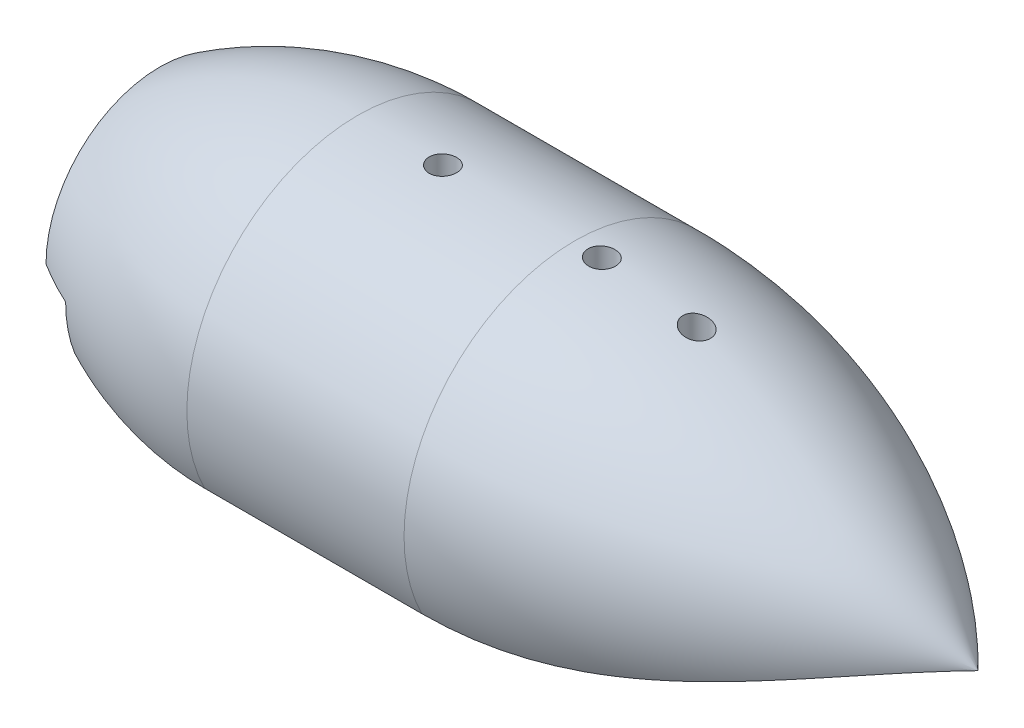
ISO-10303-21;
HEADER;
FILE_DESCRIPTION(('STEP AP214'),'2;1');
FILE_NAME('part.step','',(''),(''),'','','');
FILE_SCHEMA(('AUTOMOTIVE_DESIGN { 1 0 10303 214 1 1 1 1 }'));
ENDSEC;
DATA;
#1=APPLICATION_CONTEXT('core data for automotive mechanical design processes');
#2=APPLICATION_PROTOCOL_DEFINITION('international standard','automotive_design',2000,#1);
#3=PRODUCT_CONTEXT('',#1,'mechanical');
#4=PRODUCT('Part','Part','',(#3));
#5=PRODUCT_RELATED_PRODUCT_CATEGORY('part','',(#4));
#6=PRODUCT_DEFINITION_FORMATION('','',#4);
#7=PRODUCT_DEFINITION_CONTEXT('part definition',#1,'design');
#8=PRODUCT_DEFINITION('design','',#6,#7);
#9=PRODUCT_DEFINITION_SHAPE('','',#8);
#10=(LENGTH_UNIT() NAMED_UNIT(*) SI_UNIT(.MILLI.,.METRE.));
#11=(NAMED_UNIT(*) PLANE_ANGLE_UNIT() SI_UNIT($,.RADIAN.));
#12=(NAMED_UNIT(*) SI_UNIT($,.STERADIAN.) SOLID_ANGLE_UNIT());
#13=UNCERTAINTY_MEASURE_WITH_UNIT(LENGTH_MEASURE(1.E-05),#10,'distance_accuracy_value','');
#14=(GEOMETRIC_REPRESENTATION_CONTEXT(3) GLOBAL_UNCERTAINTY_ASSIGNED_CONTEXT((#13)) GLOBAL_UNIT_ASSIGNED_CONTEXT((#10,
#11,#12)) REPRESENTATION_CONTEXT('',''));
#15=CARTESIAN_POINT('',(0.,0.,0.));
#16=DIRECTION('',(0.,0.,1.));
#17=DIRECTION('',(1.,0.,0.));
#18=AXIS2_PLACEMENT_3D('',#15,#16,#17);
#19=CARTESIAN_POINT('',(42.3417985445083,12.954,-11.8035781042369));
#20=DIRECTION('',(-1.,0.,0.));
#21=DIRECTION('',(0.,0.,1.));
#22=AXIS2_PLACEMENT_3D('',#19,#20,#21);
#23=PLANE('',#22);
#24=CARTESIAN_POINT('',(42.3417985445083,-20.6375,0.));
#25=DIRECTION('',(-1.,0.,0.));
#26=DIRECTION('',(0.,0.,1.));
#27=AXIS2_PLACEMENT_3D('',#24,#25,#26);
#28=CIRCLE('',#27,20.6375);
#29=CARTESIAN_POINT('',(42.3417985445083,-0.24453907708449,-3.1675781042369));
#30=VERTEX_POINT('',#29);
#31=CARTESIAN_POINT('',(42.3417985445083,-2.70601499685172,-10.2160781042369));
#32=VERTEX_POINT('',#31);
#33=EDGE_CURVE('E932',#30,#32,#28,.T.);
#34=ORIENTED_EDGE('',*,*,#33,.F.);
#35=DIRECTION('',(0.,-1.,0.));
#36=VECTOR('',#35,1.);
#37=CARTESIAN_POINT('',(42.3417985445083,10.16,-3.16757810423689));
#38=LINE('',#37,#36);
#39=CARTESIAN_POINT('',(42.3417985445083,10.16,-3.16757810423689));
#40=VERTEX_POINT('',#39);
#41=EDGE_CURVE('E888',#40,#30,#38,.T.);
#42=ORIENTED_EDGE('',*,*,#41,.F.);
#43=DIRECTION('',(0.,-1.,0.));
#44=VECTOR('',#43,1.);
#45=CARTESIAN_POINT('',(42.3417985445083,29.9803841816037,-3.1675781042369));
#46=LINE('',#45,#44);
#47=CARTESIAN_POINT('',(42.3417985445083,12.954,-3.1675781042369));
#48=VERTEX_POINT('',#47);
#49=EDGE_CURVE('E1038',#48,#40,#46,.T.);
#50=ORIENTED_EDGE('',*,*,#49,.F.);
#51=DIRECTION('',(0.,0.,-1.));
#52=VECTOR('',#51,1.);
#53=CARTESIAN_POINT('',(42.3417985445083,12.954,-11.8035781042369));
#54=LINE('',#53,#52);
#55=CARTESIAN_POINT('',(42.3417985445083,12.954,-10.2160781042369));
#56=VERTEX_POINT('',#55);
#57=EDGE_CURVE('E915',#48,#56,#54,.T.);
#58=ORIENTED_EDGE('',*,*,#57,.T.);
#59=DIRECTION('',(0.,-1.,0.));
#60=VECTOR('',#59,1.);
#61=CARTESIAN_POINT('',(42.3417985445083,-8.10299076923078,-10.2160781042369));
#62=LINE('',#61,#60);
#63=EDGE_CURVE('E405',#56,#32,#62,.T.);
#64=ORIENTED_EDGE('',*,*,#63,.T.);
#65=EDGE_LOOP('',(#34,#42,#50,#58,#64));
#66=FACE_BOUND('',#65,.T.);
#67=ADVANCED_FACE('F33',(#66),#23,.T.);
#68=CARTESIAN_POINT('',(42.3417985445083,-20.6375,0.));
#69=DIRECTION('',(-1.,0.,0.));
#70=DIRECTION('',(0.,0.,1.));
#71=AXIS2_PLACEMENT_3D('',#68,#69,#70);
#72=CIRCLE('',#71,20.6375);
#73=CARTESIAN_POINT('',(42.3417985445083,-2.71448006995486,10.2309218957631));
#74=VERTEX_POINT('',#73);
#75=CARTESIAN_POINT('',(42.3417985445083,-0.246850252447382,3.1824218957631));
#76=VERTEX_POINT('',#75);
#77=EDGE_CURVE('E944',#74,#76,#72,.T.);
#78=ORIENTED_EDGE('',*,*,#77,.F.);
#79=DIRECTION('',(0.,-1.,0.));
#80=VECTOR('',#79,1.);
#81=CARTESIAN_POINT('',(42.3417985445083,12.954,10.2309218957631));
#82=LINE('',#81,#80);
#83=CARTESIAN_POINT('',(42.3417985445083,12.954,10.2309218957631));
#84=VERTEX_POINT('',#83);
#85=EDGE_CURVE('E403',#74,#84,#82,.F.);
#86=ORIENTED_EDGE('',*,*,#85,.T.);
#87=CARTESIAN_POINT('',(42.3417985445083,12.954,3.18242189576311));
#88=VERTEX_POINT('',#87);
#89=EDGE_CURVE('E916',#84,#88,#54,.T.);
#90=ORIENTED_EDGE('',*,*,#89,.T.);
#91=DIRECTION('',(0.,-1.,0.));
#92=VECTOR('',#91,1.);
#93=CARTESIAN_POINT('',(42.3417985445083,29.9803841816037,3.18242189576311));
#94=LINE('',#93,#92);
#95=CARTESIAN_POINT('',(42.3417985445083,10.16,3.1824218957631));
#96=VERTEX_POINT('',#95);
#97=EDGE_CURVE('E1044',#96,#88,#94,.F.);
#98=ORIENTED_EDGE('',*,*,#97,.F.);
#99=DIRECTION('',(0.,-1.,0.));
#100=VECTOR('',#99,1.);
#101=CARTESIAN_POINT('',(42.3417985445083,10.16,3.1824218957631));
#102=LINE('',#101,#100);
#103=EDGE_CURVE('E885',#96,#76,#102,.T.);
#104=ORIENTED_EDGE('',*,*,#103,.T.);
#105=EDGE_LOOP('',(#78,#86,#90,#98,#104));
#106=FACE_BOUND('',#105,.T.);
#107=ADVANCED_FACE('F761',(#106),#23,.T.);
#108=CARTESIAN_POINT('',(24.13,0.,0.));
#109=DIRECTION('',(-1.,0.,0.));
#110=DIRECTION('',(0.,0.,1.));
#111=AXIS2_PLACEMENT_3D('',#108,#109,#110);
#112=CYLINDRICAL_SURFACE('',#111,7.9375);
#113=CARTESIAN_POINT('',(10.9132781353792,0.,0.));
#114=DIRECTION('',(1.,0.,0.));
#115=DIRECTION('',(0.,0.,-1.));
#116=AXIS2_PLACEMENT_3D('',#113,#114,#115);
#117=CIRCLE('',#116,7.9375);
#118=CARTESIAN_POINT('',(10.9132781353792,0.,-7.9375));
#119=VERTEX_POINT('',#118);
#120=CARTESIAN_POINT('',(10.9132781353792,-1.00201309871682,-7.874));
#121=VERTEX_POINT('',#120);
#122=EDGE_CURVE('E480',#119,#121,#117,.F.);
#123=ORIENTED_EDGE('',*,*,#122,.T.);
#124=DIRECTION('',(-1.,0.,0.));
#125=VECTOR('',#124,1.);
#126=CARTESIAN_POINT('',(24.13,-1.00201309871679,-7.874));
#127=LINE('',#126,#125);
#128=CARTESIAN_POINT('',(18.9229985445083,-1.00201309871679,-7.874));
#129=VERTEX_POINT('',#128);
#130=EDGE_CURVE('E874',#121,#129,#127,.F.);
#131=ORIENTED_EDGE('',*,*,#130,.T.);
#132=CARTESIAN_POINT('',(18.9229985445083,0.,0.));
#133=DIRECTION('',(1.,0.,0.));
#134=DIRECTION('',(0.,0.,-1.));
#135=AXIS2_PLACEMENT_3D('',#132,#133,#134);
#136=CIRCLE('',#135,7.9375);
#137=CARTESIAN_POINT('',(18.9229985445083,1.00201309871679,-7.874));
#138=VERTEX_POINT('',#137);
#139=EDGE_CURVE('E841',#138,#129,#136,.F.);
#140=ORIENTED_EDGE('',*,*,#139,.F.);
#141=DIRECTION('',(-1.,0.,0.));
#142=VECTOR('',#141,1.);
#143=CARTESIAN_POINT('',(24.13,1.00201309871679,-7.874));
#144=LINE('',#143,#142);
#145=CARTESIAN_POINT('',(16.5099985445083,1.00201309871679,-7.874));
#146=VERTEX_POINT('',#145);
#147=EDGE_CURVE('E1349',#138,#146,#144,.T.);
#148=ORIENTED_EDGE('',*,*,#147,.T.);
#149=CARTESIAN_POINT('',(16.5099985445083,1.00201309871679,-7.874));
#150=CARTESIAN_POINT('',(16.4805623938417,1.0018736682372,-7.87401307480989));
#151=CARTESIAN_POINT('',(16.451390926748,1.0052282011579,-7.87359153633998));
#152=CARTESIAN_POINT('',(16.3948993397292,1.01738307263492,-7.87203223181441));
#153=CARTESIAN_POINT('',(16.3675518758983,1.02605419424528,-7.87091144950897));
#154=CARTESIAN_POINT('',(16.30293734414,1.0521291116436,-7.867474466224));
#155=CARTESIAN_POINT('',(16.2666031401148,1.07169678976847,-7.86484921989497));
#156=CARTESIAN_POINT('',(16.1967752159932,1.11585203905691,-7.8587081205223));
#157=CARTESIAN_POINT('',(16.1633221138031,1.14049861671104,-7.85518166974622));
#158=CARTESIAN_POINT('',(16.074983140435,1.21191107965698,-7.84456834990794));
#159=CARTESIAN_POINT('',(16.0225546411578,1.26154945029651,-7.83677777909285));
#160=CARTESIAN_POINT('',(15.9219246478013,1.3647198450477,-7.8194776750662));
#161=CARTESIAN_POINT('',(15.8737356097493,1.41826254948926,-7.80996331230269));
#162=CARTESIAN_POINT('',(15.7800189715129,1.52759368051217,-7.78931731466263));
#163=CARTESIAN_POINT('',(15.7344992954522,1.58338803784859,-7.7781811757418));
#164=CARTESIAN_POINT('',(15.6454872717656,1.69610975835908,-7.75438201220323));
#165=CARTESIAN_POINT('',(15.6019923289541,1.75303552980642,-7.74172102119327));
#166=CARTESIAN_POINT('',(15.4874008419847,1.90655157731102,-7.70575882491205));
#167=CARTESIAN_POINT('',(15.4176308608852,2.00381087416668,-7.68107329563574));
#168=CARTESIAN_POINT('',(15.2810463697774,2.19922926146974,-7.62742364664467));
#169=CARTESIAN_POINT('',(15.2142326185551,2.29738857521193,-7.59845843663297));
#170=CARTESIAN_POINT('',(15.0173110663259,2.59254800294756,-7.50501065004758));
#171=CARTESIAN_POINT('',(14.8908863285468,2.79000316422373,-7.43402801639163));
#172=CARTESIAN_POINT('',(14.6474919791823,3.18304104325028,-7.27441743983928));
#173=CARTESIAN_POINT('',(14.5305060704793,3.37862645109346,-7.18582086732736));
#174=CARTESIAN_POINT('',(14.3071545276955,3.76650188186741,-6.99031281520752));
#175=CARTESIAN_POINT('',(14.2007789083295,3.95879485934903,-6.88341881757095));
#176=CARTESIAN_POINT('',(14.035605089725,4.27266997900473,-6.69099032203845));
#177=CARTESIAN_POINT('',(13.9730995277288,4.39565070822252,-6.61090182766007));
#178=CARTESIAN_POINT('',(13.8545239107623,4.63900831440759,-6.4424717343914));
#179=CARTESIAN_POINT('',(13.7984541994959,4.75938505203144,-6.35412969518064));
#180=CARTESIAN_POINT('',(13.6419011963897,5.11478183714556,-6.07722221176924));
#181=CARTESIAN_POINT('',(13.5524138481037,5.34529622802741,-5.87603248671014));
#182=CARTESIAN_POINT('',(13.4372691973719,5.71454077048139,-5.51282211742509));
#183=CARTESIAN_POINT('',(13.4002971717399,5.85850664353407,-5.35970766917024));
#184=CARTESIAN_POINT('',(13.3619395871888,6.06664060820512,-5.11967704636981));
#185=CARTESIAN_POINT('',(13.3519997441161,6.13492009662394,-5.03766363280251));
#186=CARTESIAN_POINT('',(13.3385280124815,6.26842329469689,-4.87055002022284));
#187=CARTESIAN_POINT('',(13.3350025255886,6.33364388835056,-4.78544682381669));
#188=CARTESIAN_POINT('',(13.3349985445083,6.39713258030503,-4.699));
#189=B_SPLINE_CURVE_WITH_KNOTS('',3,(#149,#150,#151,#152,#153,#154,#155,#156,#157,#158,#159,
#160,#161,#162,#163,#164,#165,#166,#167,#168,#169,#170,#171,#172,#173,#174,#175,#176,#177,#178,
#179,#180,#181,#182,#183,#184,#185,#186,#187,#188),.UNSPECIFIED.,.F.,.F.,(4,2,2,2,2,2,2,2,2,2,2,
2,2,2,2,2,2,2,2,4),(0.,0.0876972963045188,0.173343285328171,0.296691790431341,0.421563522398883,
0.638834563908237,0.856724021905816,1.07523057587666,1.29344888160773,1.65994206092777,
2.02652877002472,2.76055177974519,3.4932790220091,4.22531006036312,4.7035100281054,
5.18173552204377,6.13348655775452,6.77194976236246,7.09322556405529,7.41482183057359),.UNSPECIFIED.);
#190=CARTESIAN_POINT('',(13.3349985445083,6.39713258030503,-4.699));
#191=VERTEX_POINT('',#190);
#192=EDGE_CURVE('E504',#146,#191,#189,.T.);
#193=ORIENTED_EDGE('',*,*,#192,.T.);
#194=CARTESIAN_POINT('',(13.3349985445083,0.,0.));
#195=DIRECTION('',(1.,0.,0.));
#196=DIRECTION('',(0.,0.,-1.));
#197=AXIS2_PLACEMENT_3D('',#194,#195,#196);
#198=CIRCLE('',#197,7.9375);
#199=CARTESIAN_POINT('',(13.3349985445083,7.874,-1.00201309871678));
#200=VERTEX_POINT('',#199);
#201=EDGE_CURVE('E469',#200,#191,#198,.F.);
#202=ORIENTED_EDGE('',*,*,#201,.F.);
#203=DIRECTION('',(-1.,0.,0.));
#204=VECTOR('',#203,1.);
#205=CARTESIAN_POINT('',(24.13,7.874,-1.00201309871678));
#206=LINE('',#205,#204);
#207=CARTESIAN_POINT('',(18.9229985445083,7.874,-1.00201309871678));
#208=VERTEX_POINT('',#207);
#209=EDGE_CURVE('E867',#200,#208,#206,.F.);
#210=ORIENTED_EDGE('',*,*,#209,.T.);
#211=CARTESIAN_POINT('',(18.9229985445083,7.874,1.00201309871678));
#212=VERTEX_POINT('',#211);
#213=EDGE_CURVE('E844',#212,#208,#136,.F.);
#214=ORIENTED_EDGE('',*,*,#213,.F.);
#215=DIRECTION('',(-1.,0.,0.));
#216=VECTOR('',#215,1.);
#217=CARTESIAN_POINT('',(24.13,7.874,1.00201309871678));
#218=LINE('',#217,#216);
#219=CARTESIAN_POINT('',(13.3349985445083,7.874,1.00201309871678));
#220=VERTEX_POINT('',#219);
#221=EDGE_CURVE('E864',#212,#220,#218,.T.);
#222=ORIENTED_EDGE('',*,*,#221,.T.);
#223=CARTESIAN_POINT('',(13.3349985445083,6.39713258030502,4.699));
#224=VERTEX_POINT('',#223);
#225=EDGE_CURVE('E472',#224,#220,#198,.F.);
#226=ORIENTED_EDGE('',*,*,#225,.F.);
#227=CARTESIAN_POINT('',(13.3349985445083,6.39713258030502,4.699));
#228=CARTESIAN_POINT('',(13.3350089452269,6.31655620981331,4.80873725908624));
#229=CARTESIAN_POINT('',(13.3406846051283,6.2331812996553,4.91628571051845));
#230=CARTESIAN_POINT('',(13.3621034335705,6.06169493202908,5.1262062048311));
#231=CARTESIAN_POINT('',(13.3778294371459,5.97359178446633,5.22858675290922));
#232=CARTESIAN_POINT('',(13.4178047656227,5.79452782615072,5.42631768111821));
#233=CARTESIAN_POINT('',(13.4419281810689,5.70362638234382,5.52174802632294));
#234=CARTESIAN_POINT('',(13.4976803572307,5.51833678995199,5.7069281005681));
#235=CARTESIAN_POINT('',(13.5293131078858,5.42394681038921,5.79667477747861));
#236=CARTESIAN_POINT('',(13.6130043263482,5.19410732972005,6.00481628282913));
#237=CARTESIAN_POINT('',(13.6681834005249,5.05725406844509,6.12041420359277));
#238=CARTESIAN_POINT('',(13.7891030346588,4.77901553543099,6.34006031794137));
#239=CARTESIAN_POINT('',(13.8548478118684,4.63762847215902,6.444103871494));
#240=CARTESIAN_POINT('',(13.995848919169,4.34980924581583,6.64182718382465));
#241=CARTESIAN_POINT('',(14.0711993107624,4.20333933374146,6.7353844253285));
#242=CARTESIAN_POINT('',(14.2293454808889,3.90777721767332,6.91105882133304));
#243=CARTESIAN_POINT('',(14.3121369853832,3.75868655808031,6.99318247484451));
#244=CARTESIAN_POINT('',(14.5085530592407,3.41587750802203,7.16815689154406));
#245=CARTESIAN_POINT('',(14.6242564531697,3.2215102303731,7.25743009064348));
#246=CARTESIAN_POINT('',(14.8048385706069,2.92860703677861,7.37823641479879));
#247=CARTESIAN_POINT('',(14.8662972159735,2.83060539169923,7.41636662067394));
#248=CARTESIAN_POINT('',(14.9915123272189,2.63449934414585,7.488272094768));
#249=CARTESIAN_POINT('',(15.0552681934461,2.53639497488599,7.52204848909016));
#250=CARTESIAN_POINT('',(15.1844568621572,2.34155782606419,7.58494336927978));
#251=CARTESIAN_POINT('',(15.2498614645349,2.24482238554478,7.61411154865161));
#252=CARTESIAN_POINT('',(15.383514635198,2.05202487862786,7.66832047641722));
#253=CARTESIAN_POINT('',(15.4517657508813,1.95596350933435,7.69335742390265));
#254=CARTESIAN_POINT('',(15.5916333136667,1.76594777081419,7.73917321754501));
#255=CARTESIAN_POINT('',(15.6632326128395,1.67198567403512,7.75997134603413));
#256=CARTESIAN_POINT('',(15.7750033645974,1.53405047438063,7.78799117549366));
#257=CARTESIAN_POINT('',(15.8129588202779,1.48860635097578,7.79679614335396));
#258=CARTESIAN_POINT('',(15.8909141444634,1.39931230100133,7.81331439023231));
#259=CARTESIAN_POINT('',(15.9309129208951,1.35546154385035,7.82102824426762));
#260=CARTESIAN_POINT('',(16.0043140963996,1.28028378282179,7.8336377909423));
#261=CARTESIAN_POINT('',(16.0371049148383,1.24840434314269,7.8387727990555));
#262=CARTESIAN_POINT('',(16.1052402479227,1.18714378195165,7.84828333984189));
#263=CARTESIAN_POINT('',(16.1405897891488,1.15776783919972,7.85265731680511));
#264=CARTESIAN_POINT('',(16.2067638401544,1.10937898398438,7.8596214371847));
#265=CARTESIAN_POINT('',(16.2369210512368,1.08949723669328,7.86239286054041));
#266=CARTESIAN_POINT('',(16.2997068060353,1.05434623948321,7.86718311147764));
#267=CARTESIAN_POINT('',(16.3323146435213,1.03904281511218,7.86920754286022));
#268=CARTESIAN_POINT('',(16.3891309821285,1.01933880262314,7.87178031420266));
#269=CARTESIAN_POINT('',(16.4126371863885,1.01301213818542,7.87259439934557));
#270=CARTESIAN_POINT('',(16.4607126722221,1.00427739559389,7.87371207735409));
#271=CARTESIAN_POINT('',(16.4852924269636,1.00192747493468,7.87400809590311));
#272=CARTESIAN_POINT('',(16.5099985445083,1.00201309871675,7.874));
#273=B_SPLINE_CURVE_WITH_KNOTS('',3,(#227,#228,#229,#230,#231,#232,#233,#234,#235,#236,#237,
#238,#239,#240,#241,#242,#243,#244,#245,#246,#247,#248,#249,#250,#251,#252,#253,#254,#255,#256,
#257,#258,#259,#260,#261,#262,#263,#264,#265,#266,#267,#268,#269,#270,#271,#272),.UNSPECIFIED.,
.F.,.F.,(4,2,2,2,2,2,2,2,2,2,2,2,2,2,2,2,2,2,2,2,2,2,4),(0.,0.408109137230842,0.815523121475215,
1.21707430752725,1.61883932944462,2.18034368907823,2.74207272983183,3.3097994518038,
3.87720214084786,4.60575189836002,4.97107870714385,5.33631083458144,5.69728677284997,
6.05859299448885,6.41821703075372,6.59775998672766,6.7772079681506,6.91518883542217,
7.05344853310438,7.16190292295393,7.26952631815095,7.34227431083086,7.41607728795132),.UNSPECIFIED.);
#274=CARTESIAN_POINT('',(16.5099985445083,1.00201309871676,7.874));
#275=VERTEX_POINT('',#274);
#276=EDGE_CURVE('E497',#224,#275,#273,.T.);
#277=ORIENTED_EDGE('',*,*,#276,.T.);
#278=DIRECTION('',(-1.,0.,0.));
#279=VECTOR('',#278,1.);
#280=CARTESIAN_POINT('',(24.13,1.00201309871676,7.874));
#281=LINE('',#280,#279);
#282=CARTESIAN_POINT('',(18.9229985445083,1.00201309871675,7.874));
#283=VERTEX_POINT('',#282);
#284=EDGE_CURVE('E872',#275,#283,#281,.F.);
#285=ORIENTED_EDGE('',*,*,#284,.T.);
#286=CARTESIAN_POINT('',(18.9229985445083,-1.00201309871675,7.874));
#287=VERTEX_POINT('',#286);
#288=EDGE_CURVE('E845',#287,#283,#136,.F.);
#289=ORIENTED_EDGE('',*,*,#288,.F.);
#290=DIRECTION('',(-1.,0.,0.));
#291=VECTOR('',#290,1.);
#292=CARTESIAN_POINT('',(24.13,-1.00201309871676,7.874));
#293=LINE('',#292,#291);
#294=CARTESIAN_POINT('',(10.9132781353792,-1.00201309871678,7.874));
#295=VERTEX_POINT('',#294);
#296=EDGE_CURVE('E869',#287,#295,#293,.T.);
#297=ORIENTED_EDGE('',*,*,#296,.T.);
#298=CARTESIAN_POINT('',(10.9132781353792,0.,0.));
#299=DIRECTION('',(1.,0.,0.));
#300=DIRECTION('',(0.,0.,-1.));
#301=AXIS2_PLACEMENT_3D('',#298,#299,#300);
#302=CIRCLE('',#301,7.9375);
#303=CARTESIAN_POINT('',(10.9132781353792,0.,7.9375));
#304=VERTEX_POINT('',#303);
#305=EDGE_CURVE('E477',#295,#304,#302,.F.);
#306=ORIENTED_EDGE('',*,*,#305,.T.);
#307=DIRECTION('',(-1.,0.,0.));
#308=VECTOR('',#307,1.);
#309=CARTESIAN_POINT('',(24.13,0.,7.9375));
#310=LINE('',#309,#308);
#311=CARTESIAN_POINT('',(0.,0.,7.9375));
#312=VERTEX_POINT('',#311);
#313=EDGE_CURVE('E1328',#304,#312,#310,.T.);
#314=ORIENTED_EDGE('',*,*,#313,.T.);
#315=CARTESIAN_POINT('',(0.,0.,0.));
#316=DIRECTION('',(-1.,0.,0.));
#317=DIRECTION('',(0.,0.,1.));
#318=AXIS2_PLACEMENT_3D('',#315,#316,#317);
#319=CIRCLE('',#318,7.9375);
#320=CARTESIAN_POINT('',(0.,0.,-7.9375));
#321=VERTEX_POINT('',#320);
#322=EDGE_CURVE('E389',#312,#321,#319,.T.);
#323=ORIENTED_EDGE('',*,*,#322,.T.);
#324=DIRECTION('',(-1.,0.,0.));
#325=VECTOR('',#324,1.);
#326=CARTESIAN_POINT('',(24.13,0.,-7.9375));
#327=LINE('',#326,#325);
#328=EDGE_CURVE('E1330',#321,#119,#327,.F.);
#329=ORIENTED_EDGE('',*,*,#328,.T.);
#330=EDGE_LOOP('',(#123,#131,#140,#148,#193,#202,#210,#214,#222,#226,#277,#285,#289,#297,#306,
#314,#323,#329));
#331=FACE_BOUND('',#330,.T.);
#332=ADVANCED_FACE('F510',(#331),#112,.F.);
#333=CARTESIAN_POINT('',(87.63,0.,0.));
#334=DIRECTION('',(-1.,0.,0.));
#335=DIRECTION('',(0.,0.,1.));
#336=AXIS2_PLACEMENT_3D('',#333,#334,#335);
#337=CYLINDRICAL_SURFACE('',#336,18.288);
#338=CARTESIAN_POINT('',(28.8671172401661,18.288,0.));
#339=CARTESIAN_POINT('',(28.8675370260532,18.2879992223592,-0.082606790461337));
#340=CARTESIAN_POINT('',(28.8749213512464,18.2874343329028,-0.165234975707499));
#341=CARTESIAN_POINT('',(28.9034367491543,18.2852379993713,-0.328135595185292));
#342=CARTESIAN_POINT('',(28.9245834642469,18.2836053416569,-0.408405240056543));
#343=CARTESIAN_POINT('',(28.9800086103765,18.2794607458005,-0.564206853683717));
#344=CARTESIAN_POINT('',(29.0142796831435,18.2769493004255,-0.639741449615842));
#345=CARTESIAN_POINT('',(29.0949680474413,18.2713314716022,-0.783968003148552));
#346=CARTESIAN_POINT('',(29.1413827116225,18.2682252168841,-0.852661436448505));
#347=CARTESIAN_POINT('',(29.2451607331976,18.2617604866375,-0.9814379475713));
#348=CARTESIAN_POINT('',(29.3025470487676,18.2584014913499,-1.04150249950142));
#349=CARTESIAN_POINT('',(29.4265899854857,18.2518164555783,-1.15115832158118));
#350=CARTESIAN_POINT('',(29.493247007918,18.2485904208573,-1.20074913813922));
#351=CARTESIAN_POINT('',(29.6340473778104,18.2426326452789,-1.28810906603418));
#352=CARTESIAN_POINT('',(29.7082004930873,18.2399015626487,-1.32586248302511));
#353=CARTESIAN_POINT('',(29.8618188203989,18.235250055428,-1.38837598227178));
#354=CARTESIAN_POINT('',(29.9412839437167,18.2333296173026,-1.41313628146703));
#355=CARTESIAN_POINT('',(30.1030854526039,18.2305220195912,-1.44890840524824));
#356=CARTESIAN_POINT('',(30.185415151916,18.2296326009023,-1.4599502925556));
#357=CARTESIAN_POINT('',(30.350763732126,18.2289809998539,-1.46806444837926));
#358=CARTESIAN_POINT('',(30.4337826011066,18.2292187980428,-1.46513695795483));
#359=CARTESIAN_POINT('',(30.5979530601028,18.2307925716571,-1.44542088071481));
#360=CARTESIAN_POINT('',(30.6791084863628,18.2321260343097,-1.42866400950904));
#361=CARTESIAN_POINT('',(30.8374513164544,18.2357364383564,-1.38181329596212));
#362=CARTESIAN_POINT('',(30.9146386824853,18.2380133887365,-1.35171932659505));
#363=CARTESIAN_POINT('',(31.0629613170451,18.2432563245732,-1.27900986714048));
#364=CARTESIAN_POINT('',(31.1340891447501,18.2462231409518,-1.23637926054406));
#365=CARTESIAN_POINT('',(31.2681920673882,18.2525092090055,-1.13981788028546));
#366=CARTESIAN_POINT('',(31.3311670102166,18.255828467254,-1.08588689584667));
#367=CARTESIAN_POINT('',(31.4473617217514,18.2624548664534,-0.968074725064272));
#368=CARTESIAN_POINT('',(31.5005535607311,18.2657619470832,-0.904165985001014));
#369=CARTESIAN_POINT('',(31.5954574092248,18.2719801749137,-0.768310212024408));
#370=CARTESIAN_POINT('',(31.6371694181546,18.2748913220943,-0.696363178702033));
#371=CARTESIAN_POINT('',(31.7079243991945,18.2799874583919,-0.546461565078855));
#372=CARTESIAN_POINT('',(31.7369671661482,18.2821724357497,-0.468506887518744));
#373=CARTESIAN_POINT('',(31.7815446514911,18.2855668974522,-0.308806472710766));
#374=CARTESIAN_POINT('',(31.7970796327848,18.2867764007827,-0.227060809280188));
#375=CARTESIAN_POINT('',(31.8141668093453,18.2880786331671,-0.0623442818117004));
#376=CARTESIAN_POINT('',(31.8157580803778,18.2881744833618,0.0206225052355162));
#377=CARTESIAN_POINT('',(31.8050143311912,18.2872439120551,0.185642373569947));
#378=CARTESIAN_POINT('',(31.7926794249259,18.2862174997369,0.267695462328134));
#379=CARTESIAN_POINT('',(31.7544650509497,18.2831569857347,0.428455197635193));
#380=CARTESIAN_POINT('',(31.728602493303,18.281124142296,0.507165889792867));
#381=CARTESIAN_POINT('',(31.6640841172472,18.276276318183,0.659130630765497));
#382=CARTESIAN_POINT('',(31.625428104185,18.2734613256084,0.73238459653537));
#383=CARTESIAN_POINT('',(31.5363181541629,18.2673543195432,0.87153810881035));
#384=CARTESIAN_POINT('',(31.4858377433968,18.2640612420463,0.937420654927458));
#385=CARTESIAN_POINT('',(31.3745512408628,18.2573697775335,1.05979047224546));
#386=CARTESIAN_POINT('',(31.3137449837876,18.2539713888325,1.11627759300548));
#387=CARTESIAN_POINT('',(31.1833657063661,18.2474413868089,1.21838328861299));
#388=CARTESIAN_POINT('',(31.1137730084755,18.2443103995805,1.26397678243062));
#389=CARTESIAN_POINT('',(30.967895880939,18.2386765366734,1.34282973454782));
#390=CARTESIAN_POINT('',(30.8916115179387,18.23617365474,1.3760893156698));
#391=CARTESIAN_POINT('',(30.7346138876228,18.2320817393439,1.42928490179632));
#392=CARTESIAN_POINT('',(30.6539063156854,18.2304915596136,1.44923762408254));
#393=CARTESIAN_POINT('',(30.4902733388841,18.2284004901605,1.47530789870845));
#394=CARTESIAN_POINT('',(30.4073479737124,18.227899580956,1.48142569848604));
#395=CARTESIAN_POINT('',(30.2418870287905,18.2280436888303,1.47965118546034));
#396=CARTESIAN_POINT('',(30.159351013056,18.2286854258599,1.47179897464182));
#397=CARTESIAN_POINT('',(29.9967739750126,18.2310358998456,1.44238991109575));
#398=CARTESIAN_POINT('',(29.9167329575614,18.232744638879,1.42083303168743));
#399=CARTESIAN_POINT('',(29.7614097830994,18.2370366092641,1.36463492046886));
#400=CARTESIAN_POINT('',(29.6861276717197,18.2396198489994,1.32999356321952));
#401=CARTESIAN_POINT('',(29.5424410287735,18.2453709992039,1.24861435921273));
#402=CARTESIAN_POINT('',(29.4740363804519,18.2485388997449,1.20187671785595));
#403=CARTESIAN_POINT('',(29.3458402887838,18.255114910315,1.09747851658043));
#404=CARTESIAN_POINT('',(29.2860731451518,18.2585236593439,1.03978815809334));
#405=CARTESIAN_POINT('',(29.1770469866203,18.2651931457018,0.915176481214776));
#406=CARTESIAN_POINT('',(29.127790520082,18.2684538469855,0.848252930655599));
#407=CARTESIAN_POINT('',(29.0411239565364,18.2744675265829,0.706955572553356));
#408=CARTESIAN_POINT('',(29.0037346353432,18.2772196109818,0.632568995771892));
#409=CARTESIAN_POINT('',(28.9420246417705,18.2818979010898,0.478602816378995));
#410=CARTESIAN_POINT('',(28.917688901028,18.2838250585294,0.399029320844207));
#411=CARTESIAN_POINT('',(28.8889516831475,18.2861429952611,0.26582011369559));
#412=CARTESIAN_POINT('',(28.8805390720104,18.2868364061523,0.213020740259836));
#413=CARTESIAN_POINT('',(28.8694861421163,18.2877651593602,0.106817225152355));
#414=CARTESIAN_POINT('',(28.8668458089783,18.2880005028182,0.0534130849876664));
#415=CARTESIAN_POINT('',(28.8671172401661,18.288,0.));
#416=B_SPLINE_CURVE_WITH_KNOTS('',3,(#338,#339,#340,#341,#342,#343,#344,#345,#346,#347,#348,
#349,#350,#351,#352,#353,#354,#355,#356,#357,#358,#359,#360,#361,#362,#363,#364,#365,#366,#367,
#368,#369,#370,#371,#372,#373,#374,#375,#376,#377,#378,#379,#380,#381,#382,#383,#384,#385,#386,
#387,#388,#389,#390,#391,#392,#393,#394,#395,#396,#397,#398,#399,#400,#401,#402,#403,#404,#405,
#406,#407,#408,#409,#410,#411,#412,#413,#414,#415),.UNSPECIFIED.,.T.,.F.,(4,2,2,2,2,2,2,2,2,2,2,
2,2,2,2,2,2,2,2,2,2,2,2,2,2,2,2,2,2,2,2,2,2,2,2,2,2,2,4),(0.,0.247628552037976,
0.495539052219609,0.743310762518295,0.991028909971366,1.23927119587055,1.4875242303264,
1.73610502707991,1.98468167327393,2.23271261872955,2.48073928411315,2.72819871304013,
2.9756604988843,3.22342190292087,3.47118792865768,3.71965067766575,3.9681134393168,
4.21658022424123,4.46504217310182,4.71280761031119,4.96057102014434,5.20802545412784,
5.45548365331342,5.70350127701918,5.95152287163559,6.20011011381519,6.44869488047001,
6.69696676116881,6.94523420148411,7.19279012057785,7.44034652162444,7.68790529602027,
7.93545986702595,8.18369785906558,8.43199596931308,8.68072640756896,8.92916910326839,
9.08928472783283,9.24939995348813),.UNSPECIFIED.);
#417=CARTESIAN_POINT('',(28.8671172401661,18.288,0.));
#418=VERTEX_POINT('',#417);
#419=EDGE_CURVE('E1577',#418,#418,#416,.T.);
#420=ORIENTED_EDGE('',*,*,#419,.T.);
#421=EDGE_LOOP('',(#420));
#422=FACE_BOUND('',#421,.T.);
#423=CARTESIAN_POINT('',(44.45,0.,0.));
#424=DIRECTION('',(-1.,0.,0.));
#425=DIRECTION('',(0.,0.,1.));
#426=AXIS2_PLACEMENT_3D('',#423,#424,#425);
#427=CIRCLE('',#426,18.288);
#428=CARTESIAN_POINT('',(44.45,-8.10299076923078,16.3948920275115));
#429=VERTEX_POINT('',#428);
#430=CARTESIAN_POINT('',(44.45,-8.10299076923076,-16.3948920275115));
#431=VERTEX_POINT('',#430);
#432=EDGE_CURVE('E385',#429,#431,#427,.T.);
#433=ORIENTED_EDGE('',*,*,#432,.T.);
#434=DIRECTION('',(-1.,0.,0.));
#435=VECTOR('',#434,1.);
#436=CARTESIAN_POINT('',(87.63,-8.10299076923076,-16.3948920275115));
#437=LINE('',#436,#435);
#438=CARTESIAN_POINT('',(21.1848567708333,-8.10299076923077,-16.3948920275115));
#439=VERTEX_POINT('',#438);
#440=EDGE_CURVE('E394',#431,#439,#437,.T.);
#441=ORIENTED_EDGE('',*,*,#440,.T.);
#442=CARTESIAN_POINT('',(21.1848567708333,0.,0.));
#443=DIRECTION('',(-1.,0.,0.));
#444=DIRECTION('',(0.,0.,1.));
#445=AXIS2_PLACEMENT_3D('',#442,#443,#444);
#446=CIRCLE('',#445,18.288);
#447=CARTESIAN_POINT('',(21.1848567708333,-8.10299076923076,16.3948920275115));
#448=VERTEX_POINT('',#447);
#449=EDGE_CURVE('E391',#448,#439,#446,.T.);
#450=ORIENTED_EDGE('',*,*,#449,.F.);
#451=DIRECTION('',(-1.,0.,0.));
#452=VECTOR('',#451,1.);
#453=CARTESIAN_POINT('',(87.63,-8.10299076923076,16.3948920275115));
#454=LINE('',#453,#452);
#455=EDGE_CURVE('E847',#429,#448,#454,.T.);
#456=ORIENTED_EDGE('',*,*,#455,.F.);
#457=EDGE_LOOP('',(#433,#441,#450,#456));
#458=FACE_BOUND('',#457,.T.);
#459=ADVANCED_FACE('F35',(#422,#458),#337,.T.);
#460=CARTESIAN_POINT('',(21.1848567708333,0.,0.));
#461=DIRECTION('',(-1.,0.,0.));
#462=DIRECTION('',(0.,0.,1.));
#463=AXIS2_PLACEMENT_3D('',#460,#461,#462);
#464=DEGENERATE_TOROIDAL_SURFACE('',#463,21.5708724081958,39.8588724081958,.F.);
#465=ORIENTED_EDGE('',*,*,#449,.T.);
#466=CARTESIAN_POINT('',(21.1850567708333,-8.10299076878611,-16.3948920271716));
#467=CARTESIAN_POINT('',(20.6671886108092,-8.10303417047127,-16.3948759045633));
#468=CARTESIAN_POINT('',(20.149325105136,-8.0940532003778,-16.3880573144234));
#469=CARTESIAN_POINT('',(19.1145920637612,-8.05833935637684,-16.3606864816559));
#470=CARTESIAN_POINT('',(18.5977224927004,-8.03160712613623,-16.3401347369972));
#471=CARTESIAN_POINT('',(17.5661612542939,-7.96070384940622,-16.2851815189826));
#472=CARTESIAN_POINT('',(17.051468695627,-7.91654081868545,-16.2507864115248));
#473=CARTESIAN_POINT('',(16.0249522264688,-7.81135314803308,-16.16789644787));
#474=CARTESIAN_POINT('',(15.5131283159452,-7.75032850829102,-16.1194015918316));
#475=CARTESIAN_POINT('',(14.5048709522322,-7.61376353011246,-16.0092535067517));
#476=CARTESIAN_POINT('',(14.0083526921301,-7.5385859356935,-15.9479255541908));
#477=CARTESIAN_POINT('',(13.0196861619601,-7.3737671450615,-15.8111120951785));
#478=CARTESIAN_POINT('',(12.5275379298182,-7.28412582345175,-15.7356264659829));
#479=CARTESIAN_POINT('',(11.5483562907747,-7.09144187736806,-15.5700625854));
#480=CARTESIAN_POINT('',(11.061322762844,-6.98839957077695,-15.4799846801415));
#481=CARTESIAN_POINT('',(10.0930765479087,-6.7701344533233,-15.2847634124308));
#482=CARTESIAN_POINT('',(9.61186371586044,-6.65491194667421,-15.1796204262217));
#483=CARTESIAN_POINT('',(8.33719469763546,-6.33316764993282,-14.878456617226));
#484=CARTESIAN_POINT('',(7.54938428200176,-6.11697749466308,-14.6685711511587));
#485=CARTESIAN_POINT('',(5.99447100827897,-5.66139207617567,-14.2031177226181));
#486=CARTESIAN_POINT('',(5.22736493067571,-5.42200044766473,-13.9475569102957));
#487=CARTESIAN_POINT('',(3.70112246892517,-4.92278888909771,-13.3827878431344));
#488=CARTESIAN_POINT('',(2.94243741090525,-4.66266040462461,-13.0726257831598));
#489=CARTESIAN_POINT('',(1.82400923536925,-4.26701455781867,-12.568185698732));
#490=CARTESIAN_POINT('',(1.45438282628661,-4.1341922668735,-12.3934610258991));
#491=CARTESIAN_POINT('',(0.721930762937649,-3.8679092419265,-12.0307042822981));
#492=CARTESIAN_POINT('',(0.359105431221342,-3.73444847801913,-11.8426715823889));
#493=CARTESIAN_POINT('',(-0.000200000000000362,-3.60125509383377,-11.6478652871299));
#494=B_SPLINE_CURVE_WITH_KNOTS('',3,(#466,#467,#468,#469,#470,#471,#472,#473,#474,#475,#476,
#477,#478,#479,#480,#481,#482,#483,#484,#485,#486,#487,#488,#489,#490,#491,#492,#493),
.UNSPECIFIED.,.F.,.F.,(4,2,2,2,2,2,2,2,2,2,2,2,2,4),(0.,1.55347422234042,3.10689211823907,
4.6595964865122,6.21230083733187,7.72959787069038,9.24690805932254,10.7641822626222,
12.2814185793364,14.8098492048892,17.337884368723,19.9154975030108,21.204903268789,
22.4943700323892),.UNSPECIFIED.);
#495=CARTESIAN_POINT('',(4.572,-5.20757219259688,-13.7048799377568));
#496=VERTEX_POINT('',#495);
#497=EDGE_CURVE('E697',#439,#496,#494,.T.);
#498=ORIENTED_EDGE('',*,*,#497,.T.);
#499=CARTESIAN_POINT('',(4.572,0.,0.));
#500=DIRECTION('',(1.,0.,0.));
#501=DIRECTION('',(0.,1.,0.));
#502=AXIS2_PLACEMENT_3D('',#499,#500,#501);
#503=CIRCLE('',#502,14.6609188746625);
#504=CARTESIAN_POINT('',(4.572,0.,-14.6609188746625));
#505=VERTEX_POINT('',#504);
#506=EDGE_CURVE('E1325',#496,#505,#503,.T.);
#507=ORIENTED_EDGE('',*,*,#506,.T.);
#508=CARTESIAN_POINT('',(21.1848567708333,0.,21.5708724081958));
#509=DIRECTION('',(0.,1.,0.));
#510=DIRECTION('',(0.,0.,1.));
#511=AXIS2_PLACEMENT_3D('',#508,#509,#510);
#512=CIRCLE('',#511,39.8588724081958);
#513=CARTESIAN_POINT('',(0.,0.,-12.192));
#514=VERTEX_POINT('',#513);
#515=EDGE_CURVE('E1322',#505,#514,#512,.T.);
#516=ORIENTED_EDGE('',*,*,#515,.T.);
#517=CARTESIAN_POINT('',(0.,0.,0.));
#518=DIRECTION('',(-1.,0.,0.));
#519=DIRECTION('',(0.,0.,1.));
#520=AXIS2_PLACEMENT_3D('',#517,#518,#519);
#521=CIRCLE('',#520,12.192);
#522=CARTESIAN_POINT('',(0.,0.,12.192));
#523=VERTEX_POINT('',#522);
#524=EDGE_CURVE('E400',#523,#514,#521,.T.);
#525=ORIENTED_EDGE('',*,*,#524,.F.);
#526=CARTESIAN_POINT('',(21.1848567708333,0.,-21.5708724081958));
#527=DIRECTION('',(0.,1.,0.));
#528=DIRECTION('',(0.,0.,1.));
#529=AXIS2_PLACEMENT_3D('',#526,#527,#528);
#530=CIRCLE('',#529,39.8588724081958);
#531=CARTESIAN_POINT('',(4.572,0.,14.6609188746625));
#532=VERTEX_POINT('',#531);
#533=EDGE_CURVE('E1319',#523,#532,#530,.T.);
#534=ORIENTED_EDGE('',*,*,#533,.T.);
#535=CARTESIAN_POINT('',(4.572,-5.20757219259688,13.7048799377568));
#536=VERTEX_POINT('',#535);
#537=EDGE_CURVE('E1391',#532,#536,#503,.T.);
#538=ORIENTED_EDGE('',*,*,#537,.T.);
#539=CARTESIAN_POINT('',(-0.000199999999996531,-3.60125509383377,11.6478652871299));
#540=CARTESIAN_POINT('',(0.453051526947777,-3.76928702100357,11.8936211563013));
#541=CARTESIAN_POINT('',(0.911956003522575,-3.93774283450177,12.1286012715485));
#542=CARTESIAN_POINT('',(1.84046397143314,-4.27314456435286,12.5774725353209));
#543=CARTESIAN_POINT('',(2.31006668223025,-4.44009058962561,12.7913652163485));
#544=CARTESIAN_POINT('',(3.25944406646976,-4.77014497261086,13.1985656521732));
#545=CARTESIAN_POINT('',(3.73921903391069,-4.93325321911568,13.3918728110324));
#546=CARTESIAN_POINT('',(4.70834274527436,-5.25341667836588,13.758474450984));
#547=CARTESIAN_POINT('',(5.19769157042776,-5.41047183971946,13.9317687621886));
#548=CARTESIAN_POINT('',(6.17329840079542,-5.71269179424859,14.2549731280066));
#549=CARTESIAN_POINT('',(6.65934088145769,-5.85805312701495,14.4053502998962));
#550=CARTESIAN_POINT('',(7.6393358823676,-6.13916933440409,14.6882463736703));
#551=CARTESIAN_POINT('',(8.13328838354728,-6.27492423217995,14.8207653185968));
#552=CARTESIAN_POINT('',(9.12834018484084,-6.53507999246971,15.0685244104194));
#553=CARTESIAN_POINT('',(9.6294377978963,-6.65948348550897,15.1837685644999));
#554=CARTESIAN_POINT('',(10.6381419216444,-6.89538671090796,15.3975987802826));
#555=CARTESIAN_POINT('',(11.1457481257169,-7.00688704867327,15.4961856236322));
#556=CARTESIAN_POINT('',(12.4247685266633,-7.26828544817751,15.7230380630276));
#557=CARTESIAN_POINT('',(13.1998833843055,-7.40911808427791,15.8411296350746));
#558=CARTESIAN_POINT('',(14.7602756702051,-7.65411607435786,16.0425488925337));
#559=CARTESIAN_POINT('',(15.5455514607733,-7.75828726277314,16.1258821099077));
#560=CARTESIAN_POINT('',(16.7359646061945,-7.88553855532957,16.2264215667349));
#561=CARTESIAN_POINT('',(17.1385645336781,-7.92332771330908,16.256011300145));
#562=CARTESIAN_POINT('',(17.9451680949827,-7.98833056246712,16.3066440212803));
#563=CARTESIAN_POINT('',(18.3491717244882,-8.0155442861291,16.3276870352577));
#564=CARTESIAN_POINT('',(19.1582501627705,-8.05917841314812,16.3613271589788));
#565=CARTESIAN_POINT('',(19.5633252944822,-8.07559506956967,16.3739213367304));
#566=CARTESIAN_POINT('',(20.3739514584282,-8.09750978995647,16.3907011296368));
#567=CARTESIAN_POINT('',(20.7795024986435,-8.10300766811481,16.3948866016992));
#568=CARTESIAN_POINT('',(21.1850567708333,-8.10299076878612,16.3948920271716));
#569=B_SPLINE_CURVE_WITH_KNOTS('',3,(#539,#540,#541,#542,#543,#544,#545,#546,#547,#548,#549,
#550,#551,#552,#553,#554,#555,#556,#557,#558,#559,#560,#561,#562,#563,#564,#565,#566,#567,#568),
.UNSPECIFIED.,.F.,.F.,(4,2,2,2,2,2,2,2,2,2,2,2,2,2,4),(0.,1.626665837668,3.25321337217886,
4.87980798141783,6.50641639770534,8.09336673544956,9.68031324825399,11.2668910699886,
12.8533944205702,15.2415285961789,17.6292825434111,18.8454417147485,20.0615971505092,
21.2781744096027,22.4947723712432),.UNSPECIFIED.);
#570=EDGE_CURVE('E610',#536,#448,#569,.T.);
#571=ORIENTED_EDGE('',*,*,#570,.T.);
#572=EDGE_LOOP('',(#465,#498,#507,#516,#525,#534,#538,#571));
#573=FACE_BOUND('',#572,.T.);
#574=ADVANCED_FACE('F713',(#573),#464,.F.);
#575=CARTESIAN_POINT('',(0.,0.,0.));
#576=DIRECTION('',(1.,0.,0.));
#577=DIRECTION('',(0.,0.,-1.));
#578=AXIS2_PLACEMENT_3D('',#575,#576,#577);
#579=PLANE('',#578);
#580=ORIENTED_EDGE('',*,*,#524,.T.);
#581=DIRECTION('',(0.,0.,1.));
#582=VECTOR('',#581,1.);
#583=CARTESIAN_POINT('',(0.,0.,0.));
#584=LINE('',#583,#582);
#585=EDGE_CURVE('E476',#514,#321,#584,.T.);
#586=ORIENTED_EDGE('',*,*,#585,.T.);
#587=ORIENTED_EDGE('',*,*,#322,.F.);
#588=EDGE_CURVE('E473',#312,#523,#584,.T.);
#589=ORIENTED_EDGE('',*,*,#588,.T.);
#590=EDGE_LOOP('',(#580,#586,#587,#589));
#591=FACE_BOUND('',#590,.T.);
#592=ADVANCED_FACE('F712',(#591),#579,.F.);
#593=CARTESIAN_POINT('',(44.45,0.,0.));
#594=DIRECTION('',(-1.,0.,0.));
#595=DIRECTION('',(0.,0.,1.));
#596=AXIS2_PLACEMENT_3D('',#593,#594,#595);
#597=DEGENERATE_TOROIDAL_SURFACE('',#596,41.8524678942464,60.1404678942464,.F.);
#598=CARTESIAN_POINT('',(87.6302,-1.77798033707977E-06,0.00856657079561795));
#599=CARTESIAN_POINT('',(87.6278861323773,-2.76873256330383E-06,0.0109533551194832));
#600=CARTESIAN_POINT('',(87.6255720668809,-4.17345732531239E-06,0.0133399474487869));
#601=CARTESIAN_POINT('',(87.6140007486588,-1.32659593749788E-05,0.025271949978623));
#602=CARTESIAN_POINT('',(87.6047405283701,-2.71603699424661E-05,0.0348144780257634));
#603=CARTESIAN_POINT('',(87.5584235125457,-0.000129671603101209,0.082511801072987));
#604=CARTESIAN_POINT('',(87.5213192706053,-0.000317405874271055,0.120620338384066));
#605=CARTESIAN_POINT('',(87.3355395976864,-0.00178062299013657,0.310919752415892));
#606=CARTESIAN_POINT('',(87.1861074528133,-0.00462973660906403,0.462361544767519));
#607=CARTESIAN_POINT('',(86.7352134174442,-0.018061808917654,0.914383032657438));
#608=CARTESIAN_POINT('',(86.4313550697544,-0.0335322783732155,1.21244823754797));
#609=CARTESIAN_POINT('',(85.8174413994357,-0.0766421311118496,1.80131338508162));
#610=CARTESIAN_POINT('',(85.5073847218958,-0.104284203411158,2.09211170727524));
#611=CARTESIAN_POINT('',(84.5627208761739,-0.204757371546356,2.95785255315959));
#612=CARTESIAN_POINT('',(83.9188838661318,-0.294950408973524,3.52084982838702));
#613=CARTESIAN_POINT('',(82.6083177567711,-0.514194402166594,4.61181204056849));
#614=CARTESIAN_POINT('',(81.9415794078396,-0.643261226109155,5.139762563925));
#615=CARTESIAN_POINT('',(80.5856043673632,-0.933370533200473,6.15913936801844));
#616=CARTESIAN_POINT('',(79.8963296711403,-1.09446963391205,6.65049882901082));
#617=CARTESIAN_POINT('',(78.4977421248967,-1.44151402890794,7.59429805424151));
#618=CARTESIAN_POINT('',(77.7884291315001,-1.627459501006,8.04673753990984));
#619=CARTESIAN_POINT('',(76.4585782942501,-1.98827823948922,8.84736284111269));
#620=CARTESIAN_POINT('',(75.8406371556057,-2.16064536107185,9.20101859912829));
#621=CARTESIAN_POINT('',(74.5917838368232,-2.51454017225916,9.87984107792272));
#622=CARTESIAN_POINT('',(73.960870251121,-2.69606885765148,10.2050046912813));
#623=CARTESIAN_POINT('',(72.6865530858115,-3.06454958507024,10.8272164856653));
#624=CARTESIAN_POINT('',(72.0431443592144,-3.25150387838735,11.1242527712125));
#625=CARTESIAN_POINT('',(70.744726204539,-3.6271528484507,11.6905931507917));
#626=CARTESIAN_POINT('',(70.0897164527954,-3.81584757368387,11.959896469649));
#627=CARTESIAN_POINT('',(68.7676051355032,-4.19187279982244,12.4719215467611));
#628=CARTESIAN_POINT('',(68.1004844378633,-4.37920034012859,12.7145960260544));
#629=CARTESIAN_POINT('',(66.7559170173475,-4.74890928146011,13.173684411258));
#630=CARTESIAN_POINT('',(66.0784702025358,-4.93129063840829,13.3900980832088));
#631=CARTESIAN_POINT('',(64.7140379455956,-5.2880326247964,13.7975933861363));
#632=CARTESIAN_POINT('',(64.0270539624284,-5.46239446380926,13.9886788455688));
#633=CARTESIAN_POINT('',(62.6441610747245,-5.80029495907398,14.3465790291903));
#634=CARTESIAN_POINT('',(61.948252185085,-5.96383363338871,14.5133937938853));
#635=CARTESIAN_POINT('',(60.5699696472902,-6.27262165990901,14.8189875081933));
#636=CARTESIAN_POINT('',(59.8878447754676,-6.41828071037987,14.9584750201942));
#637=CARTESIAN_POINT('',(58.5166876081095,-6.69483378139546,15.2165780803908));
#638=CARTESIAN_POINT('',(57.8276553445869,-6.82572787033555,15.335193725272));
#639=CARTESIAN_POINT('',(56.4435460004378,-7.07081547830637,15.5524370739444));
#640=CARTESIAN_POINT('',(55.748469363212,-7.18501021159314,15.6510662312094));
#641=CARTESIAN_POINT('',(54.3531102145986,-7.39503063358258,15.8291621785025));
#642=CARTESIAN_POINT('',(53.6528277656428,-7.49085654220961,15.908629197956));
#643=CARTESIAN_POINT('',(52.2479833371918,-7.66273111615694,16.0491154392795));
#644=CARTESIAN_POINT('',(51.5434213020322,-7.73877952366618,16.1101344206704));
#645=CARTESIAN_POINT('',(50.1310449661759,-7.86997411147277,16.2143055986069));
#646=CARTESIAN_POINT('',(49.4232306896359,-7.92512044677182,16.2574579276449));
#647=CARTESIAN_POINT('',(48.0050377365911,-8.01371429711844,16.3263471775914));
#648=CARTESIAN_POINT('',(47.294657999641,-8.04715146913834,16.352075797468));
#649=CARTESIAN_POINT('',(46.2282802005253,-8.08063296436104,16.3777795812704));
#650=CARTESIAN_POINT('',(45.8726710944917,-8.08901442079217,16.3841993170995));
#651=CARTESIAN_POINT('',(45.1613111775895,-8.10019508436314,16.3927550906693));
#652=CARTESIAN_POINT('',(44.8055603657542,-8.1029942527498,16.3948910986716));
#653=CARTESIAN_POINT('',(44.4498,-8.10299076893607,16.3948920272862));
#654=B_SPLINE_CURVE_WITH_KNOTS('',3,(#598,#599,#600,#601,#602,#603,#604,#605,#606,#607,#608,
#609,#610,#611,#612,#613,#614,#615,#616,#617,#618,#619,#620,#621,#622,#623,#624,#625,#626,#627,
#628,#629,#630,#631,#632,#633,#634,#635,#636,#637,#638,#639,#640,#641,#642,#643,#644,#645,#646,
#647,#648,#649,#650,#651,#652,#653),.UNSPECIFIED.,.F.,.F.,(4,2,2,2,2,2,2,2,2,2,2,2,2,2,2,2,2,2,
2,2,2,2,2,2,2,2,2,4),(0.,0.00997278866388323,0.0498639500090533,0.209429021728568,
0.847716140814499,2.12516353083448,3.40289328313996,5.98069915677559,8.55955871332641,
11.1430176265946,13.7264950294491,15.9234229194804,18.1205901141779,20.3186824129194,
22.5168361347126,24.7188315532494,26.9208465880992,29.1225283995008,31.3242065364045,
33.4576623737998,35.5911083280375,37.7243990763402,39.8576642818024,41.9909572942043,
44.1242344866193,46.2585273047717,47.3257644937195,48.3930090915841),.UNSPECIFIED.);
#655=CARTESIAN_POINT('',(87.63,-1.8646467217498E-06,0.00877287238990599));
#656=VERTEX_POINT('',#655);
#657=EDGE_CURVE('E370',#656,#429,#654,.T.);
#658=ORIENTED_EDGE('',*,*,#657,.F.);
#659=CARTESIAN_POINT('',(87.63,0.,0.));
#660=DIRECTION('',(-1.,0.,0.));
#661=DIRECTION('',(0.,0.,1.));
#662=AXIS2_PLACEMENT_3D('',#659,#660,#661);
#663=CIRCLE('',#662,0.00877287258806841);
#664=CARTESIAN_POINT('',(87.63,-1.8646467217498E-06,-0.00877287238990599));
#665=VERTEX_POINT('',#664);
#666=EDGE_CURVE('E383',#656,#665,#663,.T.);
#667=ORIENTED_EDGE('',*,*,#666,.T.);
#668=CARTESIAN_POINT('',(44.4498,-8.10299076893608,-16.3948920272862));
#669=CARTESIAN_POINT('',(44.8325725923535,-8.10299516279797,-16.394890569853));
#670=CARTESIAN_POINT('',(45.2153332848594,-8.09975417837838,-16.3924181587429));
#671=CARTESIAN_POINT('',(45.9806780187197,-8.08681225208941,-16.3825132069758));
#672=CARTESIAN_POINT('',(46.3632620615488,-8.07711136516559,-16.3750807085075));
#673=CARTESIAN_POINT('',(47.5104491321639,-8.03836768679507,-16.3453177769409));
#674=CARTESIAN_POINT('',(48.2745678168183,-7.99968386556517,-16.3155219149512));
#675=CARTESIAN_POINT('',(49.7995702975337,-7.89729606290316,-16.2356949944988));
#676=CARTESIAN_POINT('',(50.5604557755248,-7.83360728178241,-16.1856762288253));
#677=CARTESIAN_POINT('',(52.078193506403,-7.68230121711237,-16.064825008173));
#678=CARTESIAN_POINT('',(52.835045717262,-7.59468368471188,-15.9939923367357));
#679=CARTESIAN_POINT('',(54.3454866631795,-7.39675113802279,-15.8305237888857));
#680=CARTESIAN_POINT('',(55.0990612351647,-7.28637598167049,-15.7378300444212));
#681=CARTESIAN_POINT('',(56.5997489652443,-7.04496051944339,-15.5297989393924));
#682=CARTESIAN_POINT('',(57.3468620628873,-6.91392002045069,-15.4144613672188));
#683=CARTESIAN_POINT('',(58.8336296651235,-6.63340057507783,-15.1600610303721));
#684=CARTESIAN_POINT('',(59.5732833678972,-6.48391966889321,-15.0209957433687));
#685=CARTESIAN_POINT('',(61.0440718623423,-6.16909547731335,-14.7179956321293));
#686=CARTESIAN_POINT('',(61.7752066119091,-6.00375211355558,-14.5540606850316));
#687=CARTESIAN_POINT('',(63.2495461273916,-5.65498051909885,-14.1948938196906));
#688=CARTESIAN_POINT('',(63.9924681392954,-5.47116199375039,-13.9988795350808));
#689=CARTESIAN_POINT('',(65.4674155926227,-5.09317172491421,-13.5779332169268));
#690=CARTESIAN_POINT('',(66.1994409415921,-4.89899989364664,-13.3530009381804));
#691=CARTESIAN_POINT('',(67.6518487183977,-4.50399346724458,-12.8729560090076));
#692=CARTESIAN_POINT('',(68.3722292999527,-4.30315783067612,-12.6178386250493));
#693=CARTESIAN_POINT('',(69.800399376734,-3.89885284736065,-12.0763510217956));
#694=CARTESIAN_POINT('',(70.5081890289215,-3.69538353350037,-11.7899811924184));
#695=CARTESIAN_POINT('',(71.9058044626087,-3.29139355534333,-11.1870377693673));
#696=CARTESIAN_POINT('',(72.5957172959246,-3.09086231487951,-10.8706733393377));
#697=CARTESIAN_POINT('',(73.9615506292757,-2.69582843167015,-10.2055106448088));
#698=CARTESIAN_POINT('',(74.6374706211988,-2.50132600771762,-9.85671120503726));
#699=CARTESIAN_POINT('',(75.9741596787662,-2.12311403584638,-9.12649400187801));
#700=CARTESIAN_POINT('',(76.6349355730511,-1.93939956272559,-8.74509132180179));
#701=CARTESIAN_POINT('',(77.9406830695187,-1.58758649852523,-7.94961049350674));
#702=CARTESIAN_POINT('',(78.5856569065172,-1.4194856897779,-7.53553700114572));
#703=CARTESIAN_POINT('',(79.9703902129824,-1.07635224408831,-6.59983137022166));
#704=CARTESIAN_POINT('',(80.7069928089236,-0.905251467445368,-6.07205519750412));
#705=CARTESIAN_POINT('',(82.1553346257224,-0.600232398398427,-4.97381333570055));
#706=CARTESIAN_POINT('',(82.867085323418,-0.466296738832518,-4.40336774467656));
#707=CARTESIAN_POINT('',(83.9181691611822,-0.299288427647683,-3.51504713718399));
#708=CARTESIAN_POINT('',(84.2674085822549,-0.249110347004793,-3.21196417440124));
#709=CARTESIAN_POINT('',(84.9589295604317,-0.161584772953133,-2.59615184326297));
#710=CARTESIAN_POINT('',(85.3012114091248,-0.124236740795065,-2.28342288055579));
#711=CARTESIAN_POINT('',(85.9789860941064,-0.063472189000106,-1.64851527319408));
#712=CARTESIAN_POINT('',(86.3144698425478,-0.0400732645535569,-1.32632522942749));
#713=CARTESIAN_POINT('',(86.9779958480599,-0.00840461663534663,-0.673549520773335));
#714=CARTESIAN_POINT('',(87.306036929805,-0.000137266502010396,-0.342962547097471));
#715=CARTESIAN_POINT('',(87.6302000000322,-1.77798035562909E-06,-0.00856657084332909));
#716=B_SPLINE_CURVE_WITH_KNOTS('',3,(#668,#669,#670,#671,#672,#673,#674,#675,#676,#677,#678,
#679,#680,#681,#682,#683,#684,#685,#686,#687,#688,#689,#690,#691,#692,#693,#694,#695,#696,#697,
#698,#699,#700,#701,#702,#703,#704,#705,#706,#707,#708,#709,#710,#711,#712,#713,#714,#715),
.UNSPECIFIED.,.F.,.F.,(4,2,2,2,2,2,2,2,2,2,2,2,2,2,2,2,2,2,2,2,2,2,2,4),(0.,1.14827233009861,
2.29653489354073,4.59281807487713,6.8877075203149,9.18262083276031,11.4836785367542,
13.7847577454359,16.0860817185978,18.387417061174,20.756830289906,23.1262636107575,
25.4960689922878,27.8658448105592,30.2201654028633,32.5745713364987,34.9278938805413,
37.2808816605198,40.0454991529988,42.8088225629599,44.2039375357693,45.5989939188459,
46.9958063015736,48.392837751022),.UNSPECIFIED.);
#717=EDGE_CURVE('E373',#431,#665,#716,.T.);
#718=ORIENTED_EDGE('',*,*,#717,.F.);
#719=ORIENTED_EDGE('',*,*,#432,.F.);
#720=EDGE_LOOP('',(#658,#667,#718,#719));
#721=FACE_BOUND('',#720,.T.);
#722=CARTESIAN_POINT('',(46.3377180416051,18.2278612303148,-1.05499689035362));
#723=CARTESIAN_POINT('',(46.278150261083,18.233046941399,-0.997770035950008));
#724=CARTESIAN_POINT('',(46.2233548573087,18.2380149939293,-0.935472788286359));
#725=CARTESIAN_POINT('',(46.1249185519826,18.2471763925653,-0.802485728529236));
#726=CARTESIAN_POINT('',(46.0812903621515,18.2513688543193,-0.731786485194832));
#727=CARTESIAN_POINT('',(46.0065047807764,18.2586773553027,-0.584036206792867));
#728=CARTESIAN_POINT('',(45.975344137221,18.2617936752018,-0.506986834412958));
#729=CARTESIAN_POINT('',(45.9264006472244,18.2667228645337,-0.34873210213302));
#730=CARTESIAN_POINT('',(45.9086143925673,18.2685360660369,-0.267527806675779));
#731=CARTESIAN_POINT('',(45.8869650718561,18.270721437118,-0.103541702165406));
#732=CARTESIAN_POINT('',(45.8830555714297,18.2710984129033,-0.0207660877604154));
#733=CARTESIAN_POINT('',(45.8891457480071,18.2703951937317,0.144267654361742));
#734=CARTESIAN_POINT('',(45.8991457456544,18.2693149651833,0.226525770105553));
#735=CARTESIAN_POINT('',(45.9327253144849,18.2657792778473,0.388008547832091));
#736=CARTESIAN_POINT('',(45.9562762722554,18.2633267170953,0.467239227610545));
#737=CARTESIAN_POINT('',(46.0162517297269,18.2572249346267,0.620617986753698));
#738=CARTESIAN_POINT('',(46.0526763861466,18.2535756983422,0.694766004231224));
#739=CARTESIAN_POINT('',(46.1374749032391,18.2453260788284,0.836107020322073));
#740=CARTESIAN_POINT('',(46.1858820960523,18.240723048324,0.903279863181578));
#741=CARTESIAN_POINT('',(46.2932180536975,18.2308875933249,1.02856168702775));
#742=CARTESIAN_POINT('',(46.3521470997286,18.2256551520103,1.08667042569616));
#743=CARTESIAN_POINT('',(46.4791725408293,18.2148777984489,1.19246178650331));
#744=CARTESIAN_POINT('',(46.5473109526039,18.2093315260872,1.24009382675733));
#745=CARTESIAN_POINT('',(46.6906212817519,18.1982928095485,1.32324426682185));
#746=CARTESIAN_POINT('',(46.7657933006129,18.1928003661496,1.35876249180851));
#747=CARTESIAN_POINT('',(46.9212137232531,18.1821689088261,1.41673652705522));
#748=CARTESIAN_POINT('',(47.0014720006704,18.177030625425,1.43916601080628));
#749=CARTESIAN_POINT('',(47.1646548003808,18.1673723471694,1.47019940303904));
#750=CARTESIAN_POINT('',(47.2475792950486,18.1628523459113,1.47880345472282));
#751=CARTESIAN_POINT('',(47.4135828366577,18.1546114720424,1.48191880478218));
#752=CARTESIAN_POINT('',(47.496661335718,18.1508891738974,1.47645547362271));
#753=CARTESIAN_POINT('',(47.660749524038,18.1443163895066,1.45162640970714));
#754=CARTESIAN_POINT('',(47.7417592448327,18.1414658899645,1.43226088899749));
#755=CARTESIAN_POINT('',(47.8991768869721,18.1366358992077,1.38023733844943));
#756=CARTESIAN_POINT('',(47.9755965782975,18.134654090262,1.34761513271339));
#757=CARTESIAN_POINT('',(48.121889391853,18.1314633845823,1.27000003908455));
#758=CARTESIAN_POINT('',(48.1917625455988,18.1302544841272,1.22500721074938));
#759=CARTESIAN_POINT('',(48.3229122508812,18.1284625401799,1.12397229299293));
#760=CARTESIAN_POINT('',(48.3841963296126,18.1278789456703,1.06793998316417));
#761=CARTESIAN_POINT('',(48.4965007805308,18.1271525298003,0.94638975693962));
#762=CARTESIAN_POINT('',(48.5475211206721,18.127009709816,0.880871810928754));
#763=CARTESIAN_POINT('',(48.6378778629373,18.1269740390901,0.742166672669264));
#764=CARTESIAN_POINT('',(48.6772073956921,18.1270813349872,0.668975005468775));
#765=CARTESIAN_POINT('',(48.7430269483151,18.1273750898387,0.5170299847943));
#766=CARTESIAN_POINT('',(48.7695169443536,18.12756154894,0.438276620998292));
#767=CARTESIAN_POINT('',(48.8089153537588,18.1278865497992,0.277403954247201));
#768=CARTESIAN_POINT('',(48.821817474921,18.1280250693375,0.19528311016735));
#769=CARTESIAN_POINT('',(48.8336520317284,18.1281881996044,0.0300407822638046));
#770=CARTESIAN_POINT('',(48.8325844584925,18.1282128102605,-0.0530807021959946));
#771=CARTESIAN_POINT('',(48.8165099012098,18.1281526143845,-0.217964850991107));
#772=CARTESIAN_POINT('',(48.8015028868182,18.1280678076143,-0.299727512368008));
#773=CARTESIAN_POINT('',(48.757975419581,18.1278629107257,-0.459572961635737));
#774=CARTESIAN_POINT('',(48.7294549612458,18.1277428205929,-0.537655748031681));
#775=CARTESIAN_POINT('',(48.6597092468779,18.1276009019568,-0.687926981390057));
#776=CARTESIAN_POINT('',(48.618483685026,18.127579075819,-0.760115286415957));
#777=CARTESIAN_POINT('',(48.5244983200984,18.127808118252,-0.896545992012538));
#778=CARTESIAN_POINT('',(48.4717385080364,18.1280589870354,-0.960788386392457));
#779=CARTESIAN_POINT('',(48.3561942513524,18.1290239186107,-1.07949182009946));
#780=CARTESIAN_POINT('',(48.2934115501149,18.1297379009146,-1.13395455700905));
#781=CARTESIAN_POINT('',(48.1596021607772,18.1318076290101,-1.23156512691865));
#782=CARTESIAN_POINT('',(48.0885755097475,18.1331633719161,-1.27471301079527));
#783=CARTESIAN_POINT('',(47.9403509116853,18.1366543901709,-1.34844711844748));
#784=CARTESIAN_POINT('',(47.8631569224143,18.1387891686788,-1.37904132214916));
#785=CARTESIAN_POINT('',(47.7047611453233,18.1439130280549,-1.42684627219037));
#786=CARTESIAN_POINT('',(47.6235595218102,18.1469020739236,-1.44405756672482));
#787=CARTESIAN_POINT('',(47.4594664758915,18.1537275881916,-1.46462439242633));
#788=CARTESIAN_POINT('',(47.3765752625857,18.1575639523,-1.46798162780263));
#789=CARTESIAN_POINT('',(47.211418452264,18.1659899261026,-1.46076662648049));
#790=CARTESIAN_POINT('',(47.1291530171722,18.1705797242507,-1.45019090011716));
#791=CARTESIAN_POINT('',(46.9674004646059,18.1803402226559,-1.41538523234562));
#792=CARTESIAN_POINT('',(46.8879204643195,18.185512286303,-1.39112268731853));
#793=CARTESIAN_POINT('',(46.7342417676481,18.196165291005,-1.32962949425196));
#794=CARTESIAN_POINT('',(46.6600371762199,18.2016458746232,-1.29241360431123));
#795=CARTESIAN_POINT('',(46.5442036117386,18.2106404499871,-1.22155987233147));
#796=CARTESIAN_POINT('',(46.5004101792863,18.2141572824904,-1.19139650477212));
#797=CARTESIAN_POINT('',(46.4163256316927,18.2210998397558,-1.12652037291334));
#798=CARTESIAN_POINT('',(46.3760345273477,18.2245255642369,-1.09180759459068));
#799=CARTESIAN_POINT('',(46.3377180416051,18.2278612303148,-1.05499689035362));
#800=B_SPLINE_CURVE_WITH_KNOTS('',3,(#722,#723,#724,#725,#726,#727,#728,#729,#730,#731,#732,
#733,#734,#735,#736,#737,#738,#739,#740,#741,#742,#743,#744,#745,#746,#747,#748,#749,#750,#751,
#752,#753,#754,#755,#756,#757,#758,#759,#760,#761,#762,#763,#764,#765,#766,#767,#768,#769,#770,
#771,#772,#773,#774,#775,#776,#777,#778,#779,#780,#781,#782,#783,#784,#785,#786,#787,#788,#789,
#790,#791,#792,#793,#794,#795,#796,#797,#798,#799),.UNSPECIFIED.,.T.,.F.,(4,2,2,2,2,2,2,2,2,2,2,
2,2,2,2,2,2,2,2,2,2,2,2,2,2,2,2,2,2,2,2,2,2,2,2,2,2,2,4),(0.,0.248103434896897,
0.496488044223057,0.744807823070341,0.993064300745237,1.24048927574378,1.48791995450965,
1.73483008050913,1.98174321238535,2.22935106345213,2.47696553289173,2.72575045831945,
2.97453897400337,3.22382618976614,3.47311082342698,3.72194618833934,3.97077775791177,
4.21894132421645,4.46710369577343,4.71504720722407,4.96299149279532,5.2110811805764,
5.45917132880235,5.70737631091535,5.95558145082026,6.20378713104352,6.45199291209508,
6.70020466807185,6.94841661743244,7.19658543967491,7.44475314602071,7.69276285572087,
7.9407624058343,8.18873144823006,8.43676260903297,8.68538711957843,8.93372928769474,
9.09331929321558,9.25290979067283),.UNSPECIFIED.);
#801=CARTESIAN_POINT('',(46.3377180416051,18.2278612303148,-1.05499689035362));
#802=VERTEX_POINT('',#801);
#803=EDGE_CURVE('E727',#802,#802,#800,.T.);
#804=ORIENTED_EDGE('',*,*,#803,.F.);
#805=EDGE_LOOP('',(#804));
#806=FACE_BOUND('',#805,.T.);
#807=CARTESIAN_POINT('',(56.5133876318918,17.032134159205,-1.06983029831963));
#808=CARTESIAN_POINT('',(56.4540100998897,17.0477947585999,-1.01443637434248));
#809=CARTESIAN_POINT('',(56.3990509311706,17.0624947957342,-0.953964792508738));
#810=CARTESIAN_POINT('',(56.2996361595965,17.0893375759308,-0.824358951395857));
#811=CARTESIAN_POINT('',(56.2551890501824,17.1014782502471,-0.755217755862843));
#812=CARTESIAN_POINT('',(56.178219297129,17.1226379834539,-0.61004038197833));
#813=CARTESIAN_POINT('',(56.1457087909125,17.1316538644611,-0.53399728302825));
#814=CARTESIAN_POINT('',(56.093812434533,17.1460892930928,-0.377247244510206));
#815=CARTESIAN_POINT('',(56.0744227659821,17.1515098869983,-0.296541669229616));
#816=CARTESIAN_POINT('',(56.0497480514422,17.1583905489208,-0.134764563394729));
#817=CARTESIAN_POINT('',(56.0441454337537,17.159939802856,-0.0537452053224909));
#818=CARTESIAN_POINT('',(56.0463165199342,17.1592568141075,0.10809500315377));
#819=CARTESIAN_POINT('',(56.0540892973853,17.1570248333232,0.188915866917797));
#820=CARTESIAN_POINT('',(56.0825286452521,17.1489524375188,0.346883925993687));
#821=CARTESIAN_POINT('',(56.1030125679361,17.1431631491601,0.424066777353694));
#822=CARTESIAN_POINT('',(56.1560203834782,17.1283038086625,0.573838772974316));
#823=CARTESIAN_POINT('',(56.1885448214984,17.1192336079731,0.646427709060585));
#824=CARTESIAN_POINT('',(56.2651420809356,17.0980814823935,0.786107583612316));
#825=CARTESIAN_POINT('',(56.3093719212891,17.0859587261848,0.853106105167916));
#826=CARTESIAN_POINT('',(56.4078124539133,17.0593025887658,0.978767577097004));
#827=CARTESIAN_POINT('',(56.46202466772,17.0447688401,1.03742925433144));
#828=CARTESIAN_POINT('',(56.580807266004,17.0133761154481,1.14678773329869));
#829=CARTESIAN_POINT('',(56.6456569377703,16.9964569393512,1.19716387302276));
#830=CARTESIAN_POINT('',(56.7825582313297,16.961340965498,1.2863598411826));
#831=CARTESIAN_POINT('',(56.8546110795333,16.9431439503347,1.32517769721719));
#832=CARTESIAN_POINT('',(57.0063007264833,16.9055566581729,1.39134024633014));
#833=CARTESIAN_POINT('',(57.0861023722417,16.8861469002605,1.41829643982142));
#834=CARTESIAN_POINT('',(57.2491328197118,16.8473388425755,1.45825391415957));
#835=CARTESIAN_POINT('',(57.3323619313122,16.8279405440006,1.4712539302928));
#836=CARTESIAN_POINT('',(57.500999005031,16.7895339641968,1.48297228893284));
#837=CARTESIAN_POINT('',(57.5864211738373,16.7705334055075,1.48151315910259));
#838=CARTESIAN_POINT('',(57.7559878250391,16.7337295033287,1.46381728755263));
#839=CARTESIAN_POINT('',(57.840132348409,16.7159261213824,1.44758102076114));
#840=CARTESIAN_POINT('',(58.00392007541,16.6821257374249,1.40086285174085));
#841=CARTESIAN_POINT('',(58.0835964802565,16.6661141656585,1.37050807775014));
#842=CARTESIAN_POINT('',(58.23681995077,16.6360640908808,1.29633135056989));
#843=CARTESIAN_POINT('',(58.3103676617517,16.6220253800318,1.25251081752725));
#844=CARTESIAN_POINT('',(58.447651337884,16.5964171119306,1.15356327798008));
#845=CARTESIAN_POINT('',(58.511552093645,16.5848043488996,1.09867609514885));
#846=CARTESIAN_POINT('',(58.6292452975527,16.563844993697,0.978596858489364));
#847=CARTESIAN_POINT('',(58.6830387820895,16.5544981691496,0.913405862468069));
#848=CARTESIAN_POINT('',(58.7779249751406,16.5382881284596,0.775869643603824));
#849=CARTESIAN_POINT('',(58.8192326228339,16.5313824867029,0.703677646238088));
#850=CARTESIAN_POINT('',(58.8891724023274,16.5198376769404,0.553227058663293));
#851=CARTESIAN_POINT('',(58.9178053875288,16.515198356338,0.474968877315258));
#852=CARTESIAN_POINT('',(58.9612508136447,16.5082215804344,0.315568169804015));
#853=CARTESIAN_POINT('',(58.9762166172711,16.5058585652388,0.234468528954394));
#854=CARTESIAN_POINT('',(58.9924244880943,16.5033348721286,0.0708762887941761));
#855=CARTESIAN_POINT('',(58.9936670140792,16.5031741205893,-0.0116162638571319));
#856=CARTESIAN_POINT('',(58.9824171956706,16.5050485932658,-0.175254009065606));
#857=CARTESIAN_POINT('',(58.9699874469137,16.5070738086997,-0.25640362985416));
#858=CARTESIAN_POINT('',(58.9318732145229,16.5133095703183,-0.415438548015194));
#859=CARTESIAN_POINT('',(58.9061888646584,16.5175200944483,-0.493323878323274));
#860=CARTESIAN_POINT('',(58.8423167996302,16.5281353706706,-0.643711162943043));
#861=CARTESIAN_POINT('',(58.8041172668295,16.5345421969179,-0.716207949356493));
#862=CARTESIAN_POINT('',(58.7163788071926,16.5495356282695,-0.85372546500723));
#863=CARTESIAN_POINT('',(58.666839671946,16.558122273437,-0.918746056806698));
#864=CARTESIAN_POINT('',(58.5575403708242,16.5774889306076,-1.03995493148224));
#865=CARTESIAN_POINT('',(58.4977144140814,16.588283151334,-1.09608159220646));
#866=CARTESIAN_POINT('',(58.3698513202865,16.6119184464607,-1.19749978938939));
#867=CARTESIAN_POINT('',(58.3018137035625,16.6247596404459,-1.24279069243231));
#868=CARTESIAN_POINT('',(58.1585308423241,16.6524902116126,-1.32194248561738));
#869=CARTESIAN_POINT('',(58.0832005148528,16.6674049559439,-1.35564039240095));
#870=CARTESIAN_POINT('',(57.9282910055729,16.6988650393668,-1.40995711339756));
#871=CARTESIAN_POINT('',(57.8487115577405,16.7154104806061,-1.43057510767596));
#872=CARTESIAN_POINT('',(57.6859516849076,16.750091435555,-1.45857929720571));
#873=CARTESIAN_POINT('',(57.6027314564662,16.7682513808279,-1.46570381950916));
#874=CARTESIAN_POINT('',(57.4364413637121,16.8054019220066,-1.46585126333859));
#875=CARTESIAN_POINT('',(57.3533715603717,16.8243927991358,-1.45886937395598));
#876=CARTESIAN_POINT('',(57.1881370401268,16.8629894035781,-1.43079415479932));
#877=CARTESIAN_POINT('',(57.1060173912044,16.8826000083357,-1.4094425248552));
#878=CARTESIAN_POINT('',(56.94662524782,16.9214136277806,-1.35296171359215));
#879=CARTESIAN_POINT('',(56.8693479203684,16.9406170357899,-1.31784653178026));
#880=CARTESIAN_POINT('',(56.7447969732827,16.9720912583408,-1.24773436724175));
#881=CARTESIAN_POINT('',(56.6956725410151,16.9846590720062,-1.21610420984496));
#882=CARTESIAN_POINT('',(56.6013942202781,17.0090294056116,-1.14714097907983));
#883=CARTESIAN_POINT('',(56.5562402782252,17.0208319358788,-1.10980798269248));
#884=CARTESIAN_POINT('',(56.5133876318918,17.032134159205,-1.06983029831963));
#885=B_SPLINE_CURVE_WITH_KNOTS('',3,(#807,#808,#809,#810,#811,#812,#813,#814,#815,#816,#817,
#818,#819,#820,#821,#822,#823,#824,#825,#826,#827,#828,#829,#830,#831,#832,#833,#834,#835,#836,
#837,#838,#839,#840,#841,#842,#843,#844,#845,#846,#847,#848,#849,#850,#851,#852,#853,#854,#855,
#856,#857,#858,#859,#860,#861,#862,#863,#864,#865,#866,#867,#868,#869,#870,#871,#872,#873,#874,
#875,#876,#877,#878,#879,#880,#881,#882,#883,#884),.UNSPECIFIED.,.T.,.F.,(4,2,2,2,2,2,2,2,2,2,2,
2,2,2,2,2,2,2,2,2,2,2,2,2,2,2,2,2,2,2,2,2,2,2,2,2,2,2,4),(0.,0.247895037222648,0.49598968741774,
0.744335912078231,0.992609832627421,1.23510911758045,1.47759160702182,1.71666803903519,
1.95575529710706,2.19822837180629,2.44073843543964,2.69112682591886,2.94155792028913,
3.19967161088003,3.45780868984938,3.71911804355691,3.98041899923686,4.23941134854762,
4.49837639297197,4.75223823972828,5.00607404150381,5.25525211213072,5.50441340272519,
5.75074315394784,5.99706467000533,6.2422631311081,6.48745911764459,6.73288730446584,
6.97832000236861,7.22538512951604,7.47246469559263,7.72288811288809,7.97332722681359,
8.22857516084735,8.48391016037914,8.74396200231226,9.0037500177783,9.18265778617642,
9.36156313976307),.UNSPECIFIED.);
#886=CARTESIAN_POINT('',(56.5133876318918,17.032134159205,-1.06983029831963));
#887=VERTEX_POINT('',#886);
#888=EDGE_CURVE('E720',#887,#887,#885,.T.);
#889=ORIENTED_EDGE('',*,*,#888,.F.);
#890=EDGE_LOOP('',(#889));
#891=FACE_BOUND('',#890,.T.);
#892=ADVANCED_FACE('F381',(#721,#806,#891),#597,.F.);
#893=CARTESIAN_POINT('',(87.63,0.,0.));
#894=DIRECTION('',(1.,0.,0.));
#895=DIRECTION('',(0.,0.,-1.));
#896=AXIS2_PLACEMENT_3D('',#893,#894,#895);
#897=PLANE('',#896);
#898=CARTESIAN_POINT('',(87.63,-20.6375,0.));
#899=DIRECTION('',(-1.,0.,0.));
#900=DIRECTION('',(0.,0.,1.));
#901=AXIS2_PLACEMENT_3D('',#898,#899,#900);
#902=CIRCLE('',#901,20.6375);
#903=EDGE_CURVE('E367',#656,#665,#902,.T.);
#904=ORIENTED_EDGE('',*,*,#903,.T.);
#905=ORIENTED_EDGE('',*,*,#666,.F.);
#906=EDGE_LOOP('',(#904,#905));
#907=FACE_BOUND('',#906,.T.);
#908=ADVANCED_FACE('F388',(#907),#897,.T.);
#909=CARTESIAN_POINT('',(18.9229985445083,12.954,-11.8035781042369));
#910=DIRECTION('',(1.,0.,0.));
#911=DIRECTION('',(0.,0.,-1.));
#912=AXIS2_PLACEMENT_3D('',#909,#910,#911);
#913=PLANE('',#912);
#914=CARTESIAN_POINT('',(18.9229985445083,-20.6375,0.));
#915=DIRECTION('',(1.,0.,0.));
#916=DIRECTION('',(0.,0.,-1.));
#917=AXIS2_PLACEMENT_3D('',#914,#915,#916);
#918=CIRCLE('',#917,20.6375);
#919=CARTESIAN_POINT('',(18.9229985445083,-2.70601499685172,-10.2160781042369));
#920=VERTEX_POINT('',#919);
#921=CARTESIAN_POINT('',(18.9229985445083,-1.56116570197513,-7.874));
#922=VERTEX_POINT('',#921);
#923=EDGE_CURVE('E983',#920,#922,#918,.T.);
#924=ORIENTED_EDGE('',*,*,#923,.F.);
#925=DIRECTION('',(0.,-1.,0.));
#926=VECTOR('',#925,1.);
#927=CARTESIAN_POINT('',(18.9229985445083,12.954,-10.2160781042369));
#928=LINE('',#927,#926);
#929=CARTESIAN_POINT('',(18.9229985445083,12.954,-10.2160781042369));
#930=VERTEX_POINT('',#929);
#931=EDGE_CURVE('E443',#920,#930,#928,.F.);
#932=ORIENTED_EDGE('',*,*,#931,.T.);
#933=DIRECTION('',(0.,0.,1.));
#934=VECTOR('',#933,1.);
#935=CARTESIAN_POINT('',(18.9229985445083,12.954,-11.8035781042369));
#936=LINE('',#935,#934);
#937=CARTESIAN_POINT('',(18.9229985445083,12.954,10.2309218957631));
#938=VERTEX_POINT('',#937);
#939=EDGE_CURVE('E899',#930,#938,#936,.T.);
#940=ORIENTED_EDGE('',*,*,#939,.T.);
#941=DIRECTION('',(0.,-1.,0.));
#942=VECTOR('',#941,1.);
#943=CARTESIAN_POINT('',(18.9229985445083,-8.10299076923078,10.2309218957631));
#944=LINE('',#943,#942);
#945=CARTESIAN_POINT('',(18.9229985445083,-2.71448006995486,10.2309218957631));
#946=VERTEX_POINT('',#945);
#947=EDGE_CURVE('E440',#938,#946,#944,.T.);
#948=ORIENTED_EDGE('',*,*,#947,.T.);
#949=CARTESIAN_POINT('',(18.9229985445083,-1.56116570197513,7.87399999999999));
#950=VERTEX_POINT('',#949);
#951=EDGE_CURVE('E998',#950,#946,#918,.T.);
#952=ORIENTED_EDGE('',*,*,#951,.F.);
#953=DIRECTION('',(0.,-1.,0.));
#954=VECTOR('',#953,1.);
#955=CARTESIAN_POINT('',(18.9229985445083,12.954,7.874));
#956=LINE('',#955,#954);
#957=EDGE_CURVE('E460',#287,#950,#956,.T.);
#958=ORIENTED_EDGE('',*,*,#957,.F.);
#959=ORIENTED_EDGE('',*,*,#288,.T.);
#960=DIRECTION('',(0.,-1.,0.));
#961=VECTOR('',#960,1.);
#962=CARTESIAN_POINT('',(18.9229985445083,7.874,7.874));
#963=LINE('',#962,#961);
#964=CARTESIAN_POINT('',(18.9229985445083,7.874,7.874));
#965=VERTEX_POINT('',#964);
#966=EDGE_CURVE('E1337',#965,#283,#963,.T.);
#967=ORIENTED_EDGE('',*,*,#966,.F.);
#968=DIRECTION('',(0.,0.,1.));
#969=VECTOR('',#968,1.);
#970=CARTESIAN_POINT('',(18.9229985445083,7.874,-11.8035781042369));
#971=LINE('',#970,#969);
#972=EDGE_CURVE('E464',#212,#965,#971,.T.);
#973=ORIENTED_EDGE('',*,*,#972,.F.);
#974=ORIENTED_EDGE('',*,*,#213,.T.);
#975=DIRECTION('',(0.,0.,1.));
#976=VECTOR('',#975,1.);
#977=CARTESIAN_POINT('',(18.9229985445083,7.874,7.874));
#978=LINE('',#977,#976);
#979=CARTESIAN_POINT('',(18.9229985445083,7.874,-7.874));
#980=VERTEX_POINT('',#979);
#981=EDGE_CURVE('E859',#980,#208,#978,.T.);
#982=ORIENTED_EDGE('',*,*,#981,.F.);
#983=DIRECTION('',(0.,1.,0.));
#984=VECTOR('',#983,1.);
#985=CARTESIAN_POINT('',(18.9229985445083,12.954,-7.874));
#986=LINE('',#985,#984);
#987=EDGE_CURVE('E461',#138,#980,#986,.T.);
#988=ORIENTED_EDGE('',*,*,#987,.F.);
#989=ORIENTED_EDGE('',*,*,#139,.T.);
#990=DIRECTION('',(0.,1.,0.));
#991=VECTOR('',#990,1.);
#992=CARTESIAN_POINT('',(18.9229985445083,7.874,-7.874));
#993=LINE('',#992,#991);
#994=EDGE_CURVE('E1340',#922,#129,#993,.T.);
#995=ORIENTED_EDGE('',*,*,#994,.F.);
#996=EDGE_LOOP('',(#924,#932,#940,#948,#952,#958,#959,#967,#973,#974,#982,#988,#989,#995));
#997=FACE_BOUND('',#996,.T.);
#998=ADVANCED_FACE('F794',(#997),#913,.T.);
#999=CARTESIAN_POINT('',(26.2127985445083,12.954,-3.29457810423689));
#1000=DIRECTION('',(0.,0.,1.));
#1001=DIRECTION('',(1.,0.,0.));
#1002=AXIS2_PLACEMENT_3D('',#999,#1000,#1001);
#1003=PLANE('',#1002);
#1004=DIRECTION('',(-1.,0.,0.));
#1005=VECTOR('',#1004,1.);
#1006=CARTESIAN_POINT('',(87.63,-0.264671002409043,-3.29457810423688));
#1007=LINE('',#1006,#1005);
#1008=CARTESIAN_POINT('',(34.4677985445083,-0.264671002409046,-3.29457810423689));
#1009=VERTEX_POINT('',#1008);
#1010=CARTESIAN_POINT('',(26.2127985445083,-0.264671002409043,-3.29457810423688));
#1011=VERTEX_POINT('',#1010);
#1012=EDGE_CURVE('E812',#1009,#1011,#1007,.T.);
#1013=ORIENTED_EDGE('',*,*,#1012,.F.);
#1014=DIRECTION('',(0.,-1.,0.));
#1015=VECTOR('',#1014,1.);
#1016=CARTESIAN_POINT('',(34.4677985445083,12.954,-3.29457810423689));
#1017=LINE('',#1016,#1015);
#1018=CARTESIAN_POINT('',(34.4677985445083,12.954,-3.29457810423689));
#1019=VERTEX_POINT('',#1018);
#1020=EDGE_CURVE('E815',#1019,#1009,#1017,.T.);
#1021=ORIENTED_EDGE('',*,*,#1020,.F.);
#1022=DIRECTION('',(-1.,0.,0.));
#1023=VECTOR('',#1022,1.);
#1024=CARTESIAN_POINT('',(26.2127985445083,12.954,-3.29457810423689));
#1025=LINE('',#1024,#1023);
#1026=CARTESIAN_POINT('',(26.2127985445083,12.954,-3.29457810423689));
#1027=VERTEX_POINT('',#1026);
#1028=EDGE_CURVE('E891',#1019,#1027,#1025,.T.);
#1029=ORIENTED_EDGE('',*,*,#1028,.T.);
#1030=DIRECTION('',(0.,-1.,0.));
#1031=VECTOR('',#1030,1.);
#1032=CARTESIAN_POINT('',(26.2127985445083,12.954,-3.29457810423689));
#1033=LINE('',#1032,#1031);
#1034=EDGE_CURVE('E818',#1027,#1011,#1033,.T.);
#1035=ORIENTED_EDGE('',*,*,#1034,.T.);
#1036=EDGE_LOOP('',(#1013,#1021,#1029,#1035));
#1037=FACE_BOUND('',#1036,.T.);
#1038=ADVANCED_FACE('F797',(#1037),#1003,.T.);
#1039=CARTESIAN_POINT('',(26.2127985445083,12.954,-3.29457810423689));
#1040=DIRECTION('',(-1.,0.,0.));
#1041=DIRECTION('',(0.,0.,1.));
#1042=AXIS2_PLACEMENT_3D('',#1039,#1040,#1041);
#1043=PLANE('',#1042);
#1044=CARTESIAN_POINT('',(26.2127985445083,-20.6375,0.));
#1045=DIRECTION('',(-1.,0.,0.));
#1046=DIRECTION('',(0.,0.,1.));
#1047=AXIS2_PLACEMENT_3D('',#1044,#1045,#1046);
#1048=CIRCLE('',#1047,20.6375);
#1049=CARTESIAN_POINT('',(26.2127985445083,-2.70601499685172,-10.2160781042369));
#1050=VERTEX_POINT('',#1049);
#1051=EDGE_CURVE('E820',#1011,#1050,#1048,.T.);
#1052=ORIENTED_EDGE('',*,*,#1051,.F.);
#1053=ORIENTED_EDGE('',*,*,#1034,.F.);
#1054=DIRECTION('',(0.,0.,-1.));
#1055=VECTOR('',#1054,1.);
#1056=CARTESIAN_POINT('',(26.2127985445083,12.954,-3.29457810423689));
#1057=LINE('',#1056,#1055);
#1058=CARTESIAN_POINT('',(26.2127985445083,12.954,-10.2160781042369));
#1059=VERTEX_POINT('',#1058);
#1060=EDGE_CURVE('E893',#1027,#1059,#1057,.T.);
#1061=ORIENTED_EDGE('',*,*,#1060,.T.);
#1062=DIRECTION('',(0.,-1.,0.));
#1063=VECTOR('',#1062,1.);
#1064=CARTESIAN_POINT('',(26.2127985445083,-8.10299076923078,-10.2160781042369));
#1065=LINE('',#1064,#1063);
#1066=EDGE_CURVE('E432',#1059,#1050,#1065,.T.);
#1067=ORIENTED_EDGE('',*,*,#1066,.T.);
#1068=EDGE_LOOP('',(#1052,#1053,#1061,#1067));
#1069=FACE_BOUND('',#1068,.T.);
#1070=ADVANCED_FACE('F801',(#1069),#1043,.T.);
#1071=CARTESIAN_POINT('',(18.9229985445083,12.954,-11.8035781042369));
#1072=DIRECTION('',(0.,0.,1.));
#1073=DIRECTION('',(1.,0.,0.));
#1074=AXIS2_PLACEMENT_3D('',#1071,#1072,#1073);
#1075=PLANE('',#1074);
#1076=DIRECTION('',(-1.,0.,0.));
#1077=VECTOR('',#1076,1.);
#1078=CARTESIAN_POINT('',(87.63,-3.70876850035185,-11.8035781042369));
#1079=LINE('',#1078,#1077);
#1080=CARTESIAN_POINT('',(24.6252985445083,-3.70876850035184,-11.8035781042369));
#1081=VERTEX_POINT('',#1080);
#1082=CARTESIAN_POINT('',(20.5104985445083,-3.70876850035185,-11.8035781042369));
#1083=VERTEX_POINT('',#1082);
#1084=EDGE_CURVE('E992',#1081,#1083,#1079,.T.);
#1085=ORIENTED_EDGE('',*,*,#1084,.F.);
#1086=DIRECTION('',(0.,-1.,0.));
#1087=VECTOR('',#1086,1.);
#1088=CARTESIAN_POINT('',(24.6252985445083,12.954,-11.8035781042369));
#1089=LINE('',#1088,#1087);
#1090=CARTESIAN_POINT('',(24.6252985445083,12.954,-11.8035781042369));
#1091=VERTEX_POINT('',#1090);
#1092=EDGE_CURVE('E438',#1081,#1091,#1089,.F.);
#1093=ORIENTED_EDGE('',*,*,#1092,.T.);
#1094=DIRECTION('',(-1.,0.,0.));
#1095=VECTOR('',#1094,1.);
#1096=CARTESIAN_POINT('',(18.9229985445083,12.954,-11.8035781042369));
#1097=LINE('',#1096,#1095);
#1098=CARTESIAN_POINT('',(20.5104985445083,12.954,-11.8035781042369));
#1099=VERTEX_POINT('',#1098);
#1100=EDGE_CURVE('E896',#1091,#1099,#1097,.T.);
#1101=ORIENTED_EDGE('',*,*,#1100,.T.);
#1102=DIRECTION('',(0.,-1.,0.));
#1103=VECTOR('',#1102,1.);
#1104=CARTESIAN_POINT('',(20.5104985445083,-8.10299076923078,-11.8035781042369));
#1105=LINE('',#1104,#1103);
#1106=EDGE_CURVE('E435',#1099,#1083,#1105,.T.);
#1107=ORIENTED_EDGE('',*,*,#1106,.T.);
#1108=EDGE_LOOP('',(#1085,#1093,#1101,#1107));
#1109=FACE_BOUND('',#1108,.T.);
#1110=ADVANCED_FACE('F792',(#1109),#1075,.T.);
#1111=CARTESIAN_POINT('',(18.9229985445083,12.954,11.8184218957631));
#1112=DIRECTION('',(0.,0.,-1.));
#1113=DIRECTION('',(-1.,0.,0.));
#1114=AXIS2_PLACEMENT_3D('',#1111,#1112,#1113);
#1115=PLANE('',#1114);
#1116=DIRECTION('',(-1.,0.,0.));
#1117=VECTOR('',#1116,1.);
#1118=CARTESIAN_POINT('',(87.63,-3.71912802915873,11.8184218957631));
#1119=LINE('',#1118,#1117);
#1120=CARTESIAN_POINT('',(20.5104985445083,-3.71912802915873,11.8184218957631));
#1121=VERTEX_POINT('',#1120);
#1122=CARTESIAN_POINT('',(24.6252985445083,-3.71912802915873,11.8184218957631));
#1123=VERTEX_POINT('',#1122);
#1124=EDGE_CURVE('E596',#1121,#1123,#1119,.F.);
#1125=ORIENTED_EDGE('',*,*,#1124,.F.);
#1126=DIRECTION('',(0.,-1.,0.));
#1127=VECTOR('',#1126,1.);
#1128=CARTESIAN_POINT('',(20.5104985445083,12.954,11.8184218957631));
#1129=LINE('',#1128,#1127);
#1130=CARTESIAN_POINT('',(20.5104985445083,12.954,11.8184218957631));
#1131=VERTEX_POINT('',#1130);
#1132=EDGE_CURVE('E453',#1121,#1131,#1129,.F.);
#1133=ORIENTED_EDGE('',*,*,#1132,.T.);
#1134=DIRECTION('',(1.,0.,0.));
#1135=VECTOR('',#1134,1.);
#1136=CARTESIAN_POINT('',(18.9229985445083,12.954,11.8184218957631));
#1137=LINE('',#1136,#1135);
#1138=CARTESIAN_POINT('',(24.6252985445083,12.954,11.8184218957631));
#1139=VERTEX_POINT('',#1138);
#1140=EDGE_CURVE('E902',#1131,#1139,#1137,.T.);
#1141=ORIENTED_EDGE('',*,*,#1140,.T.);
#1142=DIRECTION('',(0.,-1.,0.));
#1143=VECTOR('',#1142,1.);
#1144=CARTESIAN_POINT('',(24.6252985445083,-8.10299076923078,11.8184218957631));
#1145=LINE('',#1144,#1143);
#1146=EDGE_CURVE('E455',#1139,#1123,#1145,.T.);
#1147=ORIENTED_EDGE('',*,*,#1146,.T.);
#1148=EDGE_LOOP('',(#1125,#1133,#1141,#1147));
#1149=FACE_BOUND('',#1148,.T.);
#1150=ADVANCED_FACE('F788',(#1149),#1115,.T.);
#1151=CARTESIAN_POINT('',(26.2127985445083,12.954,11.8184218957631));
#1152=DIRECTION('',(-1.,0.,0.));
#1153=DIRECTION('',(0.,0.,1.));
#1154=AXIS2_PLACEMENT_3D('',#1151,#1152,#1153);
#1155=PLANE('',#1154);
#1156=CARTESIAN_POINT('',(26.2127985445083,-20.6375,0.));
#1157=DIRECTION('',(-1.,0.,0.));
#1158=DIRECTION('',(0.,0.,1.));
#1159=AXIS2_PLACEMENT_3D('',#1156,#1157,#1158);
#1160=CIRCLE('',#1159,20.6375);
#1161=CARTESIAN_POINT('',(26.2127985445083,-2.71448006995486,10.2309218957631));
#1162=VERTEX_POINT('',#1161);
#1163=CARTESIAN_POINT('',(26.2127985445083,-0.267077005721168,3.30942189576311));
#1164=VERTEX_POINT('',#1163);
#1165=EDGE_CURVE('E960',#1162,#1164,#1160,.T.);
#1166=ORIENTED_EDGE('',*,*,#1165,.F.);
#1167=DIRECTION('',(0.,-1.,0.));
#1168=VECTOR('',#1167,1.);
#1169=CARTESIAN_POINT('',(26.2127985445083,12.954,10.2309218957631));
#1170=LINE('',#1169,#1168);
#1171=CARTESIAN_POINT('',(26.2127985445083,12.954,10.2309218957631));
#1172=VERTEX_POINT('',#1171);
#1173=EDGE_CURVE('E458',#1162,#1172,#1170,.F.);
#1174=ORIENTED_EDGE('',*,*,#1173,.T.);
#1175=DIRECTION('',(0.,0.,-1.));
#1176=VECTOR('',#1175,1.);
#1177=CARTESIAN_POINT('',(26.2127985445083,12.954,11.8184218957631));
#1178=LINE('',#1177,#1176);
#1179=CARTESIAN_POINT('',(26.2127985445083,12.954,3.30942189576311));
#1180=VERTEX_POINT('',#1179);
#1181=EDGE_CURVE('E905',#1172,#1180,#1178,.T.);
#1182=ORIENTED_EDGE('',*,*,#1181,.T.);
#1183=DIRECTION('',(0.,-1.,0.));
#1184=VECTOR('',#1183,1.);
#1185=CARTESIAN_POINT('',(26.2127985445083,12.954,3.30942189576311));
#1186=LINE('',#1185,#1184);
#1187=EDGE_CURVE('E832',#1180,#1164,#1186,.T.);
#1188=ORIENTED_EDGE('',*,*,#1187,.T.);
#1189=EDGE_LOOP('',(#1166,#1174,#1182,#1188));
#1190=FACE_BOUND('',#1189,.T.);
#1191=ADVANCED_FACE('F784',(#1190),#1155,.T.);
#1192=CARTESIAN_POINT('',(26.2127985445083,12.954,3.30942189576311));
#1193=DIRECTION('',(0.,0.,-1.));
#1194=DIRECTION('',(-1.,0.,0.));
#1195=AXIS2_PLACEMENT_3D('',#1192,#1193,#1194);
#1196=PLANE('',#1195);
#1197=DIRECTION('',(-1.,0.,0.));
#1198=VECTOR('',#1197,1.);
#1199=CARTESIAN_POINT('',(87.63,-0.267077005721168,3.3094218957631));
#1200=LINE('',#1199,#1198);
#1201=CARTESIAN_POINT('',(34.4677985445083,-0.267077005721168,3.3094218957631));
#1202=VERTEX_POINT('',#1201);
#1203=EDGE_CURVE('E958',#1164,#1202,#1200,.F.);
#1204=ORIENTED_EDGE('',*,*,#1203,.F.);
#1205=ORIENTED_EDGE('',*,*,#1187,.F.);
#1206=DIRECTION('',(1.,0.,0.));
#1207=VECTOR('',#1206,1.);
#1208=CARTESIAN_POINT('',(26.2127985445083,12.954,3.30942189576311));
#1209=LINE('',#1208,#1207);
#1210=CARTESIAN_POINT('',(34.4677985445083,12.954,3.30942189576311));
#1211=VERTEX_POINT('',#1210);
#1212=EDGE_CURVE('E907',#1180,#1211,#1209,.T.);
#1213=ORIENTED_EDGE('',*,*,#1212,.T.);
#1214=DIRECTION('',(0.,-1.,0.));
#1215=VECTOR('',#1214,1.);
#1216=CARTESIAN_POINT('',(34.4677985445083,12.954,3.30942189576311));
#1217=LINE('',#1216,#1215);
#1218=EDGE_CURVE('E829',#1211,#1202,#1217,.T.);
#1219=ORIENTED_EDGE('',*,*,#1218,.T.);
#1220=EDGE_LOOP('',(#1204,#1205,#1213,#1219));
#1221=FACE_BOUND('',#1220,.T.);
#1222=ADVANCED_FACE('F780',(#1221),#1196,.T.);
#1223=CARTESIAN_POINT('',(34.4677985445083,12.954,11.8184218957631));
#1224=DIRECTION('',(1.,0.,0.));
#1225=DIRECTION('',(0.,0.,-1.));
#1226=AXIS2_PLACEMENT_3D('',#1223,#1224,#1225);
#1227=PLANE('',#1226);
#1228=CARTESIAN_POINT('',(34.4677985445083,-20.6375,0.));
#1229=DIRECTION('',(1.,0.,0.));
#1230=DIRECTION('',(0.,0.,-1.));
#1231=AXIS2_PLACEMENT_3D('',#1228,#1229,#1230);
#1232=CIRCLE('',#1231,20.6375);
#1233=CARTESIAN_POINT('',(34.4677985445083,-2.71448006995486,10.2309218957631));
#1234=VERTEX_POINT('',#1233);
#1235=EDGE_CURVE('E954',#1202,#1234,#1232,.T.);
#1236=ORIENTED_EDGE('',*,*,#1235,.F.);
#1237=ORIENTED_EDGE('',*,*,#1218,.F.);
#1238=DIRECTION('',(0.,0.,1.));
#1239=VECTOR('',#1238,1.);
#1240=CARTESIAN_POINT('',(34.4677985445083,12.954,11.8184218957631));
#1241=LINE('',#1240,#1239);
#1242=CARTESIAN_POINT('',(34.4677985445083,12.954,10.2309218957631));
#1243=VERTEX_POINT('',#1242);
#1244=EDGE_CURVE('E909',#1211,#1243,#1241,.T.);
#1245=ORIENTED_EDGE('',*,*,#1244,.T.);
#1246=DIRECTION('',(0.,-1.,0.));
#1247=VECTOR('',#1246,1.);
#1248=CARTESIAN_POINT('',(34.4677985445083,-8.10299076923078,10.2309218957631));
#1249=LINE('',#1248,#1247);
#1250=EDGE_CURVE('E450',#1243,#1234,#1249,.T.);
#1251=ORIENTED_EDGE('',*,*,#1250,.T.);
#1252=EDGE_LOOP('',(#1236,#1237,#1245,#1251));
#1253=FACE_BOUND('',#1252,.T.);
#1254=ADVANCED_FACE('F776',(#1253),#1227,.T.);
#1255=CARTESIAN_POINT('',(34.4677985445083,12.954,11.8184218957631));
#1256=DIRECTION('',(0.,0.,-1.));
#1257=DIRECTION('',(-1.,0.,0.));
#1258=AXIS2_PLACEMENT_3D('',#1255,#1256,#1257);
#1259=PLANE('',#1258);
#1260=DIRECTION('',(-1.,0.,0.));
#1261=VECTOR('',#1260,1.);
#1262=CARTESIAN_POINT('',(87.63,-3.71912802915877,11.8184218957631));
#1263=LINE('',#1262,#1261);
#1264=CARTESIAN_POINT('',(36.0552985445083,-3.71912802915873,11.8184218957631));
#1265=VERTEX_POINT('',#1264);
#1266=CARTESIAN_POINT('',(40.7542985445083,-3.71912802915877,11.8184218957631));
#1267=VERTEX_POINT('',#1266);
#1268=EDGE_CURVE('E948',#1265,#1267,#1263,.F.);
#1269=ORIENTED_EDGE('',*,*,#1268,.F.);
#1270=DIRECTION('',(0.,-1.,0.));
#1271=VECTOR('',#1270,1.);
#1272=CARTESIAN_POINT('',(36.0552985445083,12.954,11.8184218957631));
#1273=LINE('',#1272,#1271);
#1274=CARTESIAN_POINT('',(36.0552985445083,12.954,11.8184218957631));
#1275=VERTEX_POINT('',#1274);
#1276=EDGE_CURVE('E445',#1265,#1275,#1273,.F.);
#1277=ORIENTED_EDGE('',*,*,#1276,.T.);
#1278=DIRECTION('',(1.,0.,0.));
#1279=VECTOR('',#1278,1.);
#1280=CARTESIAN_POINT('',(34.4677985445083,12.954,11.8184218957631));
#1281=LINE('',#1280,#1279);
#1282=CARTESIAN_POINT('',(40.7542985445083,12.954,11.8184218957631));
#1283=VERTEX_POINT('',#1282);
#1284=EDGE_CURVE('E912',#1275,#1283,#1281,.T.);
#1285=ORIENTED_EDGE('',*,*,#1284,.T.);
#1286=DIRECTION('',(0.,-1.,0.));
#1287=VECTOR('',#1286,1.);
#1288=CARTESIAN_POINT('',(40.7542985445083,-8.10299076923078,11.8184218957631));
#1289=LINE('',#1288,#1287);
#1290=EDGE_CURVE('E447',#1283,#1267,#1289,.T.);
#1291=ORIENTED_EDGE('',*,*,#1290,.T.);
#1292=EDGE_LOOP('',(#1269,#1277,#1285,#1291));
#1293=FACE_BOUND('',#1292,.T.);
#1294=ADVANCED_FACE('F773',(#1293),#1259,.T.);
#1295=CARTESIAN_POINT('',(34.4677985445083,12.954,-11.8035781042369));
#1296=DIRECTION('',(0.,0.,1.));
#1297=DIRECTION('',(1.,0.,0.));
#1298=AXIS2_PLACEMENT_3D('',#1295,#1296,#1297);
#1299=PLANE('',#1298);
#1300=DIRECTION('',(-1.,0.,0.));
#1301=VECTOR('',#1300,1.);
#1302=CARTESIAN_POINT('',(87.63,-3.70876850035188,-11.8035781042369));
#1303=LINE('',#1302,#1301);
#1304=CARTESIAN_POINT('',(40.7542985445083,-3.70876850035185,-11.8035781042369));
#1305=VERTEX_POINT('',#1304);
#1306=CARTESIAN_POINT('',(36.0552985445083,-3.70876850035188,-11.8035781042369));
#1307=VERTEX_POINT('',#1306);
#1308=EDGE_CURVE('E930',#1305,#1307,#1303,.T.);
#1309=ORIENTED_EDGE('',*,*,#1308,.F.);
#1310=DIRECTION('',(0.,-1.,0.));
#1311=VECTOR('',#1310,1.);
#1312=CARTESIAN_POINT('',(40.7542985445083,12.954,-11.8035781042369));
#1313=LINE('',#1312,#1311);
#1314=CARTESIAN_POINT('',(40.7542985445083,12.954,-11.8035781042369));
#1315=VERTEX_POINT('',#1314);
#1316=EDGE_CURVE('E411',#1305,#1315,#1313,.F.);
#1317=ORIENTED_EDGE('',*,*,#1316,.T.);
#1318=DIRECTION('',(-1.,0.,0.));
#1319=VECTOR('',#1318,1.);
#1320=CARTESIAN_POINT('',(34.4677985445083,12.954,-11.8035781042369));
#1321=LINE('',#1320,#1319);
#1322=CARTESIAN_POINT('',(36.0552985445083,12.954,-11.8035781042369));
#1323=VERTEX_POINT('',#1322);
#1324=EDGE_CURVE('E834',#1315,#1323,#1321,.T.);
#1325=ORIENTED_EDGE('',*,*,#1324,.T.);
#1326=DIRECTION('',(0.,-1.,0.));
#1327=VECTOR('',#1326,1.);
#1328=CARTESIAN_POINT('',(36.0552985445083,-8.10299076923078,-11.8035781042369));
#1329=LINE('',#1328,#1327);
#1330=EDGE_CURVE('E408',#1323,#1307,#1329,.T.);
#1331=ORIENTED_EDGE('',*,*,#1330,.T.);
#1332=EDGE_LOOP('',(#1309,#1317,#1325,#1331));
#1333=FACE_BOUND('',#1332,.T.);
#1334=ADVANCED_FACE('F771',(#1333),#1299,.T.);
#1335=CARTESIAN_POINT('',(34.4677985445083,12.954,-3.29457810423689));
#1336=DIRECTION('',(1.,0.,0.));
#1337=DIRECTION('',(0.,0.,-1.));
#1338=AXIS2_PLACEMENT_3D('',#1335,#1336,#1337);
#1339=PLANE('',#1338);
#1340=CARTESIAN_POINT('',(34.4677985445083,-20.6375,0.));
#1341=DIRECTION('',(1.,0.,0.));
#1342=DIRECTION('',(0.,0.,-1.));
#1343=AXIS2_PLACEMENT_3D('',#1340,#1341,#1342);
#1344=CIRCLE('',#1343,20.6375);
#1345=CARTESIAN_POINT('',(34.4677985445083,-2.70601499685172,-10.2160781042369));
#1346=VERTEX_POINT('',#1345);
#1347=EDGE_CURVE('E821',#1346,#1009,#1344,.T.);
#1348=ORIENTED_EDGE('',*,*,#1347,.F.);
#1349=DIRECTION('',(0.,-1.,0.));
#1350=VECTOR('',#1349,1.);
#1351=CARTESIAN_POINT('',(34.4677985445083,12.954,-10.2160781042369));
#1352=LINE('',#1351,#1350);
#1353=CARTESIAN_POINT('',(34.4677985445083,12.954,-10.2160781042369));
#1354=VERTEX_POINT('',#1353);
#1355=EDGE_CURVE('E430',#1346,#1354,#1352,.F.);
#1356=ORIENTED_EDGE('',*,*,#1355,.T.);
#1357=DIRECTION('',(0.,0.,1.));
#1358=VECTOR('',#1357,1.);
#1359=CARTESIAN_POINT('',(34.4677985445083,12.954,-3.29457810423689));
#1360=LINE('',#1359,#1358);
#1361=EDGE_CURVE('E828',#1354,#1019,#1360,.T.);
#1362=ORIENTED_EDGE('',*,*,#1361,.T.);
#1363=ORIENTED_EDGE('',*,*,#1020,.T.);
#1364=EDGE_LOOP('',(#1348,#1356,#1362,#1363));
#1365=FACE_BOUND('',#1364,.T.);
#1366=ADVANCED_FACE('F825',(#1365),#1339,.T.);
#1367=CARTESIAN_POINT('',(34.4677985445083,12.954,-3.29457810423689));
#1368=DIRECTION('',(0.,1.,0.));
#1369=DIRECTION('',(0.,0.,1.));
#1370=AXIS2_PLACEMENT_3D('',#1367,#1368,#1369);
#1371=PLANE('',#1370);
#1372=CARTESIAN_POINT('',(30.3402985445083,12.954,0.00742189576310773));
#1373=DIRECTION('',(0.,-1.,0.));
#1374=DIRECTION('',(0.,0.,-1.));
#1375=AXIS2_PLACEMENT_3D('',#1372,#1373,#1374);
#1376=CIRCLE('',#1375,1.47319999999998);
#1377=CARTESIAN_POINT('',(30.3402985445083,12.954,-1.46577810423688));
#1378=VERTEX_POINT('',#1377);
#1379=EDGE_CURVE('E1574',#1378,#1378,#1376,.T.);
#1380=ORIENTED_EDGE('',*,*,#1379,.F.);
#1381=EDGE_LOOP('',(#1380));
#1382=FACE_BOUND('',#1381,.T.);
#1383=ORIENTED_EDGE('',*,*,#57,.F.);
#1384=CARTESIAN_POINT('',(38.7920406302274,12.954,0.00742189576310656));
#1385=DIRECTION('',(0.,1.,0.));
#1386=DIRECTION('',(0.,0.,1.));
#1387=AXIS2_PLACEMENT_3D('',#1384,#1385,#1386);
#1388=CIRCLE('',#1387,4.7625);
#1389=EDGE_CURVE('E1042',#48,#88,#1388,.T.);
#1390=ORIENTED_EDGE('',*,*,#1389,.T.);
#1391=ORIENTED_EDGE('',*,*,#89,.F.);
#1392=CARTESIAN_POINT('',(40.7542985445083,12.954,10.2309218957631));
#1393=DIRECTION('',(0.,1.,0.));
#1394=DIRECTION('',(0.,0.,1.));
#1395=AXIS2_PLACEMENT_3D('',#1392,#1393,#1394);
#1396=CIRCLE('',#1395,1.5875);
#1397=EDGE_CURVE('E419',#84,#1283,#1396,.F.);
#1398=ORIENTED_EDGE('',*,*,#1397,.T.);
#1399=ORIENTED_EDGE('',*,*,#1284,.F.);
#1400=CARTESIAN_POINT('',(36.0552985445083,12.954,10.2309218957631));
#1401=DIRECTION('',(0.,1.,0.));
#1402=DIRECTION('',(0.,0.,1.));
#1403=AXIS2_PLACEMENT_3D('',#1400,#1401,#1402);
#1404=CIRCLE('',#1403,1.5875);
#1405=EDGE_CURVE('E417',#1275,#1243,#1404,.F.);
#1406=ORIENTED_EDGE('',*,*,#1405,.T.);
#1407=ORIENTED_EDGE('',*,*,#1244,.F.);
#1408=ORIENTED_EDGE('',*,*,#1212,.F.);
#1409=ORIENTED_EDGE('',*,*,#1181,.F.);
#1410=CARTESIAN_POINT('',(24.6252985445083,12.954,10.2309218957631));
#1411=DIRECTION('',(0.,1.,0.));
#1412=DIRECTION('',(0.,0.,1.));
#1413=AXIS2_PLACEMENT_3D('',#1410,#1411,#1412);
#1414=CIRCLE('',#1413,1.5875);
#1415=EDGE_CURVE('E415',#1172,#1139,#1414,.F.);
#1416=ORIENTED_EDGE('',*,*,#1415,.T.);
#1417=ORIENTED_EDGE('',*,*,#1140,.F.);
#1418=CARTESIAN_POINT('',(20.5104985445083,12.954,10.2309218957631));
#1419=DIRECTION('',(0.,1.,0.));
#1420=DIRECTION('',(0.,0.,1.));
#1421=AXIS2_PLACEMENT_3D('',#1418,#1419,#1420);
#1422=CIRCLE('',#1421,1.5875);
#1423=EDGE_CURVE('E413',#1131,#938,#1422,.F.);
#1424=ORIENTED_EDGE('',*,*,#1423,.T.);
#1425=ORIENTED_EDGE('',*,*,#939,.F.);
#1426=CARTESIAN_POINT('',(20.5104985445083,12.954,-10.2160781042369));
#1427=DIRECTION('',(0.,1.,0.));
#1428=DIRECTION('',(0.,0.,1.));
#1429=AXIS2_PLACEMENT_3D('',#1426,#1427,#1428);
#1430=CIRCLE('',#1429,1.5875);
#1431=EDGE_CURVE('E421',#930,#1099,#1430,.F.);
#1432=ORIENTED_EDGE('',*,*,#1431,.T.);
#1433=ORIENTED_EDGE('',*,*,#1100,.F.);
#1434=CARTESIAN_POINT('',(24.6252985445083,12.954,-10.2160781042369));
#1435=DIRECTION('',(0.,1.,0.));
#1436=DIRECTION('',(0.,0.,1.));
#1437=AXIS2_PLACEMENT_3D('',#1434,#1435,#1436);
#1438=CIRCLE('',#1437,1.5875);
#1439=EDGE_CURVE('E423',#1091,#1059,#1438,.F.);
#1440=ORIENTED_EDGE('',*,*,#1439,.T.);
#1441=ORIENTED_EDGE('',*,*,#1060,.F.);
#1442=ORIENTED_EDGE('',*,*,#1028,.F.);
#1443=ORIENTED_EDGE('',*,*,#1361,.F.);
#1444=CARTESIAN_POINT('',(36.0552985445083,12.954,-10.2160781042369));
#1445=DIRECTION('',(0.,1.,0.));
#1446=DIRECTION('',(0.,0.,1.));
#1447=AXIS2_PLACEMENT_3D('',#1444,#1445,#1446);
#1448=CIRCLE('',#1447,1.5875);
#1449=EDGE_CURVE('E425',#1354,#1323,#1448,.F.);
#1450=ORIENTED_EDGE('',*,*,#1449,.T.);
#1451=ORIENTED_EDGE('',*,*,#1324,.F.);
#1452=CARTESIAN_POINT('',(40.7542985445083,12.954,-10.2160781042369));
#1453=DIRECTION('',(0.,1.,0.));
#1454=DIRECTION('',(0.,0.,1.));
#1455=AXIS2_PLACEMENT_3D('',#1452,#1453,#1454);
#1456=CIRCLE('',#1455,1.5875);
#1457=EDGE_CURVE('E427',#1315,#56,#1456,.F.);
#1458=ORIENTED_EDGE('',*,*,#1457,.T.);
#1459=EDGE_LOOP('',(#1383,#1390,#1391,#1398,#1399,#1406,#1407,#1408,#1409,#1416,#1417,#1424,
#1425,#1432,#1433,#1440,#1441,#1442,#1443,#1450,#1451,#1458));
#1460=FACE_BOUND('',#1459,.T.);
#1461=ADVANCED_FACE('F978',(#1382,#1460),#1371,.F.);
#1462=CARTESIAN_POINT('',(40.7542985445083,12.954,-10.2160781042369));
#1463=DIRECTION('',(0.,1.,0.));
#1464=DIRECTION('',(0.,0.,1.));
#1465=AXIS2_PLACEMENT_3D('',#1462,#1463,#1464);
#1466=CYLINDRICAL_SURFACE('',#1465,1.5875);
#1467=ORIENTED_EDGE('',*,*,#1316,.F.);
#1468=CARTESIAN_POINT('',(40.7542985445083,-3.70876850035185,-11.8035781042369));
#1469=CARTESIAN_POINT('',(40.7935038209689,-3.70877500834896,-11.8035858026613));
#1470=CARTESIAN_POINT('',(40.8327039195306,-3.70775604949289,-11.8021260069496));
#1471=CARTESIAN_POINT('',(40.9107682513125,-3.70371685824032,-11.7963306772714));
#1472=CARTESIAN_POINT('',(40.949632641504,-3.70069761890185,-11.7919965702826));
#1473=CARTESIAN_POINT('',(41.0265195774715,-3.6927302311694,-11.780544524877));
#1474=CARTESIAN_POINT('',(41.0645456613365,-3.68779318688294,-11.7734426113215));
#1475=CARTESIAN_POINT('',(41.1397034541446,-3.67608339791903,-11.7565666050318));
#1476=CARTESIAN_POINT('',(41.1768350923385,-3.66931050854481,-11.746792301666));
#1477=CARTESIAN_POINT('',(41.2863877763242,-3.64642459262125,-11.7136880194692));
#1478=CARTESIAN_POINT('',(41.3571652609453,-3.62772295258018,-11.6865462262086));
#1479=CARTESIAN_POINT('',(41.4927289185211,-3.58449573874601,-11.623377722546));
#1480=CARTESIAN_POINT('',(41.5575071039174,-3.55996255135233,-11.5873393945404));
#1481=CARTESIAN_POINT('',(41.6845618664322,-3.50426652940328,-11.5048408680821));
#1482=CARTESIAN_POINT('',(41.7463139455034,-3.47275131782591,-11.4578133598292));
#1483=CARTESIAN_POINT('',(41.8611338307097,-3.40566049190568,-11.3566633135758));
#1484=CARTESIAN_POINT('',(41.9141994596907,-3.37008386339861,-11.3025390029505));
#1485=CARTESIAN_POINT('',(42.0196735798,-3.28962032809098,-11.1787209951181));
#1486=CARTESIAN_POINT('',(42.0704002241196,-3.24418438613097,-11.1079504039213));
#1487=CARTESIAN_POINT('',(42.1591756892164,-3.15078311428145,-10.9603290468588));
#1488=CARTESIAN_POINT('',(42.1972106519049,-3.10281508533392,-10.88347174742));
#1489=CARTESIAN_POINT('',(42.2661165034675,-2.99670095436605,-10.7107683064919));
#1490=CARTESIAN_POINT('',(42.2943843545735,-2.93830508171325,-10.6140290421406));
#1491=CARTESIAN_POINT('',(42.3322114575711,-2.82163721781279,-10.4170503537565));
#1492=CARTESIAN_POINT('',(42.3417932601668,-2.763365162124,-10.3168152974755));
#1493=CARTESIAN_POINT('',(42.3417985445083,-2.70601499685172,-10.2160781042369));
#1494=B_SPLINE_CURVE_WITH_KNOTS('',3,(#1468,#1469,#1470,#1471,#1472,#1473,#1474,#1475,#1476,
#1477,#1478,#1479,#1480,#1481,#1482,#1483,#1484,#1485,#1486,#1487,#1488,#1489,#1490,#1491,#1492,
#1493),.UNSPECIFIED.,.F.,.F.,(4,2,2,2,2,2,2,2,2,2,2,2,4),(0.,0.117566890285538,
0.235075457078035,0.351913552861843,0.468760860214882,0.701856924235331,0.935259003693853,
1.18563449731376,1.43607264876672,1.72957193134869,2.02339064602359,2.37123223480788,
2.71865378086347),.UNSPECIFIED.);
#1495=EDGE_CURVE('E655',#1305,#32,#1494,.T.);
#1496=ORIENTED_EDGE('',*,*,#1495,.T.);
#1497=ORIENTED_EDGE('',*,*,#63,.F.);
#1498=ORIENTED_EDGE('',*,*,#1457,.F.);
#1499=EDGE_LOOP('',(#1467,#1496,#1497,#1498));
#1500=FACE_BOUND('',#1499,.T.);
#1501=ADVANCED_FACE('F1039',(#1500),#1466,.F.);
#1502=CARTESIAN_POINT('',(36.0552985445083,12.954,-10.2160781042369));
#1503=DIRECTION('',(0.,1.,0.));
#1504=DIRECTION('',(0.,0.,1.));
#1505=AXIS2_PLACEMENT_3D('',#1502,#1503,#1504);
#1506=CYLINDRICAL_SURFACE('',#1505,1.5875);
#1507=ORIENTED_EDGE('',*,*,#1355,.F.);
#1508=CARTESIAN_POINT('',(34.4677985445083,-2.70601499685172,-10.2160781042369));
#1509=CARTESIAN_POINT('',(34.4678091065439,-2.73950796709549,-10.2748698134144));
#1510=CARTESIAN_POINT('',(34.4710661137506,-2.7732675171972,-10.3334476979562));
#1511=CARTESIAN_POINT('',(34.4839977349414,-2.84105341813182,-10.4497569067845));
#1512=CARTESIAN_POINT('',(34.4936741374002,-2.8750798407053,-10.5074879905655));
#1513=CARTESIAN_POINT('',(34.5323131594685,-2.97738672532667,-10.6791617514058));
#1514=CARTESIAN_POINT('',(34.5708845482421,-3.04563910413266,-10.7911367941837));
#1515=CARTESIAN_POINT('',(34.6664442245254,-3.17054465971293,-10.9920045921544));
#1516=CARTESIAN_POINT('',(34.7205643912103,-3.22758832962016,-11.0820392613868));
#1517=CARTESIAN_POINT('',(34.8472356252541,-3.33654989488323,-11.251381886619));
#1518=CARTESIAN_POINT('',(34.9197284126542,-3.38848329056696,-11.3307225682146));
#1519=CARTESIAN_POINT('',(35.0615589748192,-3.47201270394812,-11.4567300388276));
#1520=CARTESIAN_POINT('',(35.1270186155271,-3.50542342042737,-11.5065766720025));
#1521=CARTESIAN_POINT('',(35.2669753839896,-3.56617385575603,-11.5965154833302));
#1522=CARTESIAN_POINT('',(35.3414730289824,-3.59351322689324,-11.6366071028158));
#1523=CARTESIAN_POINT('',(35.4986653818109,-3.6406037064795,-11.7052845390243));
#1524=CARTESIAN_POINT('',(35.5814229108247,-3.66029004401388,-11.7337722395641));
#1525=CARTESIAN_POINT('',(35.7520361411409,-3.69011210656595,-11.7768059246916));
#1526=CARTESIAN_POINT('',(35.8398763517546,-3.70027537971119,-11.7913921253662));
#1527=CARTESIAN_POINT('',(35.9495246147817,-3.7064093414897,-11.8001938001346));
#1528=CARTESIAN_POINT('',(35.9706633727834,-3.70729388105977,-11.8014628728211));
#1529=CARTESIAN_POINT('',(36.012964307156,-3.70847238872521,-11.8031535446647));
#1530=CARTESIAN_POINT('',(36.0341264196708,-3.70876710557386,-11.8035762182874));
#1531=CARTESIAN_POINT('',(36.0552985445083,-3.70876850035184,-11.8035781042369));
#1532=B_SPLINE_CURVE_WITH_KNOTS('',3,(#1508,#1509,#1510,#1511,#1512,#1513,#1514,#1515,#1516,
#1517,#1518,#1519,#1520,#1521,#1522,#1523,#1524,#1525,#1526,#1527,#1528,#1529,#1530,#1531),
.UNSPECIFIED.,.F.,.F.,(4,2,2,2,2,2,2,2,2,2,2,4),(0.,0.202805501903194,0.405667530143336,
0.812914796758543,1.16978931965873,1.52554566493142,1.79091282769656,2.05629518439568,
2.32387707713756,2.5906825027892,2.65425337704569,2.71774349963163),.UNSPECIFIED.);
#1533=EDGE_CURVE('E664',#1346,#1307,#1532,.T.);
#1534=ORIENTED_EDGE('',*,*,#1533,.T.);
#1535=ORIENTED_EDGE('',*,*,#1330,.F.);
#1536=ORIENTED_EDGE('',*,*,#1449,.F.);
#1537=EDGE_LOOP('',(#1507,#1534,#1535,#1536));
#1538=FACE_BOUND('',#1537,.T.);
#1539=ADVANCED_FACE('F929',(#1538),#1506,.F.);
#1540=CARTESIAN_POINT('',(24.6252985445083,12.954,-10.2160781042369));
#1541=DIRECTION('',(0.,1.,0.));
#1542=DIRECTION('',(0.,0.,1.));
#1543=AXIS2_PLACEMENT_3D('',#1540,#1541,#1542);
#1544=CYLINDRICAL_SURFACE('',#1543,1.5875);
#1545=ORIENTED_EDGE('',*,*,#1092,.F.);
#1546=CARTESIAN_POINT('',(24.6252985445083,-3.70876850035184,-11.8035781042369));
#1547=CARTESIAN_POINT('',(24.6645038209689,-3.70877500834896,-11.8035858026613));
#1548=CARTESIAN_POINT('',(24.7037039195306,-3.70775604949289,-11.8021260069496));
#1549=CARTESIAN_POINT('',(24.7817682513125,-3.70371685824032,-11.7963306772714));
#1550=CARTESIAN_POINT('',(24.820632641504,-3.70069761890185,-11.7919965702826));
#1551=CARTESIAN_POINT('',(24.8975195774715,-3.6927302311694,-11.780544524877));
#1552=CARTESIAN_POINT('',(24.9355456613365,-3.68779318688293,-11.7734426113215));
#1553=CARTESIAN_POINT('',(25.0107034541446,-3.67608339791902,-11.7565666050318));
#1554=CARTESIAN_POINT('',(25.0478350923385,-3.6693105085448,-11.7467923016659));
#1555=CARTESIAN_POINT('',(25.1573877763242,-3.64642459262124,-11.7136880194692));
#1556=CARTESIAN_POINT('',(25.2281652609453,-3.62772295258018,-11.6865462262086));
#1557=CARTESIAN_POINT('',(25.3637289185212,-3.584495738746,-11.623377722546));
#1558=CARTESIAN_POINT('',(25.4285071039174,-3.55996255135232,-11.5873393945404));
#1559=CARTESIAN_POINT('',(25.5555618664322,-3.50426652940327,-11.5048408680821));
#1560=CARTESIAN_POINT('',(25.6173139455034,-3.4727513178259,-11.4578133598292));
#1561=CARTESIAN_POINT('',(25.7321338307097,-3.40566049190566,-11.3566633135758));
#1562=CARTESIAN_POINT('',(25.7851994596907,-3.3700838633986,-11.3025390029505));
#1563=CARTESIAN_POINT('',(25.8906735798,-3.28962032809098,-11.1787209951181));
#1564=CARTESIAN_POINT('',(25.9414002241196,-3.24418438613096,-11.1079504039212));
#1565=CARTESIAN_POINT('',(26.0301756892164,-3.15078311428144,-10.9603290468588));
#1566=CARTESIAN_POINT('',(26.0682106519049,-3.10281508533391,-10.88347174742));
#1567=CARTESIAN_POINT('',(26.1371165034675,-2.99670095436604,-10.7107683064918));
#1568=CARTESIAN_POINT('',(26.1653843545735,-2.93830508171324,-10.6140290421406));
#1569=CARTESIAN_POINT('',(26.2032114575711,-2.82163721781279,-10.4170503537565));
#1570=CARTESIAN_POINT('',(26.2127932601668,-2.76336516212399,-10.3168152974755));
#1571=CARTESIAN_POINT('',(26.2127985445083,-2.70601499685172,-10.2160781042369));
#1572=B_SPLINE_CURVE_WITH_KNOTS('',3,(#1546,#1547,#1548,#1549,#1550,#1551,#1552,#1553,#1554,
#1555,#1556,#1557,#1558,#1559,#1560,#1561,#1562,#1563,#1564,#1565,#1566,#1567,#1568,#1569,#1570,
#1571),.UNSPECIFIED.,.F.,.F.,(4,2,2,2,2,2,2,2,2,2,2,2,4),(0.,0.117566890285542,
0.235075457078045,0.351913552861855,0.468760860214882,0.701856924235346,0.935259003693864,
1.18563449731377,1.43607264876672,1.72957193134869,2.02339064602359,2.37123223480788,
2.71865378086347),.UNSPECIFIED.);
#1573=EDGE_CURVE('E672',#1081,#1050,#1572,.T.);
#1574=ORIENTED_EDGE('',*,*,#1573,.T.);
#1575=ORIENTED_EDGE('',*,*,#1066,.F.);
#1576=ORIENTED_EDGE('',*,*,#1439,.F.);
#1577=EDGE_LOOP('',(#1545,#1574,#1575,#1576));
#1578=FACE_BOUND('',#1577,.T.);
#1579=ADVANCED_FACE('F995',(#1578),#1544,.F.);
#1580=CARTESIAN_POINT('',(20.5104985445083,12.954,-10.2160781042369));
#1581=DIRECTION('',(0.,1.,0.));
#1582=DIRECTION('',(0.,0.,1.));
#1583=AXIS2_PLACEMENT_3D('',#1580,#1581,#1582);
#1584=CYLINDRICAL_SURFACE('',#1583,1.5875);
#1585=ORIENTED_EDGE('',*,*,#931,.F.);
#1586=CARTESIAN_POINT('',(18.9229985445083,-2.70601499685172,-10.2160781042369));
#1587=CARTESIAN_POINT('',(18.9230091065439,-2.73950796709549,-10.2748698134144));
#1588=CARTESIAN_POINT('',(18.9262661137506,-2.7732675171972,-10.3334476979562));
#1589=CARTESIAN_POINT('',(18.9391977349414,-2.84105341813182,-10.4497569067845));
#1590=CARTESIAN_POINT('',(18.9488741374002,-2.8750798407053,-10.5074879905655));
#1591=CARTESIAN_POINT('',(18.9875131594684,-2.97738672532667,-10.6791617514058));
#1592=CARTESIAN_POINT('',(19.0260845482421,-3.04563910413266,-10.7911367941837));
#1593=CARTESIAN_POINT('',(19.1216442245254,-3.17054465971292,-10.9920045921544));
#1594=CARTESIAN_POINT('',(19.1757643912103,-3.22758832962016,-11.0820392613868));
#1595=CARTESIAN_POINT('',(19.3024356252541,-3.33654989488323,-11.251381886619));
#1596=CARTESIAN_POINT('',(19.3749284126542,-3.38848329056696,-11.3307225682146));
#1597=CARTESIAN_POINT('',(19.5167589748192,-3.47201270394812,-11.4567300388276));
#1598=CARTESIAN_POINT('',(19.5822186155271,-3.50542342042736,-11.5065766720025));
#1599=CARTESIAN_POINT('',(19.7221753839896,-3.56617385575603,-11.5965154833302));
#1600=CARTESIAN_POINT('',(19.7966730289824,-3.59351322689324,-11.6366071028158));
#1601=CARTESIAN_POINT('',(19.9538653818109,-3.6406037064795,-11.7052845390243));
#1602=CARTESIAN_POINT('',(20.0366229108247,-3.66029004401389,-11.7337722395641));
#1603=CARTESIAN_POINT('',(20.2072361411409,-3.69011210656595,-11.7768059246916));
#1604=CARTESIAN_POINT('',(20.2950763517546,-3.70027537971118,-11.7913921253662));
#1605=CARTESIAN_POINT('',(20.4047246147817,-3.7064093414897,-11.8001938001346));
#1606=CARTESIAN_POINT('',(20.4258633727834,-3.70729388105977,-11.8014628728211));
#1607=CARTESIAN_POINT('',(20.468164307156,-3.70847238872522,-11.8031535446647));
#1608=CARTESIAN_POINT('',(20.4893264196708,-3.70876710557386,-11.8035762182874));
#1609=CARTESIAN_POINT('',(20.5104985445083,-3.70876850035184,-11.8035781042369));
#1610=B_SPLINE_CURVE_WITH_KNOTS('',3,(#1586,#1587,#1588,#1589,#1590,#1591,#1592,#1593,#1594,
#1595,#1596,#1597,#1598,#1599,#1600,#1601,#1602,#1603,#1604,#1605,#1606,#1607,#1608,#1609),
.UNSPECIFIED.,.F.,.F.,(4,2,2,2,2,2,2,2,2,2,2,4),(0.,0.202805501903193,0.405667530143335,
0.812914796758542,1.16978931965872,1.52554566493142,1.79091282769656,2.05629518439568,
2.32387707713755,2.59068250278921,2.65425337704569,2.71774349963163),.UNSPECIFIED.);
#1611=EDGE_CURVE('E681',#920,#1083,#1610,.T.);
#1612=ORIENTED_EDGE('',*,*,#1611,.T.);
#1613=ORIENTED_EDGE('',*,*,#1106,.F.);
#1614=ORIENTED_EDGE('',*,*,#1431,.F.);
#1615=EDGE_LOOP('',(#1585,#1612,#1613,#1614));
#1616=FACE_BOUND('',#1615,.T.);
#1617=ADVANCED_FACE('F986',(#1616),#1584,.F.);
#1618=CARTESIAN_POINT('',(40.7542985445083,12.954,10.2309218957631));
#1619=DIRECTION('',(0.,1.,0.));
#1620=DIRECTION('',(0.,0.,1.));
#1621=AXIS2_PLACEMENT_3D('',#1618,#1619,#1620);
#1622=CYLINDRICAL_SURFACE('',#1621,1.5875);
#1623=ORIENTED_EDGE('',*,*,#85,.F.);
#1624=CARTESIAN_POINT('',(42.3417985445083,-2.71448006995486,10.2309218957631));
#1625=CARTESIAN_POINT('',(42.3417879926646,-2.74801951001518,10.2896819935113));
#1626=CARTESIAN_POINT('',(42.3385344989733,-2.78182536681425,10.3482281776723));
#1627=CARTESIAN_POINT('',(42.3256168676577,-2.8497037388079,10.4644748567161));
#1628=CARTESIAN_POINT('',(42.3159509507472,-2.88377632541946,10.5221751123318));
#1629=CARTESIAN_POINT('',(42.2773530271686,-2.98622442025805,10.6937630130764));
#1630=CARTESIAN_POINT('',(42.2388219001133,-3.05457198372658,10.8056859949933));
#1631=CARTESIAN_POINT('',(42.1433129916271,-3.17971748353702,11.0065685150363));
#1632=CARTESIAN_POINT('',(42.0891819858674,-3.23690295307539,11.0966601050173));
#1633=CARTESIAN_POINT('',(41.962463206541,-3.34613816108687,11.2661128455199));
#1634=CARTESIAN_POINT('',(41.889933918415,-3.39820346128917,11.3455067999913));
#1635=CARTESIAN_POINT('',(41.7480716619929,-3.48190995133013,11.4715452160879));
#1636=CARTESIAN_POINT('',(41.6826332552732,-3.51537493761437,11.5213797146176));
#1637=CARTESIAN_POINT('',(41.5427166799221,-3.57622880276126,11.6113037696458));
#1638=CARTESIAN_POINT('',(41.4682380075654,-3.60361734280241,11.6513927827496));
#1639=CARTESIAN_POINT('',(41.3110758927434,-3.65079802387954,11.7200737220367));
#1640=CARTESIAN_POINT('',(41.2283293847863,-3.67052511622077,11.7485672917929));
#1641=CARTESIAN_POINT('',(41.0577309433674,-3.70041348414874,11.7916163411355));
#1642=CARTESIAN_POINT('',(40.9698945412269,-3.710602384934,11.8062120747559));
#1643=CARTESIAN_POINT('',(40.8602189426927,-3.71675790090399,11.81502820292));
#1644=CARTESIAN_POINT('',(40.8390510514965,-3.71764654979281,11.8163007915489));
#1645=CARTESIAN_POINT('',(40.7966915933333,-3.71883053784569,11.8179961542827));
#1646=CARTESIAN_POINT('',(40.7755000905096,-3.71912662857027,11.8184200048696));
#1647=CARTESIAN_POINT('',(40.7542985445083,-3.71912802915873,11.8184218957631));
#1648=B_SPLINE_CURVE_WITH_KNOTS('',3,(#1624,#1625,#1626,#1627,#1628,#1629,#1630,#1631,#1632,
#1633,#1634,#1635,#1636,#1637,#1638,#1639,#1640,#1641,#1642,#1643,#1644,#1645,#1646,#1647),
.UNSPECIFIED.,.F.,.F.,(4,2,2,2,2,2,2,2,2,2,2,4),(0.,0.202792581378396,0.405641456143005,
0.812875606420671,1.17009435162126,1.52619147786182,1.7915533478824,2.05693001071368,
2.32451298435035,2.59131854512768,2.65497762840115,2.71855591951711),.UNSPECIFIED.);
#1649=EDGE_CURVE('E632',#74,#1267,#1648,.T.);
#1650=ORIENTED_EDGE('',*,*,#1649,.T.);
#1651=ORIENTED_EDGE('',*,*,#1290,.F.);
#1652=ORIENTED_EDGE('',*,*,#1397,.F.);
#1653=EDGE_LOOP('',(#1623,#1650,#1651,#1652));
#1654=FACE_BOUND('',#1653,.T.);
#1655=ADVANCED_FACE('F1046',(#1654),#1622,.F.);
#1656=CARTESIAN_POINT('',(36.0552985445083,12.954,10.2309218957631));
#1657=DIRECTION('',(0.,1.,0.));
#1658=DIRECTION('',(0.,0.,1.));
#1659=AXIS2_PLACEMENT_3D('',#1656,#1657,#1658);
#1660=CYLINDRICAL_SURFACE('',#1659,1.5875);
#1661=ORIENTED_EDGE('',*,*,#1276,.F.);
#1662=CARTESIAN_POINT('',(36.0552985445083,-3.71912802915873,11.8184218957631));
#1663=CARTESIAN_POINT('',(36.0161082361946,-3.71913455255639,11.8184296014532));
#1664=CARTESIAN_POINT('',(35.9769231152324,-3.71811445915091,11.8169709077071));
#1665=CARTESIAN_POINT('',(35.8988888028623,-3.71407081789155,11.8111800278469));
#1666=CARTESIAN_POINT('',(35.8600394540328,-3.71104826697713,11.806849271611));
#1667=CARTESIAN_POINT('',(35.7831830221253,-3.70307226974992,11.7954062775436));
#1668=CARTESIAN_POINT('',(35.7451723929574,-3.69812996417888,11.7883100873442));
#1669=CARTESIAN_POINT('',(35.6700454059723,-3.6864078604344,11.7714479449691));
#1670=CARTESIAN_POINT('',(35.6329291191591,-3.67962791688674,11.7616817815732));
#1671=CARTESIAN_POINT('',(35.5234225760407,-3.65671861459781,11.7286057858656));
#1672=CARTESIAN_POINT('',(35.4526755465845,-3.63799834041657,11.7014879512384));
#1673=CARTESIAN_POINT('',(35.3171697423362,-3.59472944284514,11.6383776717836));
#1674=CARTESIAN_POINT('',(35.2524189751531,-3.57017317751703,11.6023735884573));
#1675=CARTESIAN_POINT('',(35.1254060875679,-3.5144220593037,11.519950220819));
#1676=CARTESIAN_POINT('',(35.0636692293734,-3.48287382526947,11.4729631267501));
#1677=CARTESIAN_POINT('',(34.948873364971,-3.41571352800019,11.3719023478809));
#1678=CARTESIAN_POINT('',(34.8958165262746,-3.38010045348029,11.3178268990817));
#1679=CARTESIAN_POINT('',(34.7903270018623,-3.29953597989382,11.1940938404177));
#1680=CARTESIAN_POINT('',(34.7395797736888,-3.25403327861,11.1233572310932));
#1681=CARTESIAN_POINT('',(34.6507578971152,-3.16049302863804,10.9758056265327));
#1682=CARTESIAN_POINT('',(34.6126971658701,-3.11245276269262,10.8989840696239));
#1683=CARTESIAN_POINT('',(34.5436686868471,-3.00608658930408,10.7262131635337));
#1684=CARTESIAN_POINT('',(34.5153306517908,-2.94750729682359,10.6293609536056));
#1685=CARTESIAN_POINT('',(34.4774097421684,-2.83047039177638,10.4321449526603));
#1686=CARTESIAN_POINT('',(34.4678041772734,-2.77201271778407,10.3317855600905));
#1687=CARTESIAN_POINT('',(34.4677985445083,-2.71448006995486,10.2309218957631));
#1688=B_SPLINE_CURVE_WITH_KNOTS('',3,(#1662,#1663,#1664,#1665,#1666,#1667,#1668,#1669,#1670,
#1671,#1672,#1673,#1674,#1675,#1676,#1677,#1678,#1679,#1680,#1681,#1682,#1683,#1684,#1685,#1686,
#1687),.UNSPECIFIED.,.F.,.F.,(4,2,2,2,2,2,2,2,2,2,2,2,4),(0.,0.117521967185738,
0.234985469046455,0.351777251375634,0.468578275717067,0.701580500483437,0.934889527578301,
1.18520145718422,1.43557579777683,1.72912672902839,2.02299863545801,2.37144311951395,
2.71946527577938),.UNSPECIFIED.);
#1689=EDGE_CURVE('E624',#1265,#1234,#1688,.T.);
#1690=ORIENTED_EDGE('',*,*,#1689,.T.);
#1691=ORIENTED_EDGE('',*,*,#1250,.F.);
#1692=ORIENTED_EDGE('',*,*,#1405,.F.);
#1693=EDGE_LOOP('',(#1661,#1690,#1691,#1692));
#1694=FACE_BOUND('',#1693,.T.);
#1695=ADVANCED_FACE('F1049',(#1694),#1660,.F.);
#1696=CARTESIAN_POINT('',(24.6252985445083,12.954,10.2309218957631));
#1697=DIRECTION('',(0.,1.,0.));
#1698=DIRECTION('',(0.,0.,1.));
#1699=AXIS2_PLACEMENT_3D('',#1696,#1697,#1698);
#1700=CYLINDRICAL_SURFACE('',#1699,1.5875);
#1701=ORIENTED_EDGE('',*,*,#1173,.F.);
#1702=CARTESIAN_POINT('',(26.2127985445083,-2.71448006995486,10.2309218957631));
#1703=CARTESIAN_POINT('',(26.2127879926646,-2.74801951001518,10.2896819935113));
#1704=CARTESIAN_POINT('',(26.2095344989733,-2.78182536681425,10.3482281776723));
#1705=CARTESIAN_POINT('',(26.1966168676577,-2.84970373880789,10.4644748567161));
#1706=CARTESIAN_POINT('',(26.1869509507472,-2.88377632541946,10.5221751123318));
#1707=CARTESIAN_POINT('',(26.1483530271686,-2.98622442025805,10.6937630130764));
#1708=CARTESIAN_POINT('',(26.1098219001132,-3.05457198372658,10.8056859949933));
#1709=CARTESIAN_POINT('',(26.0143129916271,-3.17971748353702,11.0065685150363));
#1710=CARTESIAN_POINT('',(25.9601819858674,-3.23690295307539,11.0966601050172));
#1711=CARTESIAN_POINT('',(25.833463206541,-3.34613816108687,11.2661128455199));
#1712=CARTESIAN_POINT('',(25.7609339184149,-3.39820346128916,11.3455067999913));
#1713=CARTESIAN_POINT('',(25.6190716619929,-3.48190995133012,11.4715452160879));
#1714=CARTESIAN_POINT('',(25.5536332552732,-3.51537493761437,11.5213797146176));
#1715=CARTESIAN_POINT('',(25.4137166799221,-3.57622880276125,11.6113037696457));
#1716=CARTESIAN_POINT('',(25.3392380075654,-3.60361734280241,11.6513927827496));
#1717=CARTESIAN_POINT('',(25.1820758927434,-3.65079802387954,11.7200737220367));
#1718=CARTESIAN_POINT('',(25.0993293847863,-3.67052511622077,11.7485672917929));
#1719=CARTESIAN_POINT('',(24.9287309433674,-3.70041348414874,11.7916163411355));
#1720=CARTESIAN_POINT('',(24.8408945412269,-3.710602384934,11.8062120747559));
#1721=CARTESIAN_POINT('',(24.7312189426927,-3.71675790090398,11.81502820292));
#1722=CARTESIAN_POINT('',(24.7100510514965,-3.71764654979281,11.8163007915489));
#1723=CARTESIAN_POINT('',(24.6676915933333,-3.71883053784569,11.8179961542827));
#1724=CARTESIAN_POINT('',(24.6465000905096,-3.71912662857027,11.8184200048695));
#1725=CARTESIAN_POINT('',(24.6252985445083,-3.71912802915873,11.8184218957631));
#1726=B_SPLINE_CURVE_WITH_KNOTS('',3,(#1702,#1703,#1704,#1705,#1706,#1707,#1708,#1709,#1710,
#1711,#1712,#1713,#1714,#1715,#1716,#1717,#1718,#1719,#1720,#1721,#1722,#1723,#1724,#1725),
.UNSPECIFIED.,.F.,.F.,(4,2,2,2,2,2,2,2,2,2,2,4),(0.,0.202792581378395,0.405641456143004,
0.812875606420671,1.17009435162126,1.52619147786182,1.7915533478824,2.05693001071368,
2.32451298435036,2.59131854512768,2.65497762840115,2.71855591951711),.UNSPECIFIED.);
#1727=EDGE_CURVE('E617',#1162,#1123,#1726,.T.);
#1728=ORIENTED_EDGE('',*,*,#1727,.T.);
#1729=ORIENTED_EDGE('',*,*,#1146,.F.);
#1730=ORIENTED_EDGE('',*,*,#1415,.F.);
#1731=EDGE_LOOP('',(#1701,#1728,#1729,#1730));
#1732=FACE_BOUND('',#1731,.T.);
#1733=ADVANCED_FACE('F584',(#1732),#1700,.F.);
#1734=CARTESIAN_POINT('',(20.5104985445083,12.954,10.2309218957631));
#1735=DIRECTION('',(0.,1.,0.));
#1736=DIRECTION('',(0.,0.,1.));
#1737=AXIS2_PLACEMENT_3D('',#1734,#1735,#1736);
#1738=CYLINDRICAL_SURFACE('',#1737,1.5875);
#1739=ORIENTED_EDGE('',*,*,#1132,.F.);
#1740=CARTESIAN_POINT('',(20.5104985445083,-3.71912802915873,11.8184218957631));
#1741=CARTESIAN_POINT('',(20.4713082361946,-3.71913455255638,11.8184296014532));
#1742=CARTESIAN_POINT('',(20.4321231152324,-3.71811445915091,11.8169709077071));
#1743=CARTESIAN_POINT('',(20.3540888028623,-3.71407081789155,11.8111800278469));
#1744=CARTESIAN_POINT('',(20.3152394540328,-3.71104826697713,11.806849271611));
#1745=CARTESIAN_POINT('',(20.2383830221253,-3.70307226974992,11.7954062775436));
#1746=CARTESIAN_POINT('',(20.2003723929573,-3.69812996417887,11.7883100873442));
#1747=CARTESIAN_POINT('',(20.1252454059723,-3.68640786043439,11.7714479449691));
#1748=CARTESIAN_POINT('',(20.0881291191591,-3.67962791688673,11.7616817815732));
#1749=CARTESIAN_POINT('',(19.9786225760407,-3.6567186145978,11.7286057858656));
#1750=CARTESIAN_POINT('',(19.9078755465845,-3.63799834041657,11.7014879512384));
#1751=CARTESIAN_POINT('',(19.7723697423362,-3.59472944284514,11.6383776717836));
#1752=CARTESIAN_POINT('',(19.7076189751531,-3.57017317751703,11.6023735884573));
#1753=CARTESIAN_POINT('',(19.5806060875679,-3.5144220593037,11.519950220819));
#1754=CARTESIAN_POINT('',(19.5188692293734,-3.48287382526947,11.4729631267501));
#1755=CARTESIAN_POINT('',(19.404073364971,-3.41571352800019,11.3719023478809));
#1756=CARTESIAN_POINT('',(19.3510165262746,-3.38010045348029,11.3178268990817));
#1757=CARTESIAN_POINT('',(19.2455270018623,-3.29953597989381,11.1940938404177));
#1758=CARTESIAN_POINT('',(19.1947797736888,-3.25403327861,11.1233572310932));
#1759=CARTESIAN_POINT('',(19.1059578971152,-3.16049302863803,10.9758056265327));
#1760=CARTESIAN_POINT('',(19.0678971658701,-3.11245276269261,10.8989840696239));
#1761=CARTESIAN_POINT('',(18.9988686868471,-3.00608658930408,10.7262131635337));
#1762=CARTESIAN_POINT('',(18.9705306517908,-2.94750729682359,10.6293609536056));
#1763=CARTESIAN_POINT('',(18.9326097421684,-2.83047039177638,10.4321449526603));
#1764=CARTESIAN_POINT('',(18.9230041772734,-2.77201271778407,10.3317855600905));
#1765=CARTESIAN_POINT('',(18.9229985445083,-2.71448006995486,10.2309218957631));
#1766=B_SPLINE_CURVE_WITH_KNOTS('',3,(#1740,#1741,#1742,#1743,#1744,#1745,#1746,#1747,#1748,
#1749,#1750,#1751,#1752,#1753,#1754,#1755,#1756,#1757,#1758,#1759,#1760,#1761,#1762,#1763,#1764,
#1765),.UNSPECIFIED.,.F.,.F.,(4,2,2,2,2,2,2,2,2,2,2,2,4),(0.,0.117521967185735,
0.234985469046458,0.351777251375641,0.46857827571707,0.701580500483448,0.934889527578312,
1.18520145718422,1.43557579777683,1.72912672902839,2.02299863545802,2.37144311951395,
2.71946527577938),.UNSPECIFIED.);
#1767=EDGE_CURVE('E589',#1121,#946,#1766,.T.);
#1768=ORIENTED_EDGE('',*,*,#1767,.T.);
#1769=ORIENTED_EDGE('',*,*,#947,.F.);
#1770=ORIENTED_EDGE('',*,*,#1423,.F.);
#1771=EDGE_LOOP('',(#1739,#1768,#1769,#1770));
#1772=FACE_BOUND('',#1771,.T.);
#1773=ADVANCED_FACE('F579',(#1772),#1738,.F.);
#1774=CARTESIAN_POINT('',(42.3417985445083,10.16,-3.16757810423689));
#1775=DIRECTION('',(0.,0.,1.));
#1776=DIRECTION('',(1.,0.,0.));
#1777=AXIS2_PLACEMENT_3D('',#1774,#1775,#1776);
#1778=PLANE('',#1777);
#1779=DIRECTION('',(-1.,0.,0.));
#1780=VECTOR('',#1779,1.);
#1781=CARTESIAN_POINT('',(87.63,-0.24453907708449,-3.1675781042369));
#1782=LINE('',#1781,#1780);
#1783=CARTESIAN_POINT('',(62.5347985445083,-0.244539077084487,-3.1675781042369));
#1784=VERTEX_POINT('',#1783);
#1785=EDGE_CURVE('E935',#1784,#30,#1782,.T.);
#1786=ORIENTED_EDGE('',*,*,#1785,.F.);
#1787=DIRECTION('',(0.,-1.,0.));
#1788=VECTOR('',#1787,1.);
#1789=CARTESIAN_POINT('',(62.5347985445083,10.16,-3.1675781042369));
#1790=LINE('',#1789,#1788);
#1791=CARTESIAN_POINT('',(62.5347985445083,10.16,-3.1675781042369));
#1792=VERTEX_POINT('',#1791);
#1793=EDGE_CURVE('E1036',#1784,#1792,#1790,.F.);
#1794=ORIENTED_EDGE('',*,*,#1793,.T.);
#1795=DIRECTION('',(-1.,0.,0.));
#1796=VECTOR('',#1795,1.);
#1797=CARTESIAN_POINT('',(42.3417985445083,10.16,-3.16757810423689));
#1798=LINE('',#1797,#1796);
#1799=EDGE_CURVE('E879',#1792,#40,#1798,.T.);
#1800=ORIENTED_EDGE('',*,*,#1799,.T.);
#1801=ORIENTED_EDGE('',*,*,#41,.T.);
#1802=EDGE_LOOP('',(#1786,#1794,#1800,#1801));
#1803=FACE_BOUND('',#1802,.T.);
#1804=ADVANCED_FACE('F575',(#1803),#1778,.T.);
#1805=CARTESIAN_POINT('',(42.3417985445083,10.16,3.1824218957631));
#1806=DIRECTION('',(0.,0.,-1.));
#1807=DIRECTION('',(-1.,0.,0.));
#1808=AXIS2_PLACEMENT_3D('',#1805,#1806,#1807);
#1809=PLANE('',#1808);
#1810=DIRECTION('',(-1.,0.,0.));
#1811=VECTOR('',#1810,1.);
#1812=CARTESIAN_POINT('',(87.63,-0.246850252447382,3.1824218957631));
#1813=LINE('',#1812,#1811);
#1814=CARTESIAN_POINT('',(62.5347985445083,-0.246850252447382,3.1824218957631));
#1815=VERTEX_POINT('',#1814);
#1816=EDGE_CURVE('E941',#76,#1815,#1813,.F.);
#1817=ORIENTED_EDGE('',*,*,#1816,.F.);
#1818=ORIENTED_EDGE('',*,*,#103,.F.);
#1819=DIRECTION('',(1.,0.,0.));
#1820=VECTOR('',#1819,1.);
#1821=CARTESIAN_POINT('',(42.3417985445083,10.16,3.1824218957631));
#1822=LINE('',#1821,#1820);
#1823=CARTESIAN_POINT('',(62.5347985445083,10.16,3.1824218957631));
#1824=VERTEX_POINT('',#1823);
#1825=EDGE_CURVE('E882',#96,#1824,#1822,.T.);
#1826=ORIENTED_EDGE('',*,*,#1825,.T.);
#1827=DIRECTION('',(0.,-1.,0.));
#1828=VECTOR('',#1827,1.);
#1829=CARTESIAN_POINT('',(62.5347985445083,-8.10299076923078,3.1824218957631));
#1830=LINE('',#1829,#1828);
#1831=EDGE_CURVE('E1361',#1824,#1815,#1830,.T.);
#1832=ORIENTED_EDGE('',*,*,#1831,.T.);
#1833=EDGE_LOOP('',(#1817,#1818,#1826,#1832));
#1834=FACE_BOUND('',#1833,.T.);
#1835=ADVANCED_FACE('F571',(#1834),#1809,.T.);
#1836=CARTESIAN_POINT('',(65.7097985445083,10.16,3.1824218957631));
#1837=DIRECTION('',(0.,1.,0.));
#1838=DIRECTION('',(0.,0.,1.));
#1839=AXIS2_PLACEMENT_3D('',#1836,#1837,#1838);
#1840=PLANE('',#1839);
#1841=CARTESIAN_POINT('',(47.3582985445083,10.16,0.00742189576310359));
#1842=DIRECTION('',(0.,-1.,0.));
#1843=DIRECTION('',(0.,0.,-1.));
#1844=AXIS2_PLACEMENT_3D('',#1841,#1842,#1843);
#1845=CIRCLE('',#1844,1.47319999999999);
#1846=CARTESIAN_POINT('',(47.3582985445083,10.16,-1.46577810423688));
#1847=VERTEX_POINT('',#1846);
#1848=EDGE_CURVE('E734',#1847,#1847,#1845,.T.);
#1849=ORIENTED_EDGE('',*,*,#1848,.F.);
#1850=EDGE_LOOP('',(#1849));
#1851=FACE_BOUND('',#1850,.T.);
#1852=CARTESIAN_POINT('',(57.5182985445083,10.16,0.00742189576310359));
#1853=DIRECTION('',(0.,-1.,0.));
#1854=DIRECTION('',(0.,0.,-1.));
#1855=AXIS2_PLACEMENT_3D('',#1852,#1853,#1854);
#1856=CIRCLE('',#1855,1.47319999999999);
#1857=CARTESIAN_POINT('',(57.5182985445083,10.16,-1.46577810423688));
#1858=VERTEX_POINT('',#1857);
#1859=EDGE_CURVE('E733',#1858,#1858,#1856,.T.);
#1860=ORIENTED_EDGE('',*,*,#1859,.F.);
#1861=EDGE_LOOP('',(#1860));
#1862=FACE_BOUND('',#1861,.T.);
#1863=ORIENTED_EDGE('',*,*,#1825,.F.);
#1864=CARTESIAN_POINT('',(38.7920406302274,10.16,0.00742189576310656));
#1865=DIRECTION('',(0.,1.,0.));
#1866=DIRECTION('',(0.,0.,1.));
#1867=AXIS2_PLACEMENT_3D('',#1864,#1865,#1866);
#1868=CIRCLE('',#1867,4.7625);
#1869=EDGE_CURVE('E47',#96,#40,#1868,.T.);
#1870=ORIENTED_EDGE('',*,*,#1869,.T.);
#1871=ORIENTED_EDGE('',*,*,#1799,.F.);
#1872=CARTESIAN_POINT('',(62.5347985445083,10.16,0.00742189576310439));
#1873=DIRECTION('',(0.,1.,0.));
#1874=DIRECTION('',(0.,0.,1.));
#1875=AXIS2_PLACEMENT_3D('',#1872,#1873,#1874);
#1876=CIRCLE('',#1875,3.175);
#1877=CARTESIAN_POINT('',(65.7097985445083,10.16,0.00742189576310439));
#1878=VERTEX_POINT('',#1877);
#1879=EDGE_CURVE('E1362',#1792,#1878,#1876,.F.);
#1880=ORIENTED_EDGE('',*,*,#1879,.T.);
#1881=CARTESIAN_POINT('',(62.5347985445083,10.16,0.00742189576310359));
#1882=DIRECTION('',(0.,1.,0.));
#1883=DIRECTION('',(0.,0.,1.));
#1884=AXIS2_PLACEMENT_3D('',#1881,#1882,#1883);
#1885=CIRCLE('',#1884,3.175);
#1886=EDGE_CURVE('E1363',#1878,#1824,#1885,.F.);
#1887=ORIENTED_EDGE('',*,*,#1886,.T.);
#1888=EDGE_LOOP('',(#1863,#1870,#1871,#1880,#1887));
#1889=FACE_BOUND('',#1888,.T.);
#1890=ADVANCED_FACE('F564',(#1851,#1862,#1889),#1840,.F.);
#1891=CARTESIAN_POINT('',(13.3349985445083,7.874,-7.874));
#1892=DIRECTION('',(0.,0.,-1.));
#1893=DIRECTION('',(-1.,0.,0.));
#1894=AXIS2_PLACEMENT_3D('',#1891,#1892,#1893);
#1895=PLANE('',#1894);
#1896=DIRECTION('',(0.,1.,0.));
#1897=VECTOR('',#1896,1.);
#1898=CARTESIAN_POINT('',(10.9132781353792,-8.10299076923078,-7.874));
#1899=LINE('',#1898,#1897);
#1900=CARTESIAN_POINT('',(10.9132781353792,-1.56116570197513,-7.87400000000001));
#1901=VERTEX_POINT('',#1900);
#1902=EDGE_CURVE('E1332',#1901,#121,#1899,.T.);
#1903=ORIENTED_EDGE('',*,*,#1902,.F.);
#1904=DIRECTION('',(-1.,0.,0.));
#1905=VECTOR('',#1904,1.);
#1906=CARTESIAN_POINT('',(87.63,-1.56116570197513,-7.87400000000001));
#1907=LINE('',#1906,#1905);
#1908=EDGE_CURVE('E997',#1901,#922,#1907,.F.);
#1909=ORIENTED_EDGE('',*,*,#1908,.T.);
#1910=ORIENTED_EDGE('',*,*,#994,.T.);
#1911=ORIENTED_EDGE('',*,*,#130,.F.);
#1912=EDGE_LOOP('',(#1903,#1909,#1910,#1911));
#1913=FACE_BOUND('',#1912,.T.);
#1914=ADVANCED_FACE('F560',(#1913),#1895,.F.);
#1915=CARTESIAN_POINT('',(13.3349985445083,7.874,7.874));
#1916=DIRECTION('',(0.,0.,1.));
#1917=DIRECTION('',(1.,0.,0.));
#1918=AXIS2_PLACEMENT_3D('',#1915,#1916,#1917);
#1919=PLANE('',#1918);
#1920=ORIENTED_EDGE('',*,*,#957,.T.);
#1921=DIRECTION('',(-1.,0.,0.));
#1922=VECTOR('',#1921,1.);
#1923=CARTESIAN_POINT('',(87.63,-1.56116570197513,7.87399999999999));
#1924=LINE('',#1923,#1922);
#1925=CARTESIAN_POINT('',(10.9132781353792,-1.56116570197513,7.874));
#1926=VERTEX_POINT('',#1925);
#1927=EDGE_CURVE('E1002',#950,#1926,#1924,.T.);
#1928=ORIENTED_EDGE('',*,*,#1927,.T.);
#1929=DIRECTION('',(0.,1.,0.));
#1930=VECTOR('',#1929,1.);
#1931=CARTESIAN_POINT('',(10.9132781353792,-8.10299076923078,7.874));
#1932=LINE('',#1931,#1930);
#1933=EDGE_CURVE('E1013',#1926,#295,#1932,.T.);
#1934=ORIENTED_EDGE('',*,*,#1933,.T.);
#1935=ORIENTED_EDGE('',*,*,#296,.F.);
#1936=EDGE_LOOP('',(#1920,#1928,#1934,#1935));
#1937=FACE_BOUND('',#1936,.T.);
#1938=ADVANCED_FACE('F563',(#1937),#1919,.F.);
#1939=DIRECTION('',(1.,0.,0.));
#1940=VECTOR('',#1939,1.);
#1941=CARTESIAN_POINT('',(13.3349985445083,7.874,-7.874));
#1942=LINE('',#1941,#1940);
#1943=CARTESIAN_POINT('',(16.5099985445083,7.874,-7.874));
#1944=VERTEX_POINT('',#1943);
#1945=EDGE_CURVE('E1346',#1944,#980,#1942,.T.);
#1946=ORIENTED_EDGE('',*,*,#1945,.F.);
#1947=DIRECTION('',(0.,1.,0.));
#1948=VECTOR('',#1947,1.);
#1949=CARTESIAN_POINT('',(16.5099985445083,7.874,-7.874));
#1950=LINE('',#1949,#1948);
#1951=EDGE_CURVE('E495',#1944,#146,#1950,.F.);
#1952=ORIENTED_EDGE('',*,*,#1951,.T.);
#1953=ORIENTED_EDGE('',*,*,#147,.F.);
#1954=ORIENTED_EDGE('',*,*,#987,.T.);
#1955=EDGE_LOOP('',(#1946,#1952,#1953,#1954));
#1956=FACE_BOUND('',#1955,.T.);
#1957=ADVANCED_FACE('F557',(#1956),#1895,.F.);
#1958=CARTESIAN_POINT('',(13.3349985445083,7.874,7.874));
#1959=DIRECTION('',(0.,1.,0.));
#1960=DIRECTION('',(0.,0.,1.));
#1961=AXIS2_PLACEMENT_3D('',#1958,#1959,#1960);
#1962=PLANE('',#1961);
#1963=DIRECTION('',(0.,0.,1.));
#1964=VECTOR('',#1963,1.);
#1965=CARTESIAN_POINT('',(13.3349985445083,7.874,7.874));
#1966=LINE('',#1965,#1964);
#1967=CARTESIAN_POINT('',(13.3349985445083,7.874,-4.699));
#1968=VERTEX_POINT('',#1967);
#1969=EDGE_CURVE('E1344',#1968,#200,#1966,.T.);
#1970=ORIENTED_EDGE('',*,*,#1969,.F.);
#1971=CARTESIAN_POINT('',(16.5099985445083,7.874,-4.699));
#1972=DIRECTION('',(0.,1.,0.));
#1973=DIRECTION('',(0.,0.,1.));
#1974=AXIS2_PLACEMENT_3D('',#1971,#1972,#1973);
#1975=CIRCLE('',#1974,3.175);
#1976=EDGE_CURVE('E493',#1968,#1944,#1975,.F.);
#1977=ORIENTED_EDGE('',*,*,#1976,.T.);
#1978=ORIENTED_EDGE('',*,*,#1945,.T.);
#1979=ORIENTED_EDGE('',*,*,#981,.T.);
#1980=ORIENTED_EDGE('',*,*,#209,.F.);
#1981=EDGE_LOOP('',(#1970,#1977,#1978,#1979,#1980));
#1982=FACE_BOUND('',#1981,.T.);
#1983=ADVANCED_FACE('F554',(#1982),#1962,.F.);
#1984=CARTESIAN_POINT('',(13.3349985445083,-2.67621552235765,7.874));
#1985=DIRECTION('',(1.,0.,0.));
#1986=DIRECTION('',(0.,0.,-1.));
#1987=AXIS2_PLACEMENT_3D('',#1984,#1985,#1986);
#1988=PLANE('',#1987);
#1989=ORIENTED_EDGE('',*,*,#201,.T.);
#1990=DIRECTION('',(0.,1.,0.));
#1991=VECTOR('',#1990,1.);
#1992=CARTESIAN_POINT('',(13.3349985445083,-2.67621552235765,-4.699));
#1993=LINE('',#1992,#1991);
#1994=EDGE_CURVE('E490',#191,#1968,#1993,.T.);
#1995=ORIENTED_EDGE('',*,*,#1994,.T.);
#1996=ORIENTED_EDGE('',*,*,#1969,.T.);
#1997=EDGE_LOOP('',(#1989,#1995,#1996));
#1998=FACE_BOUND('',#1997,.T.);
#1999=ADVANCED_FACE('F552',(#1998),#1988,.T.);
#2000=CARTESIAN_POINT('',(13.3349985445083,7.874,4.699));
#2001=VERTEX_POINT('',#2000);
#2002=EDGE_CURVE('E1343',#220,#2001,#1966,.T.);
#2003=ORIENTED_EDGE('',*,*,#2002,.T.);
#2004=DIRECTION('',(0.,-1.,0.));
#2005=VECTOR('',#2004,1.);
#2006=CARTESIAN_POINT('',(13.3349985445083,-2.67621552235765,4.699));
#2007=LINE('',#2006,#2005);
#2008=EDGE_CURVE('E483',#2001,#224,#2007,.T.);
#2009=ORIENTED_EDGE('',*,*,#2008,.T.);
#2010=ORIENTED_EDGE('',*,*,#225,.T.);
#2011=EDGE_LOOP('',(#2003,#2009,#2010));
#2012=FACE_BOUND('',#2011,.T.);
#2013=ADVANCED_FACE('F548',(#2012),#1988,.T.);
#2014=ORIENTED_EDGE('',*,*,#284,.F.);
#2015=DIRECTION('',(0.,-1.,0.));
#2016=VECTOR('',#2015,1.);
#2017=CARTESIAN_POINT('',(16.5099985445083,7.874,7.874));
#2018=LINE('',#2017,#2016);
#2019=CARTESIAN_POINT('',(16.5099985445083,7.874,7.874));
#2020=VERTEX_POINT('',#2019);
#2021=EDGE_CURVE('E486',#275,#2020,#2018,.F.);
#2022=ORIENTED_EDGE('',*,*,#2021,.T.);
#2023=DIRECTION('',(1.,0.,0.));
#2024=VECTOR('',#2023,1.);
#2025=CARTESIAN_POINT('',(13.3349985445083,7.874,7.874));
#2026=LINE('',#2025,#2024);
#2027=EDGE_CURVE('E1347',#2020,#965,#2026,.T.);
#2028=ORIENTED_EDGE('',*,*,#2027,.T.);
#2029=ORIENTED_EDGE('',*,*,#966,.T.);
#2030=EDGE_LOOP('',(#2014,#2022,#2028,#2029));
#2031=FACE_BOUND('',#2030,.T.);
#2032=ADVANCED_FACE('F551',(#2031),#1919,.F.);
#2033=ORIENTED_EDGE('',*,*,#2027,.F.);
#2034=CARTESIAN_POINT('',(16.5099985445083,7.874,4.699));
#2035=DIRECTION('',(0.,1.,0.));
#2036=DIRECTION('',(0.,0.,1.));
#2037=AXIS2_PLACEMENT_3D('',#2034,#2035,#2036);
#2038=CIRCLE('',#2037,3.175);
#2039=EDGE_CURVE('E488',#2020,#2001,#2038,.F.);
#2040=ORIENTED_EDGE('',*,*,#2039,.T.);
#2041=ORIENTED_EDGE('',*,*,#2002,.F.);
#2042=ORIENTED_EDGE('',*,*,#221,.F.);
#2043=ORIENTED_EDGE('',*,*,#972,.T.);
#2044=EDGE_LOOP('',(#2033,#2040,#2041,#2042,#2043));
#2045=FACE_BOUND('',#2044,.T.);
#2046=ADVANCED_FACE('F559',(#2045),#1962,.F.);
#2047=CARTESIAN_POINT('',(0.,0.,-7.87400000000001));
#2048=DIRECTION('',(0.,1.,0.));
#2049=DIRECTION('',(0.,0.,1.));
#2050=AXIS2_PLACEMENT_3D('',#2047,#2048,#2049);
#2051=PLANE('',#2050);
#2052=DIRECTION('',(0.,0.,-1.));
#2053=VECTOR('',#2052,1.);
#2054=CARTESIAN_POINT('',(10.9132781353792,0.,12.7041856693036));
#2055=LINE('',#2054,#2053);
#2056=CARTESIAN_POINT('',(10.9132781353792,0.,10.1641856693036));
#2057=VERTEX_POINT('',#2056);
#2058=EDGE_CURVE('E1379',#2057,#304,#2055,.T.);
#2059=ORIENTED_EDGE('',*,*,#2058,.F.);
#2060=CARTESIAN_POINT('',(8.37327813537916,0.,10.1641856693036));
#2061=DIRECTION('',(0.,1.,0.));
#2062=DIRECTION('',(0.,0.,1.));
#2063=AXIS2_PLACEMENT_3D('',#2060,#2061,#2062);
#2064=CIRCLE('',#2063,2.54);
#2065=CARTESIAN_POINT('',(8.37327813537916,0.,12.7041856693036));
#2066=VERTEX_POINT('',#2065);
#2067=EDGE_CURVE('E61',#2057,#2066,#2064,.F.);
#2068=ORIENTED_EDGE('',*,*,#2067,.T.);
#2069=DIRECTION('',(1.,0.,0.));
#2070=VECTOR('',#2069,1.);
#2071=CARTESIAN_POINT('',(0.,0.,12.7041856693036));
#2072=LINE('',#2071,#2070);
#2073=CARTESIAN_POINT('',(4.572,0.,12.7041856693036));
#2074=VERTEX_POINT('',#2073);
#2075=EDGE_CURVE('E1389',#2074,#2066,#2072,.T.);
#2076=ORIENTED_EDGE('',*,*,#2075,.F.);
#2077=DIRECTION('',(0.,0.,1.));
#2078=VECTOR('',#2077,1.);
#2079=CARTESIAN_POINT('',(4.572,0.,-20.1886908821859));
#2080=LINE('',#2079,#2078);
#2081=EDGE_CURVE('E1399',#2074,#532,#2080,.T.);
#2082=ORIENTED_EDGE('',*,*,#2081,.T.);
#2083=ORIENTED_EDGE('',*,*,#533,.F.);
#2084=ORIENTED_EDGE('',*,*,#588,.F.);
#2085=ORIENTED_EDGE('',*,*,#313,.F.);
#2086=EDGE_LOOP('',(#2059,#2068,#2076,#2082,#2083,#2084,#2085));
#2087=FACE_BOUND('',#2086,.T.);
#2088=ADVANCED_FACE('F532',(#2087),#2051,.F.);
#2089=CARTESIAN_POINT('',(0.,-8.10299076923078,12.7041856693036));
#2090=DIRECTION('',(0.,0.,1.));
#2091=DIRECTION('',(1.,0.,0.));
#2092=AXIS2_PLACEMENT_3D('',#2089,#2090,#2091);
#2093=PLANE('',#2092);
#2094=DIRECTION('',(0.,1.,0.));
#2095=VECTOR('',#2094,1.);
#2096=CARTESIAN_POINT('',(8.37327813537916,-8.10299076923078,12.7041856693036));
#2097=LINE('',#2096,#2095);
#2098=CARTESIAN_POINT('',(8.37327813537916,-4.3737343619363,12.7041856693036));
#2099=VERTEX_POINT('',#2098);
#2100=EDGE_CURVE('E1020',#2066,#2099,#2097,.F.);
#2101=ORIENTED_EDGE('',*,*,#2100,.T.);
#2102=DIRECTION('',(-1.,0.,0.));
#2103=VECTOR('',#2102,1.);
#2104=CARTESIAN_POINT('',(87.63,-4.3737343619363,12.7041856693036));
#2105=LINE('',#2104,#2103);
#2106=CARTESIAN_POINT('',(4.57200000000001,-4.3737343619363,12.7041856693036));
#2107=VERTEX_POINT('',#2106);
#2108=EDGE_CURVE('E54',#2099,#2107,#2105,.T.);
#2109=ORIENTED_EDGE('',*,*,#2108,.T.);
#2110=DIRECTION('',(0.,1.,0.));
#2111=VECTOR('',#2110,1.);
#2112=CARTESIAN_POINT('',(4.572,-8.10299076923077,12.7041856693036));
#2113=LINE('',#2112,#2111);
#2114=EDGE_CURVE('E1392',#2107,#2074,#2113,.T.);
#2115=ORIENTED_EDGE('',*,*,#2114,.T.);
#2116=ORIENTED_EDGE('',*,*,#2075,.T.);
#2117=EDGE_LOOP('',(#2101,#2109,#2115,#2116));
#2118=FACE_BOUND('',#2117,.T.);
#2119=ADVANCED_FACE('F543',(#2118),#2093,.F.);
#2120=CARTESIAN_POINT('',(10.9132781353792,-8.10299076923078,12.7041856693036));
#2121=DIRECTION('',(1.,0.,0.));
#2122=DIRECTION('',(0.,0.,-1.));
#2123=AXIS2_PLACEMENT_3D('',#2120,#2121,#2122);
#2124=PLANE('',#2123);
#2125=ORIENTED_EDGE('',*,*,#1933,.F.);
#2126=CARTESIAN_POINT('',(10.9132781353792,-20.6375,0.));
#2127=DIRECTION('',(1.,0.,0.));
#2128=DIRECTION('',(0.,0.,-1.));
#2129=AXIS2_PLACEMENT_3D('',#2126,#2127,#2128);
#2130=CIRCLE('',#2129,20.6375);
#2131=CARTESIAN_POINT('',(10.9132781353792,-2.67654969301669,10.1641856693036));
#2132=VERTEX_POINT('',#2131);
#2133=EDGE_CURVE('E377',#1926,#2132,#2130,.T.);
#2134=ORIENTED_EDGE('',*,*,#2133,.T.);
#2135=DIRECTION('',(0.,1.,0.));
#2136=VECTOR('',#2135,1.);
#2137=CARTESIAN_POINT('',(10.9132781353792,0.,10.1641856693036));
#2138=LINE('',#2137,#2136);
#2139=EDGE_CURVE('E1011',#2132,#2057,#2138,.T.);
#2140=ORIENTED_EDGE('',*,*,#2139,.T.);
#2141=ORIENTED_EDGE('',*,*,#2058,.T.);
#2142=ORIENTED_EDGE('',*,*,#305,.F.);
#2143=EDGE_LOOP('',(#2125,#2134,#2140,#2141,#2142));
#2144=FACE_BOUND('',#2143,.T.);
#2145=ADVANCED_FACE('F539',(#2144),#2124,.F.);
#2146=CARTESIAN_POINT('',(10.9132781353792,-8.10299076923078,-7.874));
#2147=DIRECTION('',(1.,0.,0.));
#2148=DIRECTION('',(0.,0.,-1.));
#2149=AXIS2_PLACEMENT_3D('',#2146,#2147,#2148);
#2150=PLANE('',#2149);
#2151=DIRECTION('',(0.,1.,0.));
#2152=VECTOR('',#2151,1.);
#2153=CARTESIAN_POINT('',(10.9132781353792,-8.10299076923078,-10.2828143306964));
#2154=LINE('',#2153,#2152);
#2155=CARTESIAN_POINT('',(10.9132781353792,0.,-10.2828143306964));
#2156=VERTEX_POINT('',#2155);
#2157=CARTESIAN_POINT('',(10.9132781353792,-2.74420137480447,-10.2828143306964));
#2158=VERTEX_POINT('',#2157);
#2159=EDGE_CURVE('E1018',#2156,#2158,#2154,.F.);
#2160=ORIENTED_EDGE('',*,*,#2159,.T.);
#2161=CARTESIAN_POINT('',(10.9132781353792,-20.6375,0.));
#2162=DIRECTION('',(1.,0.,0.));
#2163=DIRECTION('',(0.,0.,-1.));
#2164=AXIS2_PLACEMENT_3D('',#2161,#2162,#2163);
#2165=CIRCLE('',#2164,20.6375);
#2166=EDGE_CURVE('E1000',#2158,#1901,#2165,.T.);
#2167=ORIENTED_EDGE('',*,*,#2166,.T.);
#2168=ORIENTED_EDGE('',*,*,#1902,.T.);
#2169=ORIENTED_EDGE('',*,*,#122,.F.);
#2170=DIRECTION('',(0.,0.,-1.));
#2171=VECTOR('',#2170,1.);
#2172=CARTESIAN_POINT('',(10.9132781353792,0.,-7.874));
#2173=LINE('',#2172,#2171);
#2174=EDGE_CURVE('E1373',#119,#2156,#2173,.T.);
#2175=ORIENTED_EDGE('',*,*,#2174,.T.);
#2176=EDGE_LOOP('',(#2160,#2167,#2168,#2169,#2175));
#2177=FACE_BOUND('',#2176,.T.);
#2178=ADVANCED_FACE('F535',(#2177),#2150,.F.);
#2179=CARTESIAN_POINT('',(0.,-8.10299076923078,-12.8228143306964));
#2180=DIRECTION('',(0.,0.,-1.));
#2181=DIRECTION('',(-1.,0.,0.));
#2182=AXIS2_PLACEMENT_3D('',#2179,#2180,#2181);
#2183=PLANE('',#2182);
#2184=DIRECTION('',(0.,-1.,0.));
#2185=VECTOR('',#2184,1.);
#2186=CARTESIAN_POINT('',(4.572,-8.10299076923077,-12.8228143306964));
#2187=LINE('',#2186,#2185);
#2188=CARTESIAN_POINT('',(4.572,0.,-12.8228143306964));
#2189=VERTEX_POINT('',#2188);
#2190=CARTESIAN_POINT('',(4.57199999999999,-4.46709991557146,-12.8228143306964));
#2191=VERTEX_POINT('',#2190);
#2192=EDGE_CURVE('E1395',#2189,#2191,#2187,.T.);
#2193=ORIENTED_EDGE('',*,*,#2192,.T.);
#2194=DIRECTION('',(-1.,0.,0.));
#2195=VECTOR('',#2194,1.);
#2196=CARTESIAN_POINT('',(87.63,-4.46709991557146,-12.8228143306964));
#2197=LINE('',#2196,#2195);
#2198=CARTESIAN_POINT('',(8.37327813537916,-4.46709991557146,-12.8228143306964));
#2199=VERTEX_POINT('',#2198);
#2200=EDGE_CURVE('E1383',#2191,#2199,#2197,.F.);
#2201=ORIENTED_EDGE('',*,*,#2200,.T.);
#2202=DIRECTION('',(0.,1.,0.));
#2203=VECTOR('',#2202,1.);
#2204=CARTESIAN_POINT('',(8.37327813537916,0.,-12.8228143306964));
#2205=LINE('',#2204,#2203);
#2206=CARTESIAN_POINT('',(8.37327813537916,0.,-12.8228143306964));
#2207=VERTEX_POINT('',#2206);
#2208=EDGE_CURVE('E1368',#2199,#2207,#2205,.T.);
#2209=ORIENTED_EDGE('',*,*,#2208,.T.);
#2210=DIRECTION('',(-1.,0.,0.));
#2211=VECTOR('',#2210,1.);
#2212=CARTESIAN_POINT('',(0.,0.,-12.8228143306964));
#2213=LINE('',#2212,#2211);
#2214=EDGE_CURVE('E1374',#2207,#2189,#2213,.T.);
#2215=ORIENTED_EDGE('',*,*,#2214,.T.);
#2216=EDGE_LOOP('',(#2193,#2201,#2209,#2215));
#2217=FACE_BOUND('',#2216,.T.);
#2218=ADVANCED_FACE('F530',(#2217),#2183,.F.);
#2219=ORIENTED_EDGE('',*,*,#2214,.F.);
#2220=CARTESIAN_POINT('',(8.37327813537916,0.,-10.2828143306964));
#2221=DIRECTION('',(0.,1.,0.));
#2222=DIRECTION('',(0.,0.,1.));
#2223=AXIS2_PLACEMENT_3D('',#2220,#2221,#2222);
#2224=CIRCLE('',#2223,2.54);
#2225=EDGE_CURVE('E1023',#2207,#2156,#2224,.F.);
#2226=ORIENTED_EDGE('',*,*,#2225,.T.);
#2227=ORIENTED_EDGE('',*,*,#2174,.F.);
#2228=ORIENTED_EDGE('',*,*,#328,.F.);
#2229=ORIENTED_EDGE('',*,*,#585,.F.);
#2230=ORIENTED_EDGE('',*,*,#515,.F.);
#2231=EDGE_CURVE('E1398',#505,#2189,#2080,.T.);
#2232=ORIENTED_EDGE('',*,*,#2231,.T.);
#2233=EDGE_LOOP('',(#2219,#2226,#2227,#2228,#2229,#2230,#2232));
#2234=FACE_BOUND('',#2233,.T.);
#2235=ADVANCED_FACE('F527',(#2234),#2051,.F.);
#2236=CARTESIAN_POINT('',(4.572,-7.31774888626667,-20.1886908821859));
#2237=DIRECTION('',(1.,0.,0.));
#2238=DIRECTION('',(0.,1.,0.));
#2239=AXIS2_PLACEMENT_3D('',#2236,#2237,#2238);
#2240=PLANE('',#2239);
#2241=ORIENTED_EDGE('',*,*,#506,.F.);
#2242=CARTESIAN_POINT('',(4.57200000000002,-20.6375,0.));
#2243=DIRECTION('',(1.,0.,0.));
#2244=DIRECTION('',(0.,1.,0.));
#2245=AXIS2_PLACEMENT_3D('',#2242,#2243,#2244);
#2246=CIRCLE('',#2245,20.6375);
#2247=EDGE_CURVE('E1384',#496,#2191,#2246,.T.);
#2248=ORIENTED_EDGE('',*,*,#2247,.T.);
#2249=ORIENTED_EDGE('',*,*,#2192,.F.);
#2250=ORIENTED_EDGE('',*,*,#2231,.F.);
#2251=EDGE_LOOP('',(#2241,#2248,#2249,#2250));
#2252=FACE_BOUND('',#2251,.T.);
#2253=ADVANCED_FACE('F525',(#2252),#2240,.F.);
#2254=ORIENTED_EDGE('',*,*,#2114,.F.);
#2255=CARTESIAN_POINT('',(4.57200000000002,-20.6375,0.));
#2256=DIRECTION('',(1.,0.,0.));
#2257=DIRECTION('',(0.,1.,0.));
#2258=AXIS2_PLACEMENT_3D('',#2255,#2256,#2257);
#2259=CIRCLE('',#2258,20.6375);
#2260=EDGE_CURVE('E597',#2107,#536,#2259,.T.);
#2261=ORIENTED_EDGE('',*,*,#2260,.T.);
#2262=ORIENTED_EDGE('',*,*,#537,.F.);
#2263=ORIENTED_EDGE('',*,*,#2081,.F.);
#2264=EDGE_LOOP('',(#2254,#2261,#2262,#2263));
#2265=FACE_BOUND('',#2264,.T.);
#2266=ADVANCED_FACE('F519',(#2265),#2240,.F.);
#2267=CARTESIAN_POINT('',(16.5099985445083,-2.67621552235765,4.699));
#2268=DIRECTION('',(0.,-1.,0.));
#2269=DIRECTION('',(0.,0.,-1.));
#2270=AXIS2_PLACEMENT_3D('',#2267,#2268,#2269);
#2271=CYLINDRICAL_SURFACE('',#2270,3.175);
#2272=ORIENTED_EDGE('',*,*,#2039,.F.);
#2273=ORIENTED_EDGE('',*,*,#2021,.F.);
#2274=ORIENTED_EDGE('',*,*,#276,.F.);
#2275=ORIENTED_EDGE('',*,*,#2008,.F.);
#2276=EDGE_LOOP('',(#2272,#2273,#2274,#2275));
#2277=FACE_BOUND('',#2276,.T.);
#2278=ADVANCED_FACE('F514',(#2277),#2271,.F.);
#2279=CARTESIAN_POINT('',(16.5099985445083,-2.67621552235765,-4.699));
#2280=DIRECTION('',(0.,1.,0.));
#2281=DIRECTION('',(0.,0.,1.));
#2282=AXIS2_PLACEMENT_3D('',#2279,#2280,#2281);
#2283=CYLINDRICAL_SURFACE('',#2282,3.175);
#2284=ORIENTED_EDGE('',*,*,#192,.F.);
#2285=ORIENTED_EDGE('',*,*,#1951,.F.);
#2286=ORIENTED_EDGE('',*,*,#1976,.F.);
#2287=ORIENTED_EDGE('',*,*,#1994,.F.);
#2288=EDGE_LOOP('',(#2284,#2285,#2286,#2287));
#2289=FACE_BOUND('',#2288,.T.);
#2290=ADVANCED_FACE('F518',(#2289),#2283,.F.);
#2291=CARTESIAN_POINT('',(62.5347985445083,10.16,0.00742189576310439));
#2292=DIRECTION('',(0.,1.,0.));
#2293=DIRECTION('',(0.,0.,1.));
#2294=AXIS2_PLACEMENT_3D('',#2291,#2292,#2293);
#2295=CYLINDRICAL_SURFACE('',#2294,3.175);
#2296=ORIENTED_EDGE('',*,*,#1793,.F.);
#2297=CARTESIAN_POINT('',(62.5347985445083,-0.244539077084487,-3.1675781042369));
#2298=CARTESIAN_POINT('',(62.6235410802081,-0.244544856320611,-3.1675872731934));
#2299=CARTESIAN_POINT('',(62.7122788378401,-0.243961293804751,-3.16385759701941));
#2300=CARTESIAN_POINT('',(62.889108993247,-0.241658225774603,-3.14899160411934));
#2301=CARTESIAN_POINT('',(62.9772014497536,-0.239938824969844,-3.1378559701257));
#2302=CARTESIAN_POINT('',(63.1520131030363,-0.23540962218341,-3.10826748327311));
#2303=CARTESIAN_POINT('',(63.2387338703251,-0.232601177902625,-3.08982374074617));
#2304=CARTESIAN_POINT('',(63.4102731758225,-0.225980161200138,-3.04577669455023));
#2305=CARTESIAN_POINT('',(63.4950917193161,-0.222167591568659,-3.02017341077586));
#2306=CARTESIAN_POINT('',(63.7458459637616,-0.209375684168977,-2.93285829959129));
#2307=CARTESIAN_POINT('',(63.9081890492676,-0.199039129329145,-2.86062267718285));
#2308=CARTESIAN_POINT('',(64.218364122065,-0.17592274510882,-2.69027872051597));
#2309=CARTESIAN_POINT('',(64.3661960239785,-0.163142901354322,-2.59217023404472));
#2310=CARTESIAN_POINT('',(64.6444827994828,-0.136463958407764,-2.37197946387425));
#2311=CARTESIAN_POINT('',(64.7748018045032,-0.122557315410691,-2.24972608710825));
#2312=CARTESIAN_POINT('',(65.0131724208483,-0.0952612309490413,-1.9850674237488));
#2313=CARTESIAN_POINT('',(65.1212197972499,-0.0818718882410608,-1.84265831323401));
#2314=CARTESIAN_POINT('',(65.3124956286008,-0.0570422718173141,-1.54084093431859));
#2315=CARTESIAN_POINT('',(65.3955908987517,-0.0456125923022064,-1.38134740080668));
#2316=CARTESIAN_POINT('',(65.5337176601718,-0.0260894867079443,-1.05049668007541));
#2317=CARTESIAN_POINT('',(65.5887674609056,-0.017993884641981,-0.87914731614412));
#2318=CARTESIAN_POINT('',(65.6558151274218,-0.00804047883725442,-0.587757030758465));
#2319=CARTESIAN_POINT('',(65.6760400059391,-0.00500384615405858,-0.469583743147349));
#2320=CARTESIAN_POINT('',(65.7030335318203,-0.000956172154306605,-0.231817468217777));
#2321=CARTESIAN_POINT('',(65.7098179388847,5.7241509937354E-05,-0.112226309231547));
#2322=CARTESIAN_POINT('',(65.7097985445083,-1.33457391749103E-06,0.00742189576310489));
#2323=B_SPLINE_CURVE_WITH_KNOTS('',3,(#2297,#2298,#2299,#2300,#2301,#2302,#2303,#2304,#2305,
#2306,#2307,#2308,#2309,#2310,#2311,#2312,#2313,#2314,#2315,#2316,#2317,#2318,#2319,#2320,#2321,
#2322),.UNSPECIFIED.,.F.,.F.,(4,2,2,2,2,2,2,2,2,2,2,2,4),(0.,0.266138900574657,
0.532253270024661,0.798036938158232,1.06381986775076,1.59505875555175,2.12630076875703,
2.66145178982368,3.19670447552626,3.73476532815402,4.27247445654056,4.63153319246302,
4.990170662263),.UNSPECIFIED.);
#2324=CARTESIAN_POINT('',(65.7097985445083,-1.33457391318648E-06,0.00742189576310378));
#2325=VERTEX_POINT('',#2324);
#2326=EDGE_CURVE('E648',#1784,#2325,#2323,.T.);
#2327=ORIENTED_EDGE('',*,*,#2326,.T.);
#2328=DIRECTION('',(0.,-1.,0.));
#2329=VECTOR('',#2328,1.);
#2330=CARTESIAN_POINT('',(65.7097985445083,-8.10299076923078,0.00742189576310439));
#2331=LINE('',#2330,#2329);
#2332=EDGE_CURVE('E1401',#1878,#2325,#2331,.T.);
#2333=ORIENTED_EDGE('',*,*,#2332,.F.);
#2334=ORIENTED_EDGE('',*,*,#1879,.F.);
#2335=EDGE_LOOP('',(#2296,#2327,#2333,#2334));
#2336=FACE_BOUND('',#2335,.T.);
#2337=ADVANCED_FACE('F750',(#2336),#2295,.F.);
#2338=CARTESIAN_POINT('',(62.5347985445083,10.16,0.00742189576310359));
#2339=DIRECTION('',(0.,1.,0.));
#2340=DIRECTION('',(0.,0.,1.));
#2341=AXIS2_PLACEMENT_3D('',#2338,#2339,#2340);
#2342=CYLINDRICAL_SURFACE('',#2341,3.175);
#2343=ORIENTED_EDGE('',*,*,#2332,.T.);
#2344=CARTESIAN_POINT('',(65.7097985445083,-1.33457391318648E-06,0.00742189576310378));
#2345=CARTESIAN_POINT('',(65.7098077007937,-2.77321889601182E-05,0.0961707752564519));
#2346=CARTESIAN_POINT('',(65.706077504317,-0.000637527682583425,0.184914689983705));
#2347=CARTESIAN_POINT('',(65.6912094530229,-0.00298286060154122,0.361757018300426));
#2348=CARTESIAN_POINT('',(65.6800722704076,-0.004718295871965,0.449855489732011));
#2349=CARTESIAN_POINT('',(65.6504795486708,-0.00927106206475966,0.624679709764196));
#2350=CARTESIAN_POINT('',(65.6320330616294,-0.0120870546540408,0.71140701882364));
#2351=CARTESIAN_POINT('',(65.5879793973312,-0.018717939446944,0.882959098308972));
#2352=CARTESIAN_POINT('',(65.5623722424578,-0.0225328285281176,0.967783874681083));
#2353=CARTESIAN_POINT('',(65.4750434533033,-0.0353297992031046,1.21855719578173));
#2354=CARTESIAN_POINT('',(65.4027961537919,-0.04566717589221,1.3809123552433));
#2355=CARTESIAN_POINT('',(65.2324262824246,-0.0688137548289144,1.69110570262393));
#2356=CARTESIAN_POINT('',(65.1343036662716,-0.0816229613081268,1.83894386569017));
#2357=CARTESIAN_POINT('',(64.9141007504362,-0.108411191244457,2.11721683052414));
#2358=CARTESIAN_POINT('',(64.7918526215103,-0.122397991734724,2.2475182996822));
#2359=CARTESIAN_POINT('',(64.5272119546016,-0.149909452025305,2.48585556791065));
#2360=CARTESIAN_POINT('',(64.3848155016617,-0.163434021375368,2.59388702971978));
#2361=CARTESIAN_POINT('',(64.0830031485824,-0.188570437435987,2.78515206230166));
#2362=CARTESIAN_POINT('',(63.9234993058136,-0.200171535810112,2.86824825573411));
#2363=CARTESIAN_POINT('',(63.5926247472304,-0.220031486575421,3.00637418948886));
#2364=CARTESIAN_POINT('',(63.4212619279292,-0.228292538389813,3.06142240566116));
#2365=CARTESIAN_POINT('',(63.1298773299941,-0.238482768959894,3.12845667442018));
#2366=CARTESIAN_POINT('',(63.0117253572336,-0.241603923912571,3.14867450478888));
#2367=CARTESIAN_POINT('',(62.7739997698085,-0.24579464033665,3.17565901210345));
#2368=CARTESIAN_POINT('',(62.6544279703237,-0.24686658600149,3.18244132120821));
#2369=CARTESIAN_POINT('',(62.5347985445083,-0.246850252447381,3.1824218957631));
#2370=B_SPLINE_CURVE_WITH_KNOTS('',3,(#2344,#2345,#2346,#2347,#2348,#2349,#2350,#2351,#2352,
#2353,#2354,#2355,#2356,#2357,#2358,#2359,#2360,#2361,#2362,#2363,#2364,#2365,#2366,#2367,#2368,
#2369),.UNSPECIFIED.,.F.,.F.,(4,2,2,2,2,2,2,2,2,2,2,2,4),(0.,0.266158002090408,
0.532291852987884,0.798097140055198,1.0639015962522,1.59518698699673,2.12647328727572,
2.66159476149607,3.19682035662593,3.73494273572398,4.27271018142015,4.63170885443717,
4.9902895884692),.UNSPECIFIED.);
#2371=EDGE_CURVE('E640',#2325,#1815,#2370,.T.);
#2372=ORIENTED_EDGE('',*,*,#2371,.T.);
#2373=ORIENTED_EDGE('',*,*,#1831,.F.);
#2374=ORIENTED_EDGE('',*,*,#1886,.F.);
#2375=EDGE_LOOP('',(#2343,#2372,#2373,#2374));
#2376=FACE_BOUND('',#2375,.T.);
#2377=ADVANCED_FACE('F746',(#2376),#2342,.F.);
#2378=CARTESIAN_POINT('',(57.5182985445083,10.16,0.00742189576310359));
#2379=DIRECTION('',(0.,-1.,0.));
#2380=DIRECTION('',(0.,0.,-1.));
#2381=AXIS2_PLACEMENT_3D('',#2378,#2379,#2380);
#2382=CYLINDRICAL_SURFACE('',#2381,1.47319999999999);
#2383=ORIENTED_EDGE('',*,*,#888,.T.);
#2384=EDGE_LOOP('',(#2383));
#2385=FACE_BOUND('',#2384,.T.);
#2386=ORIENTED_EDGE('',*,*,#1859,.T.);
#2387=EDGE_LOOP('',(#2386));
#2388=FACE_BOUND('',#2387,.T.);
#2389=ADVANCED_FACE('F741',(#2385,#2388),#2382,.F.);
#2390=CARTESIAN_POINT('',(47.3582985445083,10.16,0.00742189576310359));
#2391=DIRECTION('',(0.,-1.,0.));
#2392=DIRECTION('',(0.,0.,-1.));
#2393=AXIS2_PLACEMENT_3D('',#2390,#2391,#2392);
#2394=CYLINDRICAL_SURFACE('',#2393,1.47319999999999);
#2395=ORIENTED_EDGE('',*,*,#803,.T.);
#2396=EDGE_LOOP('',(#2395));
#2397=FACE_BOUND('',#2396,.T.);
#2398=ORIENTED_EDGE('',*,*,#1848,.T.);
#2399=EDGE_LOOP('',(#2398));
#2400=FACE_BOUND('',#2399,.T.);
#2401=ADVANCED_FACE('F736',(#2397,#2400),#2394,.F.);
#2402=CARTESIAN_POINT('',(30.3402985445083,12.954,0.00742189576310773));
#2403=DIRECTION('',(0.,-1.,0.));
#2404=DIRECTION('',(0.,0.,-1.));
#2405=AXIS2_PLACEMENT_3D('',#2402,#2403,#2404);
#2406=CYLINDRICAL_SURFACE('',#2405,1.47319999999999);
#2407=ORIENTED_EDGE('',*,*,#1379,.T.);
#2408=EDGE_LOOP('',(#2407));
#2409=FACE_BOUND('',#2408,.T.);
#2410=ORIENTED_EDGE('',*,*,#419,.F.);
#2411=EDGE_LOOP('',(#2410));
#2412=FACE_BOUND('',#2411,.T.);
#2413=ADVANCED_FACE('F740',(#2409,#2412),#2406,.F.);
#2414=CARTESIAN_POINT('',(8.37327813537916,-8.10299076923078,-10.2828143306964));
#2415=DIRECTION('',(0.,-1.,0.));
#2416=DIRECTION('',(0.,0.,-1.));
#2417=AXIS2_PLACEMENT_3D('',#2414,#2415,#2416);
#2418=CYLINDRICAL_SURFACE('',#2417,2.54);
#2419=ORIENTED_EDGE('',*,*,#2208,.F.);
#2420=CARTESIAN_POINT('',(8.37327813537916,-4.46709991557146,-12.8228143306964));
#2421=CARTESIAN_POINT('',(8.4345206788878,-4.46711349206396,-12.8228276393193));
#2422=CARTESIAN_POINT('',(8.49575318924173,-4.46534392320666,-12.8205998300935));
#2423=CARTESIAN_POINT('',(8.61766388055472,-4.45834220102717,-12.8117647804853));
#2424=CARTESIAN_POINT('',(8.67834239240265,-4.45311227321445,-12.8051603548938));
#2425=CARTESIAN_POINT('',(8.79827755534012,-4.4393407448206,-12.7877346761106));
#2426=CARTESIAN_POINT('',(8.85754110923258,-4.4308221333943,-12.7769426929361));
#2427=CARTESIAN_POINT('',(8.97463742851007,-4.4106615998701,-12.751328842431));
#2428=CARTESIAN_POINT('',(9.03247003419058,-4.39901933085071,-12.7365065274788));
#2429=CARTESIAN_POINT('',(9.20297228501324,-4.35979503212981,-12.6863916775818));
#2430=CARTESIAN_POINT('',(9.31303628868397,-4.32786862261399,-12.6453926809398));
#2431=CARTESIAN_POINT('',(9.52394007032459,-4.25450440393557,-12.5501975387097));
#2432=CARTESIAN_POINT('',(9.62476407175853,-4.2130507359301,-12.4959793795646));
#2433=CARTESIAN_POINT('',(9.8243600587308,-4.11876815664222,-12.3711170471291));
#2434=CARTESIAN_POINT('',(9.92216295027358,-4.06525765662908,-12.2994445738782));
#2435=CARTESIAN_POINT('',(10.1045432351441,-3.95191036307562,-12.1452324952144));
#2436=CARTESIAN_POINT('',(10.1891173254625,-3.89207199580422,-12.0626901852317));
#2437=CARTESIAN_POINT('',(10.3609960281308,-3.75507898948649,-11.8704225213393));
#2438=CARTESIAN_POINT('',(10.4451771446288,-3.67691902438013,-11.7586214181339));
#2439=CARTESIAN_POINT('',(10.5933944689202,-3.51700341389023,-11.5245436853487));
#2440=CARTESIAN_POINT('',(10.6574090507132,-3.43524401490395,-11.4022559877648));
#2441=CARTESIAN_POINT('',(10.7442402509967,-3.30191338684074,-11.1978833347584));
#2442=CARTESIAN_POINT('',(10.7734630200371,-3.25069963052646,-11.1182175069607));
#2443=CARTESIAN_POINT('',(10.8238163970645,-3.1482446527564,-10.9563461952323));
#2444=CARTESIAN_POINT('',(10.8449457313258,-3.09700342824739,-10.8741403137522));
#2445=CARTESIAN_POINT('',(10.8789062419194,-2.99497981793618,-10.7078187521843));
#2446=CARTESIAN_POINT('',(10.8917420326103,-2.94419719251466,-10.6237041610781));
#2447=CARTESIAN_POINT('',(10.9089266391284,-2.84346978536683,-10.4541235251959));
#2448=CARTESIAN_POINT('',(10.9132757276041,-2.79352497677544,-10.3686575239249));
#2449=CARTESIAN_POINT('',(10.9132781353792,-2.74420137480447,-10.2828143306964));
#2450=B_SPLINE_CURVE_WITH_KNOTS('',3,(#2420,#2421,#2422,#2423,#2424,#2425,#2426,#2427,#2428,
#2429,#2430,#2431,#2432,#2433,#2434,#2435,#2436,#2437,#2438,#2439,#2440,#2441,#2442,#2443,#2444,
#2445,#2446,#2447,#2448,#2449),.UNSPECIFIED.,.F.,.F.,(4,2,2,2,2,2,2,2,2,2,2,2,2,2,4),(0.,
0.18364516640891,0.367172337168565,0.549439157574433,0.731726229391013,1.09512465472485,
1.45913242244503,1.85531482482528,2.25159598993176,2.73069863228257,3.21031331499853,
3.50733097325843,3.80439535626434,4.10129431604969,4.39818373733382),.UNSPECIFIED.);
#2451=EDGE_CURVE('E689',#2199,#2158,#2450,.T.);
#2452=ORIENTED_EDGE('',*,*,#2451,.T.);
#2453=ORIENTED_EDGE('',*,*,#2159,.F.);
#2454=ORIENTED_EDGE('',*,*,#2225,.F.);
#2455=EDGE_LOOP('',(#2419,#2452,#2453,#2454));
#2456=FACE_BOUND('',#2455,.T.);
#2457=ADVANCED_FACE('F1226',(#2456),#2418,.F.);
#2458=CARTESIAN_POINT('',(8.37327813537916,-8.10299076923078,10.1641856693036));
#2459=DIRECTION('',(0.,-1.,0.));
#2460=DIRECTION('',(0.,0.,-1.));
#2461=AXIS2_PLACEMENT_3D('',#2458,#2459,#2460);
#2462=CYLINDRICAL_SURFACE('',#2461,2.54);
#2463=ORIENTED_EDGE('',*,*,#2139,.F.);
#2464=CARTESIAN_POINT('',(10.9132781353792,-2.67654969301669,10.1641856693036));
#2465=CARTESIAN_POINT('',(10.9132746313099,-2.72987350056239,10.2584340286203));
#2466=CARTESIAN_POINT('',(10.9080328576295,-2.78394435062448,10.3522308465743));
#2467=CARTESIAN_POINT('',(10.8873418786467,-2.89304373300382,10.5381299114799));
#2468=CARTESIAN_POINT('',(10.8718926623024,-2.94807226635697,10.6302321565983));
#2469=CARTESIAN_POINT('',(10.8309797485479,-3.05875653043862,10.812289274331));
#2470=CARTESIAN_POINT('',(10.8054789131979,-3.11441383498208,10.9022348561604));
#2471=CARTESIAN_POINT('',(10.744718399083,-3.22553324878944,11.0788411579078));
#2472=CARTESIAN_POINT('',(10.7094598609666,-3.28099538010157,11.165502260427));
#2473=CARTESIAN_POINT('',(10.5986729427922,-3.43330975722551,11.3997332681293));
#2474=CARTESIAN_POINT('',(10.5129742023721,-3.5293616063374,11.5431722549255));
#2475=CARTESIAN_POINT('',(10.3126781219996,-3.71452899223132,11.8129665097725));
#2476=CARTESIAN_POINT('',(10.1981466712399,-3.80365974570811,11.9393597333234));
#2477=CARTESIAN_POINT('',(9.97359728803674,-3.9486644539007,12.1408617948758));
#2478=CARTESIAN_POINT('',(9.86972083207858,-4.00725771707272,12.2208664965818));
#2479=CARTESIAN_POINT('',(9.64721439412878,-4.11459553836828,12.3656030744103));
#2480=CARTESIAN_POINT('',(9.52860028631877,-4.16335054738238,12.4303511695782));
#2481=CARTESIAN_POINT('',(9.29794026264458,-4.24113872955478,12.5327266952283));
#2482=CARTESIAN_POINT('',(9.18770460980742,-4.27205415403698,12.5729972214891));
#2483=CARTESIAN_POINT('',(8.96035566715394,-4.32236848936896,12.6382202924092));
#2484=CARTESIAN_POINT('',(8.843256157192,-4.34178966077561,12.6632024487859));
#2485=CARTESIAN_POINT('',(8.66645098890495,-4.36101677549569,12.6878916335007));
#2486=CARTESIAN_POINT('',(8.60808904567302,-4.36577442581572,12.6939904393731));
#2487=CARTESIAN_POINT('',(8.49092176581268,-4.37213571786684,12.7021393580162));
#2488=CARTESIAN_POINT('',(8.43211649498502,-4.37373981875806,12.7041900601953));
#2489=CARTESIAN_POINT('',(8.37327813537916,-4.3737343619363,12.7041856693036));
#2490=B_SPLINE_CURVE_WITH_KNOTS('',3,(#2464,#2465,#2466,#2467,#2468,#2469,#2470,#2471,#2472,
#2473,#2474,#2475,#2476,#2477,#2478,#2479,#2480,#2481,#2482,#2483,#2484,#2485,#2486,#2487,#2488,
#2489),.UNSPECIFIED.,.F.,.F.,(4,2,2,2,2,2,2,2,2,2,2,2,4),(0.,0.324695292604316,
0.649390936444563,0.975297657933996,1.30116629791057,1.87636948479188,2.45026995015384,
2.8794862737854,3.30824422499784,3.67084893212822,4.03274907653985,4.20916877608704,
4.38556278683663),.UNSPECIFIED.);
#2491=EDGE_CURVE('E13',#2132,#2099,#2490,.T.);
#2492=ORIENTED_EDGE('',*,*,#2491,.T.);
#2493=ORIENTED_EDGE('',*,*,#2100,.F.);
#2494=ORIENTED_EDGE('',*,*,#2067,.F.);
#2495=EDGE_LOOP('',(#2463,#2492,#2493,#2494));
#2496=FACE_BOUND('',#2495,.T.);
#2497=ADVANCED_FACE('F1015',(#2496),#2462,.F.);
#2498=CARTESIAN_POINT('',(34.4677985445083,14.732,-3.29457810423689));
#2499=DIRECTION('',(0.,1.,0.));
#2500=DIRECTION('',(0.,0.,1.));
#2501=AXIS2_PLACEMENT_3D('',#2498,#2499,#2500);
#2502=PLANE('',#2501);
#2503=CARTESIAN_POINT('',(38.7920406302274,14.732,0.00742189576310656));
#2504=DIRECTION('',(0.,1.,0.));
#2505=DIRECTION('',(0.,0.,1.));
#2506=AXIS2_PLACEMENT_3D('',#2503,#2504,#2505);
#2507=CIRCLE('',#2506,4.7625);
#2508=CARTESIAN_POINT('',(38.7920406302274,14.732,4.76992189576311));
#2509=VERTEX_POINT('',#2508);
#2510=EDGE_CURVE('E386',#2509,#2509,#2507,.F.);
#2511=ORIENTED_EDGE('',*,*,#2510,.T.);
#2512=EDGE_LOOP('',(#2511));
#2513=FACE_BOUND('',#2512,.T.);
#2514=ADVANCED_FACE('F1175',(#2513),#2502,.F.);
#2515=CARTESIAN_POINT('',(38.7920406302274,29.9803841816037,0.00742189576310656));
#2516=DIRECTION('',(0.,-1.,0.));
#2517=DIRECTION('',(0.,0.,-1.));
#2518=AXIS2_PLACEMENT_3D('',#2515,#2516,#2517);
#2519=CYLINDRICAL_SURFACE('',#2518,4.7625);
#2520=ORIENTED_EDGE('',*,*,#97,.T.);
#2521=ORIENTED_EDGE('',*,*,#1389,.F.);
#2522=ORIENTED_EDGE('',*,*,#49,.T.);
#2523=ORIENTED_EDGE('',*,*,#1869,.F.);
#2524=EDGE_LOOP('',(#2520,#2521,#2522,#2523));
#2525=FACE_BOUND('',#2524,.T.);
#2526=ORIENTED_EDGE('',*,*,#2510,.F.);
#2527=EDGE_LOOP('',(#2526));
#2528=FACE_BOUND('',#2527,.T.);
#2529=ADVANCED_FACE('F603',(#2525,#2528),#2519,.F.);
#2530=CARTESIAN_POINT('',(87.63,-20.6375,0.));
#2531=DIRECTION('',(-1.,0.,0.));
#2532=DIRECTION('',(0.,0.,1.));
#2533=AXIS2_PLACEMENT_3D('',#2530,#2531,#2532);
#2534=CYLINDRICAL_SURFACE('',#2533,20.6375);
#2535=ORIENTED_EDGE('',*,*,#657,.T.);
#2536=ORIENTED_EDGE('',*,*,#455,.T.);
#2537=ORIENTED_EDGE('',*,*,#570,.F.);
#2538=ORIENTED_EDGE('',*,*,#2260,.F.);
#2539=ORIENTED_EDGE('',*,*,#2108,.F.);
#2540=ORIENTED_EDGE('',*,*,#2491,.F.);
#2541=ORIENTED_EDGE('',*,*,#2133,.F.);
#2542=ORIENTED_EDGE('',*,*,#1927,.F.);
#2543=ORIENTED_EDGE('',*,*,#951,.T.);
#2544=ORIENTED_EDGE('',*,*,#1767,.F.);
#2545=ORIENTED_EDGE('',*,*,#1124,.T.);
#2546=ORIENTED_EDGE('',*,*,#1727,.F.);
#2547=ORIENTED_EDGE('',*,*,#1165,.T.);
#2548=ORIENTED_EDGE('',*,*,#1203,.T.);
#2549=ORIENTED_EDGE('',*,*,#1235,.T.);
#2550=ORIENTED_EDGE('',*,*,#1689,.F.);
#2551=ORIENTED_EDGE('',*,*,#1268,.T.);
#2552=ORIENTED_EDGE('',*,*,#1649,.F.);
#2553=ORIENTED_EDGE('',*,*,#77,.T.);
#2554=ORIENTED_EDGE('',*,*,#1816,.T.);
#2555=ORIENTED_EDGE('',*,*,#2371,.F.);
#2556=ORIENTED_EDGE('',*,*,#2326,.F.);
#2557=ORIENTED_EDGE('',*,*,#1785,.T.);
#2558=ORIENTED_EDGE('',*,*,#33,.T.);
#2559=ORIENTED_EDGE('',*,*,#1495,.F.);
#2560=ORIENTED_EDGE('',*,*,#1308,.T.);
#2561=ORIENTED_EDGE('',*,*,#1533,.F.);
#2562=ORIENTED_EDGE('',*,*,#1347,.T.);
#2563=ORIENTED_EDGE('',*,*,#1012,.T.);
#2564=ORIENTED_EDGE('',*,*,#1051,.T.);
#2565=ORIENTED_EDGE('',*,*,#1573,.F.);
#2566=ORIENTED_EDGE('',*,*,#1084,.T.);
#2567=ORIENTED_EDGE('',*,*,#1611,.F.);
#2568=ORIENTED_EDGE('',*,*,#923,.T.);
#2569=ORIENTED_EDGE('',*,*,#1908,.F.);
#2570=ORIENTED_EDGE('',*,*,#2166,.F.);
#2571=ORIENTED_EDGE('',*,*,#2451,.F.);
#2572=ORIENTED_EDGE('',*,*,#2200,.F.);
#2573=ORIENTED_EDGE('',*,*,#2247,.F.);
#2574=ORIENTED_EDGE('',*,*,#497,.F.);
#2575=ORIENTED_EDGE('',*,*,#440,.F.);
#2576=ORIENTED_EDGE('',*,*,#717,.T.);
#2577=ORIENTED_EDGE('',*,*,#903,.F.);
#2578=EDGE_LOOP('',(#2535,#2536,#2537,#2538,#2539,#2540,#2541,#2542,#2543,#2544,#2545,#2546,
#2547,#2548,#2549,#2550,#2551,#2552,#2553,#2554,#2555,#2556,#2557,#2558,#2559,#2560,#2561,#2562,
#2563,#2564,#2565,#2566,#2567,#2568,#2569,#2570,#2571,#2572,#2573,#2574,#2575,#2576,#2577));
#2579=FACE_BOUND('',#2578,.T.);
#2580=ADVANCED_FACE('F369',(#2579),#2534,.F.);
#2581=CLOSED_SHELL('',(#67,#107,#332,#459,#574,#592,#892,#908,#998,#1038,#1070,#1110,#1150,
#1191,#1222,#1254,#1294,#1334,#1366,#1461,#1501,#1539,#1579,#1617,#1655,#1695,#1733,#1773,#1804,
#1835,#1890,#1914,#1938,#1957,#1983,#1999,#2013,#2032,#2046,#2088,#2119,#2145,#2178,#2218,#2235,
#2253,#2266,#2278,#2290,#2337,#2377,#2389,#2401,#2413,#2457,#2497,#2514,#2529,#2580));
#2582=MANIFOLD_SOLID_BREP('B2',#2581);
#2583=ADVANCED_BREP_SHAPE_REPRESENTATION('',(#18,#2582),#14);
#2584=SHAPE_DEFINITION_REPRESENTATION(#9,#2583);
ENDSEC;
END-ISO-10303-21;
